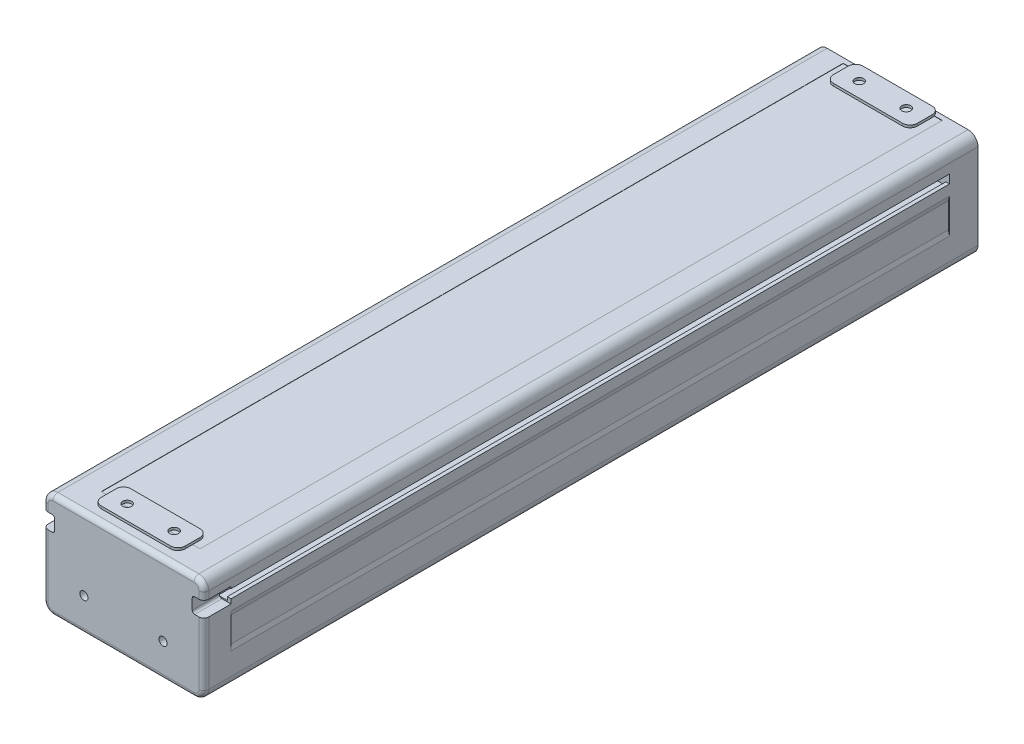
ISO-10303-21;
HEADER;
FILE_DESCRIPTION(('STEP AP214'),'2;1');
FILE_NAME('part.step','',(''),(''),'','','');
FILE_SCHEMA(('AUTOMOTIVE_DESIGN { 1 0 10303 214 1 1 1 1 }'));
ENDSEC;
DATA;
#1=APPLICATION_CONTEXT('core data for automotive mechanical design processes');
#2=APPLICATION_PROTOCOL_DEFINITION('international standard','automotive_design',2000,#1);
#3=PRODUCT_CONTEXT('',#1,'mechanical');
#4=PRODUCT('Part','Part','',(#3));
#5=PRODUCT_RELATED_PRODUCT_CATEGORY('part','',(#4));
#6=PRODUCT_DEFINITION_FORMATION('','',#4);
#7=PRODUCT_DEFINITION_CONTEXT('part definition',#1,'design');
#8=PRODUCT_DEFINITION('design','',#6,#7);
#9=PRODUCT_DEFINITION_SHAPE('','',#8);
#10=(LENGTH_UNIT() NAMED_UNIT(*) SI_UNIT(.MILLI.,.METRE.));
#11=(NAMED_UNIT(*) PLANE_ANGLE_UNIT() SI_UNIT($,.RADIAN.));
#12=(NAMED_UNIT(*) SI_UNIT($,.STERADIAN.) SOLID_ANGLE_UNIT());
#13=UNCERTAINTY_MEASURE_WITH_UNIT(LENGTH_MEASURE(1.E-05),#10,'distance_accuracy_value','');
#14=(GEOMETRIC_REPRESENTATION_CONTEXT(3) GLOBAL_UNCERTAINTY_ASSIGNED_CONTEXT((#13)) GLOBAL_UNIT_ASSIGNED_CONTEXT((#10,
#11,#12)) REPRESENTATION_CONTEXT('',''));
#15=CARTESIAN_POINT('',(0.,0.,0.));
#16=DIRECTION('',(0.,0.,1.));
#17=DIRECTION('',(1.,0.,0.));
#18=AXIS2_PLACEMENT_3D('',#15,#16,#17);
#19=CARTESIAN_POINT('',(-1.13858288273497E-13,43.9000000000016,-67.1611228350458));
#20=DIRECTION('',(0.,1.,0.));
#21=DIRECTION('',(0.,0.,1.));
#22=AXIS2_PLACEMENT_3D('',#19,#20,#21);
#23=PLANE('',#22);
#24=DIRECTION('',(0.,0.,1.));
#25=VECTOR('',#24,1.);
#26=CARTESIAN_POINT('',(-28.5,43.9000000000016,-67.1611228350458));
#27=LINE('',#26,#25);
#28=CARTESIAN_POINT('',(-28.5,43.9,-1.));
#29=VERTEX_POINT('',#28);
#30=CARTESIAN_POINT('',(-28.5,43.9000000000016,310.));
#31=VERTEX_POINT('',#30);
#32=EDGE_CURVE('E1760',#29,#31,#27,.T.);
#33=ORIENTED_EDGE('',*,*,#32,.T.);
#34=DIRECTION('',(-1.,0.,0.));
#35=VECTOR('',#34,1.);
#36=CARTESIAN_POINT('',(-1.13858288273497E-13,43.9000000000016,310.));
#37=LINE('',#36,#35);
#38=CARTESIAN_POINT('',(28.5,43.9000000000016,310.));
#39=VERTEX_POINT('',#38);
#40=EDGE_CURVE('E11',#31,#39,#37,.F.);
#41=ORIENTED_EDGE('',*,*,#40,.T.);
#42=DIRECTION('',(0.,0.,1.));
#43=VECTOR('',#42,1.);
#44=CARTESIAN_POINT('',(28.5,43.9000000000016,-67.1611228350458));
#45=LINE('',#44,#43);
#46=CARTESIAN_POINT('',(28.5,43.9,-1.));
#47=VERTEX_POINT('',#46);
#48=EDGE_CURVE('E1763',#47,#39,#45,.T.);
#49=ORIENTED_EDGE('',*,*,#48,.F.);
#50=DIRECTION('',(1.,0.,0.));
#51=VECTOR('',#50,1.);
#52=CARTESIAN_POINT('',(28.5,43.9,-1.));
#53=LINE('',#52,#51);
#54=CARTESIAN_POINT('',(14.,43.9,-1.));
#55=VERTEX_POINT('',#54);
#56=EDGE_CURVE('E945',#55,#47,#53,.T.);
#57=ORIENTED_EDGE('',*,*,#56,.F.);
#58=CARTESIAN_POINT('',(14.,43.9000000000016,2.));
#59=DIRECTION('',(0.,1.,0.));
#60=DIRECTION('',(0.,0.,1.));
#61=AXIS2_PLACEMENT_3D('',#58,#59,#60);
#62=CIRCLE('',#61,3.);
#63=CARTESIAN_POINT('',(16.8284271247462,43.9000000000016,1.));
#64=VERTEX_POINT('',#63);
#65=EDGE_CURVE('E1904',#55,#64,#62,.F.);
#66=ORIENTED_EDGE('',*,*,#65,.T.);
#67=DIRECTION('',(-1.,0.,0.));
#68=VECTOR('',#67,1.);
#69=CARTESIAN_POINT('',(-20.,43.9000000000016,1.));
#70=LINE('',#69,#68);
#71=CARTESIAN_POINT('',(20.,43.9000000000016,1.));
#72=VERTEX_POINT('',#71);
#73=EDGE_CURVE('E734',#72,#64,#70,.T.);
#74=ORIENTED_EDGE('',*,*,#73,.F.);
#75=DIRECTION('',(0.,0.,-1.));
#76=VECTOR('',#75,1.);
#77=CARTESIAN_POINT('',(20.,43.9000000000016,1.));
#78=LINE('',#77,#76);
#79=CARTESIAN_POINT('',(20.,43.9000000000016,301.));
#80=VERTEX_POINT('',#79);
#81=EDGE_CURVE('E757',#80,#72,#78,.T.);
#82=ORIENTED_EDGE('',*,*,#81,.F.);
#83=DIRECTION('',(1.,0.,0.));
#84=VECTOR('',#83,1.);
#85=CARTESIAN_POINT('',(-20.,43.9000000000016,301.));
#86=LINE('',#85,#84);
#87=CARTESIAN_POINT('',(17.,43.9000000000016,301.));
#88=VERTEX_POINT('',#87);
#89=EDGE_CURVE('E751',#88,#80,#86,.T.);
#90=ORIENTED_EDGE('',*,*,#89,.F.);
#91=DIRECTION('',(0.,0.,1.));
#92=VECTOR('',#91,1.);
#93=CARTESIAN_POINT('',(17.,43.9000000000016,-67.1611228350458));
#94=LINE('',#93,#92);
#95=CARTESIAN_POINT('',(17.,43.9000000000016,304.));
#96=VERTEX_POINT('',#95);
#97=EDGE_CURVE('E1814',#88,#96,#94,.T.);
#98=ORIENTED_EDGE('',*,*,#97,.T.);
#99=CARTESIAN_POINT('',(14.,43.9000000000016,304.));
#100=DIRECTION('',(0.,1.,0.));
#101=DIRECTION('',(0.,0.,1.));
#102=AXIS2_PLACEMENT_3D('',#99,#100,#101);
#103=CIRCLE('',#102,3.);
#104=CARTESIAN_POINT('',(14.,43.9000000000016,307.));
#105=VERTEX_POINT('',#104);
#106=EDGE_CURVE('E1921',#96,#105,#103,.F.);
#107=ORIENTED_EDGE('',*,*,#106,.T.);
#108=DIRECTION('',(1.,0.,0.));
#109=VECTOR('',#108,1.);
#110=CARTESIAN_POINT('',(-17.,43.9000000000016,307.));
#111=LINE('',#110,#109);
#112=CARTESIAN_POINT('',(-14.,43.9000000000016,307.));
#113=VERTEX_POINT('',#112);
#114=EDGE_CURVE('E1520',#113,#105,#111,.T.);
#115=ORIENTED_EDGE('',*,*,#114,.F.);
#116=CARTESIAN_POINT('',(-14.,43.9000000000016,304.));
#117=DIRECTION('',(0.,1.,0.));
#118=DIRECTION('',(0.,0.,1.));
#119=AXIS2_PLACEMENT_3D('',#116,#117,#118);
#120=CIRCLE('',#119,3.);
#121=CARTESIAN_POINT('',(-17.,43.9000000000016,304.));
#122=VERTEX_POINT('',#121);
#123=EDGE_CURVE('E1927',#113,#122,#120,.F.);
#124=ORIENTED_EDGE('',*,*,#123,.T.);
#125=DIRECTION('',(0.,0.,1.));
#126=VECTOR('',#125,1.);
#127=CARTESIAN_POINT('',(-17.,43.9000000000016,295.));
#128=LINE('',#127,#126);
#129=CARTESIAN_POINT('',(-17.,43.9000000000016,301.));
#130=VERTEX_POINT('',#129);
#131=EDGE_CURVE('E1493',#130,#122,#128,.T.);
#132=ORIENTED_EDGE('',*,*,#131,.F.);
#133=CARTESIAN_POINT('',(-20.,43.9000000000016,301.));
#134=VERTEX_POINT('',#133);
#135=EDGE_CURVE('E753',#134,#130,#86,.T.);
#136=ORIENTED_EDGE('',*,*,#135,.F.);
#137=DIRECTION('',(0.,0.,1.));
#138=VECTOR('',#137,1.);
#139=CARTESIAN_POINT('',(-20.,43.9000000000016,1.));
#140=LINE('',#139,#138);
#141=CARTESIAN_POINT('',(-20.,43.9000000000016,1.));
#142=VERTEX_POINT('',#141);
#143=EDGE_CURVE('E747',#142,#134,#140,.T.);
#144=ORIENTED_EDGE('',*,*,#143,.F.);
#145=CARTESIAN_POINT('',(-16.8284271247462,43.9000000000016,1.));
#146=VERTEX_POINT('',#145);
#147=EDGE_CURVE('E762',#146,#142,#70,.T.);
#148=ORIENTED_EDGE('',*,*,#147,.F.);
#149=CARTESIAN_POINT('',(-14.,43.9000000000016,2.));
#150=DIRECTION('',(0.,1.,0.));
#151=DIRECTION('',(0.,0.,1.));
#152=AXIS2_PLACEMENT_3D('',#149,#150,#151);
#153=CIRCLE('',#152,3.);
#154=CARTESIAN_POINT('',(-14.,43.9,-1.));
#155=VERTEX_POINT('',#154);
#156=EDGE_CURVE('E1911',#146,#155,#153,.F.);
#157=ORIENTED_EDGE('',*,*,#156,.T.);
#158=EDGE_CURVE('E941',#29,#155,#53,.T.);
#159=ORIENTED_EDGE('',*,*,#158,.F.);
#160=EDGE_LOOP('',(#33,#41,#49,#57,#66,#74,#82,#90,#98,#107,#115,#124,#132,#136,#144,#148,#157,#159));
#161=FACE_BOUND('',#160,.T.);
#162=ADVANCED_FACE('F43',(#161),#23,.T.);
#163=CARTESIAN_POINT('',(28.5,5.4,10.5));
#164=DIRECTION('',(0.,0.,-1.));
#165=DIRECTION('',(-1.,0.,0.));
#166=AXIS2_PLACEMENT_3D('',#163,#164,#165);
#167=PLANE('',#166);
#168=DIRECTION('',(-0.254493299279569,0.967074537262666,0.));
#169=VECTOR('',#168,1.);
#170=CARTESIAN_POINT('',(32.,16.3000000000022,10.5));
#171=LINE('',#170,#169);
#172=CARTESIAN_POINT('',(32.5,14.4000000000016,10.5));
#173=VERTEX_POINT('',#172);
#174=CARTESIAN_POINT('',(32.,16.3000000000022,10.5));
#175=VERTEX_POINT('',#174);
#176=EDGE_CURVE('E1710',#173,#175,#171,.T.);
#177=ORIENTED_EDGE('',*,*,#176,.F.);
#178=DIRECTION('',(0.,-1.,0.));
#179=VECTOR('',#178,1.);
#180=CARTESIAN_POINT('',(32.5,39.9,10.5));
#181=LINE('',#180,#179);
#182=CARTESIAN_POINT('',(32.5,28.4000000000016,10.5));
#183=VERTEX_POINT('',#182);
#184=EDGE_CURVE('E927',#183,#173,#181,.T.);
#185=ORIENTED_EDGE('',*,*,#184,.F.);
#186=DIRECTION('',(0.254493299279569,0.967074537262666,0.));
#187=VECTOR('',#186,1.);
#188=CARTESIAN_POINT('',(32.5,28.4000000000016,10.5));
#189=LINE('',#188,#187);
#190=CARTESIAN_POINT('',(32.,26.5000000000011,10.5));
#191=VERTEX_POINT('',#190);
#192=EDGE_CURVE('E1699',#191,#183,#189,.T.);
#193=ORIENTED_EDGE('',*,*,#192,.F.);
#194=DIRECTION('',(0.,1.,0.));
#195=VECTOR('',#194,1.);
#196=CARTESIAN_POINT('',(32.,26.5000000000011,10.5));
#197=LINE('',#196,#195);
#198=EDGE_CURVE('E1705',#175,#191,#197,.T.);
#199=ORIENTED_EDGE('',*,*,#198,.F.);
#200=EDGE_LOOP('',(#177,#185,#193,#199));
#201=FACE_BOUND('',#200,.T.);
#202=ADVANCED_FACE('F2169',(#201),#167,.F.);
#203=DIRECTION('',(-1.,0.,0.));
#204=VECTOR('',#203,1.);
#205=CARTESIAN_POINT('',(31.,32.6500000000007,10.5));
#206=LINE('',#205,#204);
#207=CARTESIAN_POINT('',(32.5,32.6500000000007,10.5));
#208=VERTEX_POINT('',#207);
#209=CARTESIAN_POINT('',(31.,32.6500000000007,10.5));
#210=VERTEX_POINT('',#209);
#211=EDGE_CURVE('E1694',#208,#210,#206,.T.);
#212=ORIENTED_EDGE('',*,*,#211,.F.);
#213=CARTESIAN_POINT('',(32.5,36.1500000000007,10.5));
#214=VERTEX_POINT('',#213);
#215=EDGE_CURVE('E931',#214,#208,#181,.T.);
#216=ORIENTED_EDGE('',*,*,#215,.F.);
#217=DIRECTION('',(1.,0.,0.));
#218=VECTOR('',#217,1.);
#219=CARTESIAN_POINT('',(32.5,36.1500000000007,10.5));
#220=LINE('',#219,#218);
#221=CARTESIAN_POINT('',(31.,36.1500000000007,10.5));
#222=VERTEX_POINT('',#221);
#223=EDGE_CURVE('E1663',#222,#214,#220,.T.);
#224=ORIENTED_EDGE('',*,*,#223,.F.);
#225=DIRECTION('',(0.,-1.,0.));
#226=VECTOR('',#225,1.);
#227=CARTESIAN_POINT('',(31.,36.1500000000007,10.5));
#228=LINE('',#227,#226);
#229=CARTESIAN_POINT('',(31.,37.5000000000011,10.5));
#230=VERTEX_POINT('',#229);
#231=EDGE_CURVE('E1669',#230,#222,#228,.T.);
#232=ORIENTED_EDGE('',*,*,#231,.F.);
#233=DIRECTION('',(1.,0.,0.));
#234=VECTOR('',#233,1.);
#235=CARTESIAN_POINT('',(31.,37.5000000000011,10.5));
#236=LINE('',#235,#234);
#237=CARTESIAN_POINT('',(27.3000000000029,37.5000000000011,10.5));
#238=VERTEX_POINT('',#237);
#239=EDGE_CURVE('E1674',#238,#230,#236,.T.);
#240=ORIENTED_EDGE('',*,*,#239,.F.);
#241=DIRECTION('',(0.,1.,0.));
#242=VECTOR('',#241,1.);
#243=CARTESIAN_POINT('',(27.3000000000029,37.5000000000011,10.5));
#244=LINE('',#243,#242);
#245=CARTESIAN_POINT('',(27.3000000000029,31.3000000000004,10.5));
#246=VERTEX_POINT('',#245);
#247=EDGE_CURVE('E1679',#246,#238,#244,.T.);
#248=ORIENTED_EDGE('',*,*,#247,.F.);
#249=DIRECTION('',(-1.,0.,0.));
#250=VECTOR('',#249,1.);
#251=CARTESIAN_POINT('',(27.3000000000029,31.3000000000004,10.5));
#252=LINE('',#251,#250);
#253=CARTESIAN_POINT('',(31.,31.3000000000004,10.5));
#254=VERTEX_POINT('',#253);
#255=EDGE_CURVE('E1684',#254,#246,#252,.T.);
#256=ORIENTED_EDGE('',*,*,#255,.F.);
#257=DIRECTION('',(0.,-1.,0.));
#258=VECTOR('',#257,1.);
#259=CARTESIAN_POINT('',(31.,31.3000000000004,10.5));
#260=LINE('',#259,#258);
#261=EDGE_CURVE('E1689',#210,#254,#260,.T.);
#262=ORIENTED_EDGE('',*,*,#261,.F.);
#263=EDGE_LOOP('',(#212,#216,#224,#232,#240,#248,#256,#262));
#264=FACE_BOUND('',#263,.T.);
#265=ADVANCED_FACE('F2173',(#264),#167,.F.);
#266=DIRECTION('',(1.,0.,0.));
#267=VECTOR('',#266,1.);
#268=CARTESIAN_POINT('',(-32.5,36.1500000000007,10.5));
#269=LINE('',#268,#267);
#270=CARTESIAN_POINT('',(-32.5,36.1500000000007,10.5));
#271=VERTEX_POINT('',#270);
#272=CARTESIAN_POINT('',(-31.,36.1500000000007,10.5));
#273=VERTEX_POINT('',#272);
#274=EDGE_CURVE('E1658',#271,#273,#269,.T.);
#275=ORIENTED_EDGE('',*,*,#274,.F.);
#276=DIRECTION('',(0.,1.,0.));
#277=VECTOR('',#276,1.);
#278=CARTESIAN_POINT('',(-32.5,39.9,10.5));
#279=LINE('',#278,#277);
#280=CARTESIAN_POINT('',(-32.5,32.6500000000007,10.5));
#281=VERTEX_POINT('',#280);
#282=EDGE_CURVE('E926',#281,#271,#279,.T.);
#283=ORIENTED_EDGE('',*,*,#282,.F.);
#284=DIRECTION('',(-1.,0.,0.));
#285=VECTOR('',#284,1.);
#286=CARTESIAN_POINT('',(-31.,32.6500000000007,10.5));
#287=LINE('',#286,#285);
#288=CARTESIAN_POINT('',(-31.,32.6500000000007,10.5));
#289=VERTEX_POINT('',#288);
#290=EDGE_CURVE('E1627',#289,#281,#287,.T.);
#291=ORIENTED_EDGE('',*,*,#290,.F.);
#292=DIRECTION('',(0.,1.,0.));
#293=VECTOR('',#292,1.);
#294=CARTESIAN_POINT('',(-31.,31.3000000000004,10.5));
#295=LINE('',#294,#293);
#296=CARTESIAN_POINT('',(-31.,31.3000000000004,10.5));
#297=VERTEX_POINT('',#296);
#298=EDGE_CURVE('E1633',#297,#289,#295,.T.);
#299=ORIENTED_EDGE('',*,*,#298,.F.);
#300=DIRECTION('',(-1.,0.,0.));
#301=VECTOR('',#300,1.);
#302=CARTESIAN_POINT('',(-27.3000000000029,31.3000000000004,10.5));
#303=LINE('',#302,#301);
#304=CARTESIAN_POINT('',(-27.3000000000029,31.3000000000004,10.5));
#305=VERTEX_POINT('',#304);
#306=EDGE_CURVE('E1638',#305,#297,#303,.T.);
#307=ORIENTED_EDGE('',*,*,#306,.F.);
#308=DIRECTION('',(0.,-1.,0.));
#309=VECTOR('',#308,1.);
#310=CARTESIAN_POINT('',(-27.3000000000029,37.5000000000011,10.5));
#311=LINE('',#310,#309);
#312=CARTESIAN_POINT('',(-27.3000000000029,37.5000000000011,10.5));
#313=VERTEX_POINT('',#312);
#314=EDGE_CURVE('E1643',#313,#305,#311,.T.);
#315=ORIENTED_EDGE('',*,*,#314,.F.);
#316=DIRECTION('',(1.,0.,0.));
#317=VECTOR('',#316,1.);
#318=CARTESIAN_POINT('',(-31.,37.5000000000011,10.5));
#319=LINE('',#318,#317);
#320=CARTESIAN_POINT('',(-31.,37.5000000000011,10.5));
#321=VERTEX_POINT('',#320);
#322=EDGE_CURVE('E1648',#321,#313,#319,.T.);
#323=ORIENTED_EDGE('',*,*,#322,.F.);
#324=DIRECTION('',(0.,1.,0.));
#325=VECTOR('',#324,1.);
#326=CARTESIAN_POINT('',(-31.,36.1500000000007,10.5));
#327=LINE('',#326,#325);
#328=EDGE_CURVE('E1653',#273,#321,#327,.T.);
#329=ORIENTED_EDGE('',*,*,#328,.F.);
#330=EDGE_LOOP('',(#275,#283,#291,#299,#307,#315,#323,#329));
#331=FACE_BOUND('',#330,.T.);
#332=ADVANCED_FACE('F2368',(#331),#167,.F.);
#333=CARTESIAN_POINT('',(0.,0.,301.));
#334=DIRECTION('',(0.,0.,1.));
#335=DIRECTION('',(1.,0.,0.));
#336=AXIS2_PLACEMENT_3D('',#333,#334,#335);
#337=PLANE('',#336);
#338=DIRECTION('',(-0.254493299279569,0.967074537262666,0.));
#339=VECTOR('',#338,1.);
#340=CARTESIAN_POINT('',(32.,16.3000000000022,301.));
#341=LINE('',#340,#339);
#342=CARTESIAN_POINT('',(32.5,14.4000000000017,301.));
#343=VERTEX_POINT('',#342);
#344=CARTESIAN_POINT('',(32.,16.3000000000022,301.));
#345=VERTEX_POINT('',#344);
#346=EDGE_CURVE('E1515',#343,#345,#341,.T.);
#347=ORIENTED_EDGE('',*,*,#346,.T.);
#348=DIRECTION('',(0.,1.,0.));
#349=VECTOR('',#348,1.);
#350=CARTESIAN_POINT('',(32.,26.5000000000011,301.));
#351=LINE('',#350,#349);
#352=CARTESIAN_POINT('',(32.,26.5000000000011,301.));
#353=VERTEX_POINT('',#352);
#354=EDGE_CURVE('E1606',#345,#353,#351,.T.);
#355=ORIENTED_EDGE('',*,*,#354,.T.);
#356=DIRECTION('',(0.254493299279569,0.967074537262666,0.));
#357=VECTOR('',#356,1.);
#358=CARTESIAN_POINT('',(32.5,28.4000000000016,301.));
#359=LINE('',#358,#357);
#360=CARTESIAN_POINT('',(32.5,28.4000000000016,301.));
#361=VERTEX_POINT('',#360);
#362=EDGE_CURVE('E1603',#353,#361,#359,.T.);
#363=ORIENTED_EDGE('',*,*,#362,.T.);
#364=DIRECTION('',(0.,1.,0.));
#365=VECTOR('',#364,1.);
#366=CARTESIAN_POINT('',(32.5,30.8,301.));
#367=LINE('',#366,#365);
#368=EDGE_CURVE('E991',#343,#361,#367,.T.);
#369=ORIENTED_EDGE('',*,*,#368,.F.);
#370=EDGE_LOOP('',(#347,#355,#363,#369));
#371=FACE_BOUND('',#370,.T.);
#372=ADVANCED_FACE('F3308',(#371),#337,.F.);
#373=DIRECTION('',(1.,0.,0.));
#374=VECTOR('',#373,1.);
#375=CARTESIAN_POINT('',(27.3000000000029,31.3000000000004,301.));
#376=LINE('',#375,#374);
#377=CARTESIAN_POINT('',(27.3000000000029,31.3000000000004,301.));
#378=VERTEX_POINT('',#377);
#379=CARTESIAN_POINT('',(27.9339745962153,31.3000000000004,301.));
#380=VERTEX_POINT('',#379);
#381=EDGE_CURVE('E1480',#378,#380,#376,.T.);
#382=ORIENTED_EDGE('',*,*,#381,.F.);
#383=DIRECTION('',(0.,1.,0.));
#384=VECTOR('',#383,1.);
#385=CARTESIAN_POINT('',(27.3000000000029,37.5000000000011,301.));
#386=LINE('',#385,#384);
#387=CARTESIAN_POINT('',(27.3000000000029,37.5000000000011,301.));
#388=VERTEX_POINT('',#387);
#389=EDGE_CURVE('E1585',#378,#388,#386,.T.);
#390=ORIENTED_EDGE('',*,*,#389,.T.);
#391=DIRECTION('',(1.,0.,0.));
#392=VECTOR('',#391,1.);
#393=CARTESIAN_POINT('',(31.,37.5000000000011,301.));
#394=LINE('',#393,#392);
#395=CARTESIAN_POINT('',(31.,37.5000000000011,301.));
#396=VERTEX_POINT('',#395);
#397=EDGE_CURVE('E1582',#388,#396,#394,.T.);
#398=ORIENTED_EDGE('',*,*,#397,.T.);
#399=DIRECTION('',(0.,-1.,0.));
#400=VECTOR('',#399,1.);
#401=CARTESIAN_POINT('',(31.,36.1500000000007,301.));
#402=LINE('',#401,#400);
#403=CARTESIAN_POINT('',(31.,37.,301.));
#404=VERTEX_POINT('',#403);
#405=EDGE_CURVE('E1578',#396,#404,#402,.T.);
#406=ORIENTED_EDGE('',*,*,#405,.T.);
#407=DIRECTION('',(1.,0.,0.));
#408=VECTOR('',#407,1.);
#409=CARTESIAN_POINT('',(32.5,37.,301.));
#410=LINE('',#409,#408);
#411=CARTESIAN_POINT('',(28.8,37.,301.));
#412=VERTEX_POINT('',#411);
#413=EDGE_CURVE('E977',#412,#404,#410,.T.);
#414=ORIENTED_EDGE('',*,*,#413,.F.);
#415=CARTESIAN_POINT('',(28.8,36.,301.));
#416=DIRECTION('',(0.,0.,1.));
#417=DIRECTION('',(1.,0.,0.));
#418=AXIS2_PLACEMENT_3D('',#415,#416,#417);
#419=CIRCLE('',#418,1.);
#420=CARTESIAN_POINT('',(27.8,36.,301.));
#421=VERTEX_POINT('',#420);
#422=EDGE_CURVE('E1416',#412,#421,#419,.T.);
#423=ORIENTED_EDGE('',*,*,#422,.T.);
#424=DIRECTION('',(0.,1.,0.));
#425=VECTOR('',#424,1.);
#426=CARTESIAN_POINT('',(27.8,37.,301.));
#427=LINE('',#426,#425);
#428=CARTESIAN_POINT('',(27.8,31.8,301.));
#429=VERTEX_POINT('',#428);
#430=EDGE_CURVE('E983',#429,#421,#427,.T.);
#431=ORIENTED_EDGE('',*,*,#430,.F.);
#432=CARTESIAN_POINT('',(28.8,31.8,301.));
#433=DIRECTION('',(0.,0.,1.));
#434=DIRECTION('',(1.,0.,0.));
#435=AXIS2_PLACEMENT_3D('',#432,#433,#434);
#436=CIRCLE('',#435,1.);
#437=EDGE_CURVE('E1409',#429,#380,#436,.T.);
#438=ORIENTED_EDGE('',*,*,#437,.T.);
#439=EDGE_LOOP('',(#382,#390,#398,#406,#414,#423,#431,#438));
#440=FACE_BOUND('',#439,.T.);
#441=ADVANCED_FACE('F2245',(#440),#337,.F.);
#442=DIRECTION('',(0.,-1.,0.));
#443=VECTOR('',#442,1.);
#444=CARTESIAN_POINT('',(-31.,36.1500000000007,301.));
#445=LINE('',#444,#443);
#446=CARTESIAN_POINT('',(-31.,37.5000000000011,301.));
#447=VERTEX_POINT('',#446);
#448=CARTESIAN_POINT('',(-31.,37.,301.));
#449=VERTEX_POINT('',#448);
#450=EDGE_CURVE('E1470',#447,#449,#445,.T.);
#451=ORIENTED_EDGE('',*,*,#450,.F.);
#452=DIRECTION('',(1.,0.,0.));
#453=VECTOR('',#452,1.);
#454=CARTESIAN_POINT('',(-31.,37.5000000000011,301.));
#455=LINE('',#454,#453);
#456=CARTESIAN_POINT('',(-27.3000000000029,37.5000000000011,301.));
#457=VERTEX_POINT('',#456);
#458=EDGE_CURVE('E1556',#447,#457,#455,.T.);
#459=ORIENTED_EDGE('',*,*,#458,.T.);
#460=DIRECTION('',(0.,-1.,0.));
#461=VECTOR('',#460,1.);
#462=CARTESIAN_POINT('',(-27.3000000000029,37.5000000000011,301.));
#463=LINE('',#462,#461);
#464=CARTESIAN_POINT('',(-27.3000000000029,31.3000000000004,301.));
#465=VERTEX_POINT('',#464);
#466=EDGE_CURVE('E1553',#457,#465,#463,.T.);
#467=ORIENTED_EDGE('',*,*,#466,.T.);
#468=DIRECTION('',(-1.,0.,0.));
#469=VECTOR('',#468,1.);
#470=CARTESIAN_POINT('',(-27.3000000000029,31.3000000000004,301.));
#471=LINE('',#470,#469);
#472=CARTESIAN_POINT('',(-27.9339745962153,31.3000000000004,301.));
#473=VERTEX_POINT('',#472);
#474=EDGE_CURVE('E1549',#465,#473,#471,.T.);
#475=ORIENTED_EDGE('',*,*,#474,.T.);
#476=CARTESIAN_POINT('',(-28.8,31.8,301.));
#477=DIRECTION('',(0.,0.,1.));
#478=DIRECTION('',(1.,0.,0.));
#479=AXIS2_PLACEMENT_3D('',#476,#477,#478);
#480=CIRCLE('',#479,1.);
#481=CARTESIAN_POINT('',(-27.8,31.8,301.));
#482=VERTEX_POINT('',#481);
#483=EDGE_CURVE('E1422',#473,#482,#480,.T.);
#484=ORIENTED_EDGE('',*,*,#483,.T.);
#485=DIRECTION('',(0.,-1.,0.));
#486=VECTOR('',#485,1.);
#487=CARTESIAN_POINT('',(-27.8,37.,301.));
#488=LINE('',#487,#486);
#489=CARTESIAN_POINT('',(-27.8,36.,301.));
#490=VERTEX_POINT('',#489);
#491=EDGE_CURVE('E1004',#490,#482,#488,.T.);
#492=ORIENTED_EDGE('',*,*,#491,.F.);
#493=CARTESIAN_POINT('',(-28.8,36.,301.));
#494=DIRECTION('',(0.,0.,1.));
#495=DIRECTION('',(1.,0.,0.));
#496=AXIS2_PLACEMENT_3D('',#493,#494,#495);
#497=CIRCLE('',#496,1.);
#498=CARTESIAN_POINT('',(-28.8,37.,301.));
#499=VERTEX_POINT('',#498);
#500=EDGE_CURVE('E1430',#490,#499,#497,.T.);
#501=ORIENTED_EDGE('',*,*,#500,.T.);
#502=DIRECTION('',(1.,0.,0.));
#503=VECTOR('',#502,1.);
#504=CARTESIAN_POINT('',(-32.5,37.,301.));
#505=LINE('',#504,#503);
#506=EDGE_CURVE('E1012',#449,#499,#505,.T.);
#507=ORIENTED_EDGE('',*,*,#506,.F.);
#508=EDGE_LOOP('',(#451,#459,#467,#475,#484,#492,#501,#507));
#509=FACE_BOUND('',#508,.T.);
#510=ADVANCED_FACE('F2349',(#509),#337,.F.);
#511=CARTESIAN_POINT('',(-21.0000000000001,1.57538738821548E-12,302.));
#512=DIRECTION('',(1.,0.,0.));
#513=DIRECTION('',(0.,1.,0.));
#514=AXIS2_PLACEMENT_3D('',#511,#512,#513);
#515=PLANE('',#514);
#516=DIRECTION('',(0.,0.,1.));
#517=VECTOR('',#516,1.);
#518=CARTESIAN_POINT('',(-21.,1.40000000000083,-67.1611228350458));
#519=LINE('',#518,#517);
#520=CARTESIAN_POINT('',(-21.,1.4,0.));
#521=VERTEX_POINT('',#520);
#522=CARTESIAN_POINT('',(-21.,1.4,302.));
#523=VERTEX_POINT('',#522);
#524=EDGE_CURVE('E1818',#521,#523,#519,.T.);
#525=ORIENTED_EDGE('',*,*,#524,.F.);
#526=DIRECTION('',(0.,-1.,0.));
#527=VECTOR('',#526,1.);
#528=CARTESIAN_POINT('',(-21.0000000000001,1.57538738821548E-12,0.));
#529=LINE('',#528,#527);
#530=CARTESIAN_POINT('',(-21.,0.81568542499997,0.));
#531=VERTEX_POINT('',#530);
#532=EDGE_CURVE('E1287',#521,#531,#529,.T.);
#533=ORIENTED_EDGE('',*,*,#532,.T.);
#534=DIRECTION('',(0.,0.,-1.));
#535=VECTOR('',#534,1.);
#536=CARTESIAN_POINT('',(-21.,0.81568542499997,302.));
#537=LINE('',#536,#535);
#538=CARTESIAN_POINT('',(-21.,0.81568542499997,302.));
#539=VERTEX_POINT('',#538);
#540=EDGE_CURVE('E1353',#539,#531,#537,.T.);
#541=ORIENTED_EDGE('',*,*,#540,.F.);
#542=DIRECTION('',(0.,-1.,0.));
#543=VECTOR('',#542,1.);
#544=CARTESIAN_POINT('',(-21.0000000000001,1.57538738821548E-12,302.));
#545=LINE('',#544,#543);
#546=EDGE_CURVE('E1257',#523,#539,#545,.T.);
#547=ORIENTED_EDGE('',*,*,#546,.F.);
#548=EDGE_LOOP('',(#525,#533,#541,#547));
#549=FACE_BOUND('',#548,.T.);
#550=ADVANCED_FACE('F3689',(#549),#515,.F.);
#551=CARTESIAN_POINT('',(20.9999999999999,-2.39337699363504E-12,302.));
#552=DIRECTION('',(-1.,1.13970333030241E-13,0.));
#553=DIRECTION('',(-1.13970333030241E-13,-1.,0.));
#554=AXIS2_PLACEMENT_3D('',#551,#552,#553);
#555=PLANE('',#554);
#556=DIRECTION('',(0.,0.,-1.));
#557=VECTOR('',#556,1.);
#558=CARTESIAN_POINT('',(21.0000000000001,1.40000000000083,-67.1611228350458));
#559=LINE('',#558,#557);
#560=CARTESIAN_POINT('',(21.,1.4,302.));
#561=VERTEX_POINT('',#560);
#562=CARTESIAN_POINT('',(21.0000000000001,1.4,0.));
#563=VERTEX_POINT('',#562);
#564=EDGE_CURVE('E1821',#561,#563,#559,.T.);
#565=ORIENTED_EDGE('',*,*,#564,.F.);
#566=DIRECTION('',(1.13970333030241E-13,1.,0.));
#567=VECTOR('',#566,1.);
#568=CARTESIAN_POINT('',(20.9999999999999,-2.39337699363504E-12,302.));
#569=LINE('',#568,#567);
#570=CARTESIAN_POINT('',(21.,0.815685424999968,302.));
#571=VERTEX_POINT('',#570);
#572=EDGE_CURVE('E1282',#571,#561,#569,.T.);
#573=ORIENTED_EDGE('',*,*,#572,.F.);
#574=DIRECTION('',(0.,0.,-1.));
#575=VECTOR('',#574,1.);
#576=CARTESIAN_POINT('',(21.,0.815685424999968,302.));
#577=LINE('',#576,#575);
#578=CARTESIAN_POINT('',(21.,0.815685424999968,0.));
#579=VERTEX_POINT('',#578);
#580=EDGE_CURVE('E1286',#571,#579,#577,.T.);
#581=ORIENTED_EDGE('',*,*,#580,.T.);
#582=DIRECTION('',(1.13970333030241E-13,1.,0.));
#583=VECTOR('',#582,1.);
#584=CARTESIAN_POINT('',(20.9999999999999,-2.39337699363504E-12,0.));
#585=LINE('',#584,#583);
#586=EDGE_CURVE('E1261',#579,#563,#585,.T.);
#587=ORIENTED_EDGE('',*,*,#586,.T.);
#588=EDGE_LOOP('',(#565,#573,#581,#587));
#589=FACE_BOUND('',#588,.T.);
#590=ADVANCED_FACE('F3681',(#589),#555,.F.);
#591=CARTESIAN_POINT('',(0.,0.,0.));
#592=DIRECTION('',(0.,0.,1.));
#593=DIRECTION('',(1.,0.,0.));
#594=AXIS2_PLACEMENT_3D('',#591,#592,#593);
#595=PLANE('',#594);
#596=DIRECTION('',(0.707106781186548,-0.707106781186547,0.));
#597=VECTOR('',#596,1.);
#598=CARTESIAN_POINT('',(4.5,4.5,0.));
#599=LINE('',#598,#597);
#600=CARTESIAN_POINT('',(8.5,0.5,0.));
#601=VERTEX_POINT('',#600);
#602=CARTESIAN_POINT('',(9.,0.,0.));
#603=VERTEX_POINT('',#602);
#604=EDGE_CURVE('E1305',#601,#603,#599,.T.);
#605=ORIENTED_EDGE('',*,*,#604,.F.);
#606=DIRECTION('',(1.,0.,0.));
#607=VECTOR('',#606,1.);
#608=CARTESIAN_POINT('',(0.,0.5,0.));
#609=LINE('',#608,#607);
#610=CARTESIAN_POINT('',(-8.5,0.5,0.));
#611=VERTEX_POINT('',#610);
#612=EDGE_CURVE('E1301',#611,#601,#609,.T.);
#613=ORIENTED_EDGE('',*,*,#612,.F.);
#614=DIRECTION('',(0.707106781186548,0.707106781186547,0.));
#615=VECTOR('',#614,1.);
#616=CARTESIAN_POINT('',(-4.5,4.5,0.));
#617=LINE('',#616,#615);
#618=CARTESIAN_POINT('',(-9.,0.,0.));
#619=VERTEX_POINT('',#618);
#620=EDGE_CURVE('E1297',#619,#611,#617,.T.);
#621=ORIENTED_EDGE('',*,*,#620,.F.);
#622=DIRECTION('',(1.,0.,0.));
#623=VECTOR('',#622,1.);
#624=CARTESIAN_POINT('',(0.,0.,0.));
#625=LINE('',#624,#623);
#626=CARTESIAN_POINT('',(-20.1843145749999,0.,0.));
#627=VERTEX_POINT('',#626);
#628=EDGE_CURVE('E1293',#627,#619,#625,.T.);
#629=ORIENTED_EDGE('',*,*,#628,.F.);
#630=DIRECTION('',(0.707106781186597,-0.707106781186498,0.));
#631=VECTOR('',#630,1.);
#632=CARTESIAN_POINT('',(-10.0921572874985,-10.0921572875,0.));
#633=LINE('',#632,#631);
#634=EDGE_CURVE('E1290',#531,#627,#633,.T.);
#635=ORIENTED_EDGE('',*,*,#634,.F.);
#636=ORIENTED_EDGE('',*,*,#532,.F.);
#637=DIRECTION('',(0.,-1.,0.));
#638=VECTOR('',#637,1.);
#639=CARTESIAN_POINT('',(-21.,9.5,0.));
#640=LINE('',#639,#638);
#641=CARTESIAN_POINT('',(-21.,9.5,0.));
#642=VERTEX_POINT('',#641);
#643=EDGE_CURVE('E911',#642,#521,#640,.T.);
#644=ORIENTED_EDGE('',*,*,#643,.F.);
#645=DIRECTION('',(-1.,0.,0.));
#646=VECTOR('',#645,1.);
#647=CARTESIAN_POINT('',(-21.,9.5,0.));
#648=LINE('',#647,#646);
#649=CARTESIAN_POINT('',(21.0000000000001,9.5,0.));
#650=VERTEX_POINT('',#649);
#651=EDGE_CURVE('E906',#650,#642,#648,.T.);
#652=ORIENTED_EDGE('',*,*,#651,.F.);
#653=DIRECTION('',(0.,-1.,0.));
#654=VECTOR('',#653,1.);
#655=CARTESIAN_POINT('',(21.0000000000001,9.5,0.));
#656=LINE('',#655,#654);
#657=EDGE_CURVE('E910',#650,#563,#656,.T.);
#658=ORIENTED_EDGE('',*,*,#657,.T.);
#659=ORIENTED_EDGE('',*,*,#586,.F.);
#660=DIRECTION('',(0.7071067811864,0.707106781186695,0.));
#661=VECTOR('',#660,1.);
#662=CARTESIAN_POINT('',(10.0921572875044,-10.0921572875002,0.));
#663=LINE('',#662,#661);
#664=CARTESIAN_POINT('',(20.1843145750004,0.,0.));
#665=VERTEX_POINT('',#664);
#666=EDGE_CURVE('E1312',#665,#579,#663,.T.);
#667=ORIENTED_EDGE('',*,*,#666,.F.);
#668=DIRECTION('',(1.,0.,0.));
#669=VECTOR('',#668,1.);
#670=CARTESIAN_POINT('',(0.,0.,0.));
#671=LINE('',#670,#669);
#672=EDGE_CURVE('E1309',#603,#665,#671,.T.);
#673=ORIENTED_EDGE('',*,*,#672,.F.);
#674=EDGE_LOOP('',(#605,#613,#621,#629,#635,#636,#644,#652,#658,#659,#667,#673));
#675=FACE_BOUND('',#674,.T.);
#676=ADVANCED_FACE('F2117',(#675),#595,.F.);
#677=CARTESIAN_POINT('',(-11.5,0.,5.));
#678=DIRECTION('',(0.,-1.,0.));
#679=DIRECTION('',(0.,0.,-1.));
#680=AXIS2_PLACEMENT_3D('',#677,#678,#679);
#681=CYLINDRICAL_SURFACE('',#680,4.);
#682=CARTESIAN_POINT('',(-11.5,0.,5.));
#683=DIRECTION('',(0.,-1.,0.));
#684=DIRECTION('',(0.,0.,-1.));
#685=AXIS2_PLACEMENT_3D('',#682,#683,#684);
#686=CIRCLE('',#685,4.);
#687=CARTESIAN_POINT('',(-9.,0.,8.1224989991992));
#688=VERTEX_POINT('',#687);
#689=CARTESIAN_POINT('',(-9.,0.,1.8775010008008));
#690=VERTEX_POINT('',#689);
#691=EDGE_CURVE('E1249',#688,#690,#686,.T.);
#692=ORIENTED_EDGE('',*,*,#691,.T.);
#693=CARTESIAN_POINT('',(-11.5,-2.5,5.));
#694=DIRECTION('',(-0.707106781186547,0.707106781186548,0.));
#695=DIRECTION('',(-0.707106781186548,-0.707106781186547,0.));
#696=AXIS2_PLACEMENT_3D('',#693,#694,#695);
#697=ELLIPSE('',#696,5.65685424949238,4.);
#698=CARTESIAN_POINT('',(-8.5,0.5,2.35424868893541));
#699=VERTEX_POINT('',#698);
#700=EDGE_CURVE('E1252',#699,#690,#697,.T.);
#701=ORIENTED_EDGE('',*,*,#700,.F.);
#702=CARTESIAN_POINT('',(-11.5,0.5,5.));
#703=DIRECTION('',(0.,1.,0.));
#704=DIRECTION('',(0.,0.,1.));
#705=AXIS2_PLACEMENT_3D('',#702,#703,#704);
#706=CIRCLE('',#705,4.);
#707=CARTESIAN_POINT('',(-8.5,0.5,7.64575131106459));
#708=VERTEX_POINT('',#707);
#709=EDGE_CURVE('E1357',#708,#699,#706,.T.);
#710=ORIENTED_EDGE('',*,*,#709,.F.);
#711=EDGE_CURVE('E1256',#688,#708,#697,.T.);
#712=ORIENTED_EDGE('',*,*,#711,.F.);
#713=EDGE_LOOP('',(#692,#701,#710,#712));
#714=FACE_BOUND('',#713,.T.);
#715=CARTESIAN_POINT('',(-11.5,1.4,5.));
#716=DIRECTION('',(0.,1.,0.));
#717=DIRECTION('',(0.,0.,1.));
#718=AXIS2_PLACEMENT_3D('',#715,#716,#717);
#719=CIRCLE('',#718,4.);
#720=CARTESIAN_POINT('',(-11.5,1.4,9.));
#721=VERTEX_POINT('',#720);
#722=EDGE_CURVE('E971',#721,#721,#719,.F.);
#723=ORIENTED_EDGE('',*,*,#722,.F.);
#724=EDGE_LOOP('',(#723));
#725=FACE_BOUND('',#724,.T.);
#726=ADVANCED_FACE('F3664',(#714,#725),#681,.F.);
#727=CARTESIAN_POINT('',(11.5,0.,5.));
#728=DIRECTION('',(0.,-1.,0.));
#729=DIRECTION('',(0.,0.,-1.));
#730=AXIS2_PLACEMENT_3D('',#727,#728,#729);
#731=CYLINDRICAL_SURFACE('',#730,4.);
#732=CARTESIAN_POINT('',(11.5,0.,5.));
#733=DIRECTION('',(0.,-1.,0.));
#734=DIRECTION('',(0.,0.,-1.));
#735=AXIS2_PLACEMENT_3D('',#732,#733,#734);
#736=CIRCLE('',#735,4.);
#737=CARTESIAN_POINT('',(9.,0.,1.8775010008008));
#738=VERTEX_POINT('',#737);
#739=CARTESIAN_POINT('',(9.,0.,8.1224989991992));
#740=VERTEX_POINT('',#739);
#741=EDGE_CURVE('E1241',#738,#740,#736,.T.);
#742=ORIENTED_EDGE('',*,*,#741,.T.);
#743=CARTESIAN_POINT('',(11.5,-2.5,5.));
#744=DIRECTION('',(0.707106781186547,0.707106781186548,0.));
#745=DIRECTION('',(0.707106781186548,-0.707106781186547,0.));
#746=AXIS2_PLACEMENT_3D('',#743,#744,#745);
#747=ELLIPSE('',#746,5.65685424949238,4.);
#748=CARTESIAN_POINT('',(8.5,0.5,7.6457513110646));
#749=VERTEX_POINT('',#748);
#750=EDGE_CURVE('E1361',#749,#740,#747,.T.);
#751=ORIENTED_EDGE('',*,*,#750,.F.);
#752=CARTESIAN_POINT('',(11.5,0.5,5.));
#753=DIRECTION('',(0.,1.,0.));
#754=DIRECTION('',(0.,0.,1.));
#755=AXIS2_PLACEMENT_3D('',#752,#753,#754);
#756=CIRCLE('',#755,4.);
#757=CARTESIAN_POINT('',(8.5,0.5,2.35424868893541));
#758=VERTEX_POINT('',#757);
#759=EDGE_CURVE('E1245',#758,#749,#756,.T.);
#760=ORIENTED_EDGE('',*,*,#759,.F.);
#761=EDGE_CURVE('E1220',#738,#758,#747,.T.);
#762=ORIENTED_EDGE('',*,*,#761,.F.);
#763=EDGE_LOOP('',(#742,#751,#760,#762));
#764=FACE_BOUND('',#763,.T.);
#765=CARTESIAN_POINT('',(11.5,1.4,5.));
#766=DIRECTION('',(0.,1.,0.));
#767=DIRECTION('',(0.,0.,1.));
#768=AXIS2_PLACEMENT_3D('',#765,#766,#767);
#769=CIRCLE('',#768,4.);
#770=CARTESIAN_POINT('',(11.5,1.4,9.));
#771=VERTEX_POINT('',#770);
#772=EDGE_CURVE('E976',#771,#771,#769,.F.);
#773=ORIENTED_EDGE('',*,*,#772,.F.);
#774=EDGE_LOOP('',(#773));
#775=FACE_BOUND('',#774,.T.);
#776=ADVANCED_FACE('F3655',(#764,#775),#731,.F.);
#777=CARTESIAN_POINT('',(0.,0.,302.));
#778=DIRECTION('',(0.,0.,1.));
#779=DIRECTION('',(1.,0.,0.));
#780=AXIS2_PLACEMENT_3D('',#777,#778,#779);
#781=PLANE('',#780);
#782=DIRECTION('',(1.,0.,0.));
#783=VECTOR('',#782,1.);
#784=CARTESIAN_POINT('',(0.,0.5,302.));
#785=LINE('',#784,#783);
#786=CARTESIAN_POINT('',(-8.5,0.5,302.));
#787=VERTEX_POINT('',#786);
#788=CARTESIAN_POINT('',(8.5,0.5,302.));
#789=VERTEX_POINT('',#788);
#790=EDGE_CURVE('E1270',#787,#789,#785,.T.);
#791=ORIENTED_EDGE('',*,*,#790,.T.);
#792=DIRECTION('',(0.707106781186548,-0.707106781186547,0.));
#793=VECTOR('',#792,1.);
#794=CARTESIAN_POINT('',(4.5,4.5,302.));
#795=LINE('',#794,#793);
#796=CARTESIAN_POINT('',(9.,0.,302.));
#797=VERTEX_POINT('',#796);
#798=EDGE_CURVE('E1273',#789,#797,#795,.T.);
#799=ORIENTED_EDGE('',*,*,#798,.T.);
#800=DIRECTION('',(1.,0.,0.));
#801=VECTOR('',#800,1.);
#802=CARTESIAN_POINT('',(0.,0.,302.));
#803=LINE('',#802,#801);
#804=CARTESIAN_POINT('',(20.1843145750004,0.,302.));
#805=VERTEX_POINT('',#804);
#806=EDGE_CURVE('E1276',#797,#805,#803,.T.);
#807=ORIENTED_EDGE('',*,*,#806,.T.);
#808=DIRECTION('',(0.7071067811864,0.707106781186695,0.));
#809=VECTOR('',#808,1.);
#810=CARTESIAN_POINT('',(10.0921572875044,-10.0921572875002,302.));
#811=LINE('',#810,#809);
#812=EDGE_CURVE('E1279',#805,#571,#811,.T.);
#813=ORIENTED_EDGE('',*,*,#812,.T.);
#814=ORIENTED_EDGE('',*,*,#572,.T.);
#815=DIRECTION('',(0.,-1.,0.));
#816=VECTOR('',#815,1.);
#817=CARTESIAN_POINT('',(21.,9.5,302.));
#818=LINE('',#817,#816);
#819=CARTESIAN_POINT('',(21.,9.5,302.));
#820=VERTEX_POINT('',#819);
#821=EDGE_CURVE('E878',#820,#561,#818,.T.);
#822=ORIENTED_EDGE('',*,*,#821,.F.);
#823=DIRECTION('',(1.,0.,0.));
#824=VECTOR('',#823,1.);
#825=CARTESIAN_POINT('',(21.,9.5,302.));
#826=LINE('',#825,#824);
#827=CARTESIAN_POINT('',(-21.,9.5,302.));
#828=VERTEX_POINT('',#827);
#829=EDGE_CURVE('E873',#828,#820,#826,.T.);
#830=ORIENTED_EDGE('',*,*,#829,.F.);
#831=DIRECTION('',(0.,-1.,0.));
#832=VECTOR('',#831,1.);
#833=CARTESIAN_POINT('',(-21.,9.5,302.));
#834=LINE('',#833,#832);
#835=EDGE_CURVE('E883',#828,#523,#834,.T.);
#836=ORIENTED_EDGE('',*,*,#835,.T.);
#837=ORIENTED_EDGE('',*,*,#546,.T.);
#838=DIRECTION('',(0.707106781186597,-0.707106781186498,0.));
#839=VECTOR('',#838,1.);
#840=CARTESIAN_POINT('',(-10.0921572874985,-10.0921572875,302.));
#841=LINE('',#840,#839);
#842=CARTESIAN_POINT('',(-20.1843145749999,0.,302.));
#843=VERTEX_POINT('',#842);
#844=EDGE_CURVE('E1260',#539,#843,#841,.T.);
#845=ORIENTED_EDGE('',*,*,#844,.T.);
#846=DIRECTION('',(1.,0.,0.));
#847=VECTOR('',#846,1.);
#848=CARTESIAN_POINT('',(0.,0.,302.));
#849=LINE('',#848,#847);
#850=CARTESIAN_POINT('',(-9.,0.,302.));
#851=VERTEX_POINT('',#850);
#852=EDGE_CURVE('E1264',#843,#851,#849,.T.);
#853=ORIENTED_EDGE('',*,*,#852,.T.);
#854=DIRECTION('',(0.707106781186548,0.707106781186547,0.));
#855=VECTOR('',#854,1.);
#856=CARTESIAN_POINT('',(-4.5,4.5,302.));
#857=LINE('',#856,#855);
#858=EDGE_CURVE('E1267',#851,#787,#857,.T.);
#859=ORIENTED_EDGE('',*,*,#858,.T.);
#860=EDGE_LOOP('',(#791,#799,#807,#813,#814,#822,#830,#836,#837,#845,#853,#859));
#861=FACE_BOUND('',#860,.T.);
#862=ADVANCED_FACE('F3647',(#861),#781,.T.);
#863=CARTESIAN_POINT('',(-4.5,4.5,302.));
#864=DIRECTION('',(-0.707106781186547,0.707106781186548,0.));
#865=DIRECTION('',(-0.707106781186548,-0.707106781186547,0.));
#866=AXIS2_PLACEMENT_3D('',#863,#864,#865);
#867=PLANE('',#866);
#868=DIRECTION('',(0.,0.,-1.));
#869=VECTOR('',#868,1.);
#870=CARTESIAN_POINT('',(-9.,0.,302.));
#871=LINE('',#870,#869);
#872=CARTESIAN_POINT('',(-9.,0.,300.122498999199));
#873=VERTEX_POINT('',#872);
#874=EDGE_CURVE('E1344',#851,#873,#871,.T.);
#875=ORIENTED_EDGE('',*,*,#874,.T.);
#876=CARTESIAN_POINT('',(-11.5,-2.50000000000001,297.));
#877=DIRECTION('',(-0.707106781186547,0.707106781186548,0.));
#878=DIRECTION('',(-0.707106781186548,-0.707106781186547,0.));
#879=AXIS2_PLACEMENT_3D('',#876,#877,#878);
#880=ELLIPSE('',#879,5.65685424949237,3.99999999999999);
#881=CARTESIAN_POINT('',(-8.5,0.5,299.645751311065));
#882=VERTEX_POINT('',#881);
#883=EDGE_CURVE('E1063',#873,#882,#880,.T.);
#884=ORIENTED_EDGE('',*,*,#883,.T.);
#885=DIRECTION('',(0.,0.,-1.));
#886=VECTOR('',#885,1.);
#887=CARTESIAN_POINT('',(-8.5,0.5,302.));
#888=LINE('',#887,#886);
#889=EDGE_CURVE('E1338',#787,#882,#888,.T.);
#890=ORIENTED_EDGE('',*,*,#889,.F.);
#891=ORIENTED_EDGE('',*,*,#858,.F.);
#892=EDGE_LOOP('',(#875,#884,#890,#891));
#893=FACE_BOUND('',#892,.T.);
#894=ADVANCED_FACE('F3578',(#893),#867,.F.);
#895=CARTESIAN_POINT('',(0.,0.,302.));
#896=DIRECTION('',(0.,1.,0.));
#897=DIRECTION('',(0.,0.,1.));
#898=AXIS2_PLACEMENT_3D('',#895,#896,#897);
#899=PLANE('',#898);
#900=CARTESIAN_POINT('',(11.5,0.,27.));
#901=DIRECTION('',(0.,1.,0.));
#902=DIRECTION('',(0.,0.,1.));
#903=AXIS2_PLACEMENT_3D('',#900,#901,#902);
#904=CIRCLE('',#903,2.1);
#905=CARTESIAN_POINT('',(11.5,0.,29.1));
#906=VERTEX_POINT('',#905);
#907=EDGE_CURVE('E1183',#906,#906,#904,.T.);
#908=ORIENTED_EDGE('',*,*,#907,.T.);
#909=EDGE_LOOP('',(#908));
#910=FACE_BOUND('',#909,.T.);
#911=CARTESIAN_POINT('',(11.5,0.,67.));
#912=DIRECTION('',(0.,1.,0.));
#913=DIRECTION('',(0.,0.,1.));
#914=AXIS2_PLACEMENT_3D('',#911,#912,#913);
#915=CIRCLE('',#914,2.1);
#916=CARTESIAN_POINT('',(11.5,0.,69.1));
#917=VERTEX_POINT('',#916);
#918=EDGE_CURVE('E1167',#917,#917,#915,.T.);
#919=ORIENTED_EDGE('',*,*,#918,.T.);
#920=EDGE_LOOP('',(#919));
#921=FACE_BOUND('',#920,.T.);
#922=CARTESIAN_POINT('',(11.5,0.,107.));
#923=DIRECTION('',(0.,1.,0.));
#924=DIRECTION('',(0.,0.,1.));
#925=AXIS2_PLACEMENT_3D('',#922,#923,#924);
#926=CIRCLE('',#925,2.1);
#927=CARTESIAN_POINT('',(11.5,0.,109.1));
#928=VERTEX_POINT('',#927);
#929=EDGE_CURVE('E1151',#928,#928,#926,.T.);
#930=ORIENTED_EDGE('',*,*,#929,.T.);
#931=EDGE_LOOP('',(#930));
#932=FACE_BOUND('',#931,.T.);
#933=CARTESIAN_POINT('',(11.5,0.,147.));
#934=DIRECTION('',(0.,1.,0.));
#935=DIRECTION('',(0.,0.,1.));
#936=AXIS2_PLACEMENT_3D('',#933,#934,#935);
#937=CIRCLE('',#936,2.1);
#938=CARTESIAN_POINT('',(11.5,0.,149.1));
#939=VERTEX_POINT('',#938);
#940=EDGE_CURVE('E1135',#939,#939,#937,.T.);
#941=ORIENTED_EDGE('',*,*,#940,.T.);
#942=EDGE_LOOP('',(#941));
#943=FACE_BOUND('',#942,.T.);
#944=CARTESIAN_POINT('',(11.5,0.,187.));
#945=DIRECTION('',(0.,1.,0.));
#946=DIRECTION('',(0.,0.,1.));
#947=AXIS2_PLACEMENT_3D('',#944,#945,#946);
#948=CIRCLE('',#947,2.1);
#949=CARTESIAN_POINT('',(11.5,0.,189.1));
#950=VERTEX_POINT('',#949);
#951=EDGE_CURVE('E1119',#950,#950,#948,.T.);
#952=ORIENTED_EDGE('',*,*,#951,.T.);
#953=EDGE_LOOP('',(#952));
#954=FACE_BOUND('',#953,.T.);
#955=CARTESIAN_POINT('',(11.5,0.,227.));
#956=DIRECTION('',(0.,1.,0.));
#957=DIRECTION('',(0.,0.,1.));
#958=AXIS2_PLACEMENT_3D('',#955,#956,#957);
#959=CIRCLE('',#958,2.1);
#960=CARTESIAN_POINT('',(11.5,0.,229.1));
#961=VERTEX_POINT('',#960);
#962=EDGE_CURVE('E1103',#961,#961,#959,.T.);
#963=ORIENTED_EDGE('',*,*,#962,.T.);
#964=EDGE_LOOP('',(#963));
#965=FACE_BOUND('',#964,.T.);
#966=CARTESIAN_POINT('',(11.5,0.,267.));
#967=DIRECTION('',(0.,1.,0.));
#968=DIRECTION('',(0.,0.,1.));
#969=AXIS2_PLACEMENT_3D('',#966,#967,#968);
#970=CIRCLE('',#969,2.1);
#971=CARTESIAN_POINT('',(11.5,0.,269.1));
#972=VERTEX_POINT('',#971);
#973=EDGE_CURVE('E1087',#972,#972,#970,.T.);
#974=ORIENTED_EDGE('',*,*,#973,.T.);
#975=EDGE_LOOP('',(#974));
#976=FACE_BOUND('',#975,.T.);
#977=CARTESIAN_POINT('',(11.5,0.,297.));
#978=DIRECTION('',(0.,-1.,0.));
#979=DIRECTION('',(0.,0.,-1.));
#980=AXIS2_PLACEMENT_3D('',#977,#978,#979);
#981=CIRCLE('',#980,3.99999999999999);
#982=CARTESIAN_POINT('',(9.,0.,293.877501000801));
#983=VERTEX_POINT('',#982);
#984=CARTESIAN_POINT('',(9.,0.,300.122498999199));
#985=VERTEX_POINT('',#984);
#986=EDGE_CURVE('E1064',#983,#985,#981,.T.);
#987=ORIENTED_EDGE('',*,*,#986,.F.);
#988=DIRECTION('',(0.,0.,-1.));
#989=VECTOR('',#988,1.);
#990=CARTESIAN_POINT('',(9.,0.,302.));
#991=LINE('',#990,#989);
#992=CARTESIAN_POINT('',(9.,0.,19.1224989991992));
#993=VERTEX_POINT('',#992);
#994=EDGE_CURVE('E1331',#983,#993,#991,.T.);
#995=ORIENTED_EDGE('',*,*,#994,.T.);
#996=CARTESIAN_POINT('',(11.5,0.,16.));
#997=DIRECTION('',(0.,-1.,0.));
#998=DIRECTION('',(0.,0.,-1.));
#999=AXIS2_PLACEMENT_3D('',#996,#997,#998);
#1000=CIRCLE('',#999,4.);
#1001=CARTESIAN_POINT('',(9.,0.,12.8775010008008));
#1002=VERTEX_POINT('',#1001);
#1003=EDGE_CURVE('E1195',#1002,#993,#1000,.T.);
#1004=ORIENTED_EDGE('',*,*,#1003,.F.);
#1005=EDGE_CURVE('E4304',#1002,#740,#991,.T.);
#1006=ORIENTED_EDGE('',*,*,#1005,.T.);
#1007=ORIENTED_EDGE('',*,*,#741,.F.);
#1008=EDGE_CURVE('E1325',#738,#603,#991,.T.);
#1009=ORIENTED_EDGE('',*,*,#1008,.T.);
#1010=ORIENTED_EDGE('',*,*,#672,.T.);
#1011=DIRECTION('',(0.,0.,-1.));
#1012=VECTOR('',#1011,1.);
#1013=CARTESIAN_POINT('',(20.1843145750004,0.,302.));
#1014=LINE('',#1013,#1012);
#1015=EDGE_CURVE('E1321',#805,#665,#1014,.T.);
#1016=ORIENTED_EDGE('',*,*,#1015,.F.);
#1017=ORIENTED_EDGE('',*,*,#806,.F.);
#1018=EDGE_CURVE('E1326',#797,#985,#991,.T.);
#1019=ORIENTED_EDGE('',*,*,#1018,.T.);
#1020=EDGE_LOOP('',(#987,#995,#1004,#1006,#1007,#1009,#1010,#1016,#1017,#1019));
#1021=FACE_BOUND('',#1020,.T.);
#1022=ADVANCED_FACE('F3631',(#910,#921,#932,#943,#954,#965,#976,#1021),#899,.F.);
#1023=CARTESIAN_POINT('',(4.5,4.5,302.));
#1024=DIRECTION('',(0.707106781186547,0.707106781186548,0.));
#1025=DIRECTION('',(-0.707106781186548,0.707106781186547,0.));
#1026=AXIS2_PLACEMENT_3D('',#1023,#1024,#1025);
#1027=PLANE('',#1026);
#1028=ORIENTED_EDGE('',*,*,#994,.F.);
#1029=CARTESIAN_POINT('',(11.5,-2.5,297.));
#1030=DIRECTION('',(0.707106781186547,0.707106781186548,0.));
#1031=DIRECTION('',(0.707106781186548,-0.707106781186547,0.));
#1032=AXIS2_PLACEMENT_3D('',#1029,#1030,#1031);
#1033=ELLIPSE('',#1032,5.65685424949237,3.99999999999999);
#1034=CARTESIAN_POINT('',(8.5,0.5,294.354248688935));
#1035=VERTEX_POINT('',#1034);
#1036=EDGE_CURVE('E1373',#983,#1035,#1033,.T.);
#1037=ORIENTED_EDGE('',*,*,#1036,.T.);
#1038=DIRECTION('',(0.,0.,-1.));
#1039=VECTOR('',#1038,1.);
#1040=CARTESIAN_POINT('',(8.5,0.5,302.));
#1041=LINE('',#1040,#1039);
#1042=CARTESIAN_POINT('',(8.5,0.5,18.6457513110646));
#1043=VERTEX_POINT('',#1042);
#1044=EDGE_CURVE('E1337',#1035,#1043,#1041,.T.);
#1045=ORIENTED_EDGE('',*,*,#1044,.T.);
#1046=CARTESIAN_POINT('',(11.5,-2.5,16.));
#1047=DIRECTION('',(0.707106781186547,0.707106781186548,0.));
#1048=DIRECTION('',(0.707106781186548,-0.707106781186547,0.));
#1049=AXIS2_PLACEMENT_3D('',#1046,#1047,#1048);
#1050=ELLIPSE('',#1049,5.65685424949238,4.);
#1051=EDGE_CURVE('E1219',#1043,#993,#1050,.T.);
#1052=ORIENTED_EDGE('',*,*,#1051,.T.);
#1053=EDGE_LOOP('',(#1028,#1037,#1045,#1052));
#1054=FACE_BOUND('',#1053,.T.);
#1055=ADVANCED_FACE('F3560',(#1054),#1027,.F.);
#1056=ORIENTED_EDGE('',*,*,#1005,.F.);
#1057=CARTESIAN_POINT('',(8.5,0.5,13.3542486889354));
#1058=VERTEX_POINT('',#1057);
#1059=EDGE_CURVE('E1368',#1002,#1058,#1050,.T.);
#1060=ORIENTED_EDGE('',*,*,#1059,.T.);
#1061=EDGE_CURVE('E2225',#1058,#749,#1041,.T.);
#1062=ORIENTED_EDGE('',*,*,#1061,.T.);
#1063=ORIENTED_EDGE('',*,*,#750,.T.);
#1064=EDGE_LOOP('',(#1056,#1060,#1062,#1063));
#1065=FACE_BOUND('',#1064,.T.);
#1066=ADVANCED_FACE('F3603',(#1065),#1027,.F.);
#1067=CARTESIAN_POINT('',(-8.5,0.5,294.354248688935));
#1068=VERTEX_POINT('',#1067);
#1069=CARTESIAN_POINT('',(-8.5,0.5,18.6457513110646));
#1070=VERTEX_POINT('',#1069);
#1071=EDGE_CURVE('E1343',#1068,#1070,#888,.T.);
#1072=ORIENTED_EDGE('',*,*,#1071,.F.);
#1073=CARTESIAN_POINT('',(-9.00000000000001,0.,293.877501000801));
#1074=VERTEX_POINT('',#1073);
#1075=EDGE_CURVE('E1059',#1068,#1074,#880,.T.);
#1076=ORIENTED_EDGE('',*,*,#1075,.T.);
#1077=CARTESIAN_POINT('',(-9.,0.,19.1224989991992));
#1078=VERTEX_POINT('',#1077);
#1079=EDGE_CURVE('E1349',#1074,#1078,#871,.T.);
#1080=ORIENTED_EDGE('',*,*,#1079,.T.);
#1081=CARTESIAN_POINT('',(-11.5,-2.5,16.));
#1082=DIRECTION('',(-0.707106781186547,0.707106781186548,0.));
#1083=DIRECTION('',(-0.707106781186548,-0.707106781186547,0.));
#1084=AXIS2_PLACEMENT_3D('',#1081,#1082,#1083);
#1085=ELLIPSE('',#1084,5.65685424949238,4.);
#1086=EDGE_CURVE('E1240',#1078,#1070,#1085,.T.);
#1087=ORIENTED_EDGE('',*,*,#1086,.T.);
#1088=EDGE_LOOP('',(#1072,#1076,#1080,#1087));
#1089=FACE_BOUND('',#1088,.T.);
#1090=ADVANCED_FACE('F3595',(#1089),#867,.F.);
#1091=CARTESIAN_POINT('',(0.,0.,302.));
#1092=DIRECTION('',(0.,1.,0.));
#1093=DIRECTION('',(0.,0.,1.));
#1094=AXIS2_PLACEMENT_3D('',#1091,#1092,#1093);
#1095=PLANE('',#1094);
#1096=CARTESIAN_POINT('',(-11.5,0.,267.));
#1097=DIRECTION('',(0.,1.,0.));
#1098=DIRECTION('',(0.,0.,1.));
#1099=AXIS2_PLACEMENT_3D('',#1096,#1097,#1098);
#1100=CIRCLE('',#1099,2.1);
#1101=CARTESIAN_POINT('',(-11.5,0.,269.1));
#1102=VERTEX_POINT('',#1101);
#1103=EDGE_CURVE('E1095',#1102,#1102,#1100,.T.);
#1104=ORIENTED_EDGE('',*,*,#1103,.T.);
#1105=EDGE_LOOP('',(#1104));
#1106=FACE_BOUND('',#1105,.T.);
#1107=CARTESIAN_POINT('',(-11.5,0.,227.));
#1108=DIRECTION('',(0.,1.,0.));
#1109=DIRECTION('',(0.,0.,1.));
#1110=AXIS2_PLACEMENT_3D('',#1107,#1108,#1109);
#1111=CIRCLE('',#1110,2.1);
#1112=CARTESIAN_POINT('',(-11.5,0.,229.1));
#1113=VERTEX_POINT('',#1112);
#1114=EDGE_CURVE('E1111',#1113,#1113,#1111,.T.);
#1115=ORIENTED_EDGE('',*,*,#1114,.T.);
#1116=EDGE_LOOP('',(#1115));
#1117=FACE_BOUND('',#1116,.T.);
#1118=CARTESIAN_POINT('',(-11.5,0.,187.));
#1119=DIRECTION('',(0.,1.,0.));
#1120=DIRECTION('',(0.,0.,1.));
#1121=AXIS2_PLACEMENT_3D('',#1118,#1119,#1120);
#1122=CIRCLE('',#1121,2.1);
#1123=CARTESIAN_POINT('',(-11.5,0.,189.1));
#1124=VERTEX_POINT('',#1123);
#1125=EDGE_CURVE('E1127',#1124,#1124,#1122,.T.);
#1126=ORIENTED_EDGE('',*,*,#1125,.T.);
#1127=EDGE_LOOP('',(#1126));
#1128=FACE_BOUND('',#1127,.T.);
#1129=CARTESIAN_POINT('',(-11.5,0.,147.));
#1130=DIRECTION('',(0.,1.,0.));
#1131=DIRECTION('',(0.,0.,1.));
#1132=AXIS2_PLACEMENT_3D('',#1129,#1130,#1131);
#1133=CIRCLE('',#1132,2.1);
#1134=CARTESIAN_POINT('',(-11.5,0.,149.1));
#1135=VERTEX_POINT('',#1134);
#1136=EDGE_CURVE('E1143',#1135,#1135,#1133,.T.);
#1137=ORIENTED_EDGE('',*,*,#1136,.T.);
#1138=EDGE_LOOP('',(#1137));
#1139=FACE_BOUND('',#1138,.T.);
#1140=CARTESIAN_POINT('',(-11.5,0.,107.));
#1141=DIRECTION('',(0.,1.,0.));
#1142=DIRECTION('',(0.,0.,1.));
#1143=AXIS2_PLACEMENT_3D('',#1140,#1141,#1142);
#1144=CIRCLE('',#1143,2.1);
#1145=CARTESIAN_POINT('',(-11.5,0.,109.1));
#1146=VERTEX_POINT('',#1145);
#1147=EDGE_CURVE('E1159',#1146,#1146,#1144,.T.);
#1148=ORIENTED_EDGE('',*,*,#1147,.T.);
#1149=EDGE_LOOP('',(#1148));
#1150=FACE_BOUND('',#1149,.T.);
#1151=CARTESIAN_POINT('',(-11.5,0.,67.));
#1152=DIRECTION('',(0.,1.,0.));
#1153=DIRECTION('',(0.,0.,1.));
#1154=AXIS2_PLACEMENT_3D('',#1151,#1152,#1153);
#1155=CIRCLE('',#1154,2.1);
#1156=CARTESIAN_POINT('',(-11.5,0.,69.1));
#1157=VERTEX_POINT('',#1156);
#1158=EDGE_CURVE('E1175',#1157,#1157,#1155,.T.);
#1159=ORIENTED_EDGE('',*,*,#1158,.T.);
#1160=EDGE_LOOP('',(#1159));
#1161=FACE_BOUND('',#1160,.T.);
#1162=CARTESIAN_POINT('',(-11.5,0.,27.));
#1163=DIRECTION('',(0.,1.,0.));
#1164=DIRECTION('',(0.,0.,1.));
#1165=AXIS2_PLACEMENT_3D('',#1162,#1163,#1164);
#1166=CIRCLE('',#1165,2.1);
#1167=CARTESIAN_POINT('',(-11.5,0.,29.1));
#1168=VERTEX_POINT('',#1167);
#1169=EDGE_CURVE('E1191',#1168,#1168,#1166,.T.);
#1170=ORIENTED_EDGE('',*,*,#1169,.T.);
#1171=EDGE_LOOP('',(#1170));
#1172=FACE_BOUND('',#1171,.T.);
#1173=ORIENTED_EDGE('',*,*,#1079,.F.);
#1174=CARTESIAN_POINT('',(-11.5,0.,297.));
#1175=DIRECTION('',(0.,1.,0.));
#1176=DIRECTION('',(0.,0.,1.));
#1177=AXIS2_PLACEMENT_3D('',#1174,#1175,#1176);
#1178=CIRCLE('',#1177,3.99999999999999);
#1179=EDGE_CURVE('E1374',#1074,#873,#1178,.T.);
#1180=ORIENTED_EDGE('',*,*,#1179,.T.);
#1181=ORIENTED_EDGE('',*,*,#874,.F.);
#1182=ORIENTED_EDGE('',*,*,#852,.F.);
#1183=DIRECTION('',(0.,0.,-1.));
#1184=VECTOR('',#1183,1.);
#1185=CARTESIAN_POINT('',(-20.1843145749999,0.,302.));
#1186=LINE('',#1185,#1184);
#1187=EDGE_CURVE('E1348',#843,#627,#1186,.T.);
#1188=ORIENTED_EDGE('',*,*,#1187,.T.);
#1189=ORIENTED_EDGE('',*,*,#628,.T.);
#1190=EDGE_CURVE('E1342',#690,#619,#871,.T.);
#1191=ORIENTED_EDGE('',*,*,#1190,.F.);
#1192=ORIENTED_EDGE('',*,*,#691,.F.);
#1193=CARTESIAN_POINT('',(-9.,0.,12.8775010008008));
#1194=VERTEX_POINT('',#1193);
#1195=EDGE_CURVE('E2097',#1194,#688,#871,.T.);
#1196=ORIENTED_EDGE('',*,*,#1195,.F.);
#1197=CARTESIAN_POINT('',(-11.5,0.,16.));
#1198=DIRECTION('',(0.,-1.,0.));
#1199=DIRECTION('',(0.,0.,-1.));
#1200=AXIS2_PLACEMENT_3D('',#1197,#1198,#1199);
#1201=CIRCLE('',#1200,4.);
#1202=EDGE_CURVE('E1216',#1078,#1194,#1201,.T.);
#1203=ORIENTED_EDGE('',*,*,#1202,.F.);
#1204=EDGE_LOOP('',(#1173,#1180,#1181,#1182,#1188,#1189,#1191,#1192,#1196,#1203));
#1205=FACE_BOUND('',#1204,.T.);
#1206=ADVANCED_FACE('F2111',(#1106,#1117,#1128,#1139,#1150,#1161,#1172,#1205),#1095,.F.);
#1207=ORIENTED_EDGE('',*,*,#1008,.F.);
#1208=ORIENTED_EDGE('',*,*,#761,.T.);
#1209=EDGE_CURVE('E1330',#758,#601,#1041,.T.);
#1210=ORIENTED_EDGE('',*,*,#1209,.T.);
#1211=ORIENTED_EDGE('',*,*,#604,.T.);
#1212=EDGE_LOOP('',(#1207,#1208,#1210,#1211));
#1213=FACE_BOUND('',#1212,.T.);
#1214=ADVANCED_FACE('F3561',(#1213),#1027,.F.);
#1215=CARTESIAN_POINT('',(-8.5,0.5,13.3542486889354));
#1216=VERTEX_POINT('',#1215);
#1217=EDGE_CURVE('E2095',#1216,#708,#888,.T.);
#1218=ORIENTED_EDGE('',*,*,#1217,.F.);
#1219=EDGE_CURVE('E1236',#1216,#1194,#1085,.T.);
#1220=ORIENTED_EDGE('',*,*,#1219,.T.);
#1221=ORIENTED_EDGE('',*,*,#1195,.T.);
#1222=ORIENTED_EDGE('',*,*,#711,.T.);
#1223=EDGE_LOOP('',(#1218,#1220,#1221,#1222));
#1224=FACE_BOUND('',#1223,.T.);
#1225=ADVANCED_FACE('F3579',(#1224),#867,.F.);
#1226=CARTESIAN_POINT('',(-10.0921572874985,-10.0921572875,302.));
#1227=DIRECTION('',(0.707106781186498,0.707106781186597,0.));
#1228=DIRECTION('',(-0.707106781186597,0.707106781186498,0.));
#1229=AXIS2_PLACEMENT_3D('',#1226,#1227,#1228);
#1230=PLANE('',#1229);
#1231=ORIENTED_EDGE('',*,*,#634,.T.);
#1232=ORIENTED_EDGE('',*,*,#1187,.F.);
#1233=ORIENTED_EDGE('',*,*,#844,.F.);
#1234=ORIENTED_EDGE('',*,*,#540,.T.);
#1235=EDGE_LOOP('',(#1231,#1232,#1233,#1234));
#1236=FACE_BOUND('',#1235,.T.);
#1237=ADVANCED_FACE('F3576',(#1236),#1230,.F.);
#1238=EDGE_CURVE('E1336',#699,#611,#888,.T.);
#1239=ORIENTED_EDGE('',*,*,#1238,.F.);
#1240=ORIENTED_EDGE('',*,*,#700,.T.);
#1241=ORIENTED_EDGE('',*,*,#1190,.T.);
#1242=ORIENTED_EDGE('',*,*,#620,.T.);
#1243=EDGE_LOOP('',(#1239,#1240,#1241,#1242));
#1244=FACE_BOUND('',#1243,.T.);
#1245=ADVANCED_FACE('F2104',(#1244),#867,.F.);
#1246=CARTESIAN_POINT('',(0.,0.5,302.));
#1247=DIRECTION('',(0.,1.,0.));
#1248=DIRECTION('',(0.,0.,1.));
#1249=AXIS2_PLACEMENT_3D('',#1246,#1247,#1248);
#1250=PLANE('',#1249);
#1251=ORIENTED_EDGE('',*,*,#889,.T.);
#1252=CARTESIAN_POINT('',(-11.5,0.5,297.));
#1253=DIRECTION('',(0.,1.,0.));
#1254=DIRECTION('',(0.,0.,1.));
#1255=AXIS2_PLACEMENT_3D('',#1252,#1253,#1254);
#1256=CIRCLE('',#1255,3.99999999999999);
#1257=EDGE_CURVE('E1055',#882,#1068,#1256,.T.);
#1258=ORIENTED_EDGE('',*,*,#1257,.T.);
#1259=ORIENTED_EDGE('',*,*,#1071,.T.);
#1260=CARTESIAN_POINT('',(-11.5,0.5,16.));
#1261=DIRECTION('',(0.,1.,0.));
#1262=DIRECTION('',(0.,0.,1.));
#1263=AXIS2_PLACEMENT_3D('',#1260,#1261,#1262);
#1264=CIRCLE('',#1263,4.);
#1265=EDGE_CURVE('E1232',#1070,#1216,#1264,.T.);
#1266=ORIENTED_EDGE('',*,*,#1265,.T.);
#1267=ORIENTED_EDGE('',*,*,#1217,.T.);
#1268=ORIENTED_EDGE('',*,*,#709,.T.);
#1269=ORIENTED_EDGE('',*,*,#1238,.T.);
#1270=ORIENTED_EDGE('',*,*,#612,.T.);
#1271=ORIENTED_EDGE('',*,*,#1209,.F.);
#1272=ORIENTED_EDGE('',*,*,#759,.T.);
#1273=ORIENTED_EDGE('',*,*,#1061,.F.);
#1274=CARTESIAN_POINT('',(11.5,0.5,16.));
#1275=DIRECTION('',(0.,1.,0.));
#1276=DIRECTION('',(0.,0.,1.));
#1277=AXIS2_PLACEMENT_3D('',#1274,#1275,#1276);
#1278=CIRCLE('',#1277,4.);
#1279=EDGE_CURVE('E1211',#1058,#1043,#1278,.T.);
#1280=ORIENTED_EDGE('',*,*,#1279,.T.);
#1281=ORIENTED_EDGE('',*,*,#1044,.F.);
#1282=CARTESIAN_POINT('',(11.5,0.5,297.));
#1283=DIRECTION('',(0.,1.,0.));
#1284=DIRECTION('',(0.,0.,1.));
#1285=AXIS2_PLACEMENT_3D('',#1282,#1283,#1284);
#1286=CIRCLE('',#1285,3.99999999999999);
#1287=CARTESIAN_POINT('',(8.5,0.5,299.645751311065));
#1288=VERTEX_POINT('',#1287);
#1289=EDGE_CURVE('E1079',#1035,#1288,#1286,.T.);
#1290=ORIENTED_EDGE('',*,*,#1289,.T.);
#1291=EDGE_CURVE('E1332',#789,#1288,#1041,.T.);
#1292=ORIENTED_EDGE('',*,*,#1291,.F.);
#1293=ORIENTED_EDGE('',*,*,#790,.F.);
#1294=EDGE_LOOP('',(#1251,#1258,#1259,#1266,#1267,#1268,#1269,#1270,#1271,#1272,#1273,#1280,
#1281,#1290,#1292,#1293));
#1295=FACE_BOUND('',#1294,.T.);
#1296=ADVANCED_FACE('F2121',(#1295),#1250,.F.);
#1297=ORIENTED_EDGE('',*,*,#1291,.T.);
#1298=EDGE_CURVE('E1369',#1288,#985,#1033,.T.);
#1299=ORIENTED_EDGE('',*,*,#1298,.T.);
#1300=ORIENTED_EDGE('',*,*,#1018,.F.);
#1301=ORIENTED_EDGE('',*,*,#798,.F.);
#1302=EDGE_LOOP('',(#1297,#1299,#1300,#1301));
#1303=FACE_BOUND('',#1302,.T.);
#1304=ADVANCED_FACE('F3549',(#1303),#1027,.F.);
#1305=CARTESIAN_POINT('',(10.0921572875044,-10.0921572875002,302.));
#1306=DIRECTION('',(-0.707106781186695,0.7071067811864,0.));
#1307=DIRECTION('',(-0.7071067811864,-0.707106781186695,0.));
#1308=AXIS2_PLACEMENT_3D('',#1305,#1306,#1307);
#1309=PLANE('',#1308);
#1310=ORIENTED_EDGE('',*,*,#666,.T.);
#1311=ORIENTED_EDGE('',*,*,#580,.F.);
#1312=ORIENTED_EDGE('',*,*,#812,.F.);
#1313=ORIENTED_EDGE('',*,*,#1015,.T.);
#1314=EDGE_LOOP('',(#1310,#1311,#1312,#1313));
#1315=FACE_BOUND('',#1314,.T.);
#1316=ADVANCED_FACE('F3540',(#1315),#1309,.F.);
#1317=CARTESIAN_POINT('',(-11.5,0.,16.));
#1318=DIRECTION('',(0.,-1.,0.));
#1319=DIRECTION('',(0.,0.,-1.));
#1320=AXIS2_PLACEMENT_3D('',#1317,#1318,#1319);
#1321=CYLINDRICAL_SURFACE('',#1320,4.);
#1322=CARTESIAN_POINT('',(-11.5,4.2,16.));
#1323=DIRECTION('',(0.,-1.,0.));
#1324=DIRECTION('',(0.,0.,-1.));
#1325=AXIS2_PLACEMENT_3D('',#1322,#1323,#1324);
#1326=CIRCLE('',#1325,4.);
#1327=CARTESIAN_POINT('',(-11.5,4.2,12.));
#1328=VERTEX_POINT('',#1327);
#1329=EDGE_CURVE('E1215',#1328,#1328,#1326,.T.);
#1330=ORIENTED_EDGE('',*,*,#1329,.F.);
#1331=EDGE_LOOP('',(#1330));
#1332=FACE_BOUND('',#1331,.T.);
#1333=ORIENTED_EDGE('',*,*,#1202,.T.);
#1334=ORIENTED_EDGE('',*,*,#1219,.F.);
#1335=ORIENTED_EDGE('',*,*,#1265,.F.);
#1336=ORIENTED_EDGE('',*,*,#1086,.F.);
#1337=EDGE_LOOP('',(#1333,#1334,#1335,#1336));
#1338=FACE_BOUND('',#1337,.T.);
#1339=ADVANCED_FACE('F3531',(#1332,#1338),#1321,.F.);
#1340=CARTESIAN_POINT('',(-11.5,0.,16.));
#1341=DIRECTION('',(0.,-1.,0.));
#1342=DIRECTION('',(0.,0.,-1.));
#1343=AXIS2_PLACEMENT_3D('',#1340,#1341,#1342);
#1344=CYLINDRICAL_SURFACE('',#1343,2.2);
#1345=CARTESIAN_POINT('',(-11.5,9.49999999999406,16.));
#1346=DIRECTION('',(0.,-1.,0.));
#1347=DIRECTION('',(0.,0.,-1.));
#1348=AXIS2_PLACEMENT_3D('',#1345,#1346,#1347);
#1349=CIRCLE('',#1348,2.2);
#1350=CARTESIAN_POINT('',(-11.5,9.49999999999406,13.8));
#1351=VERTEX_POINT('',#1350);
#1352=EDGE_CURVE('E1228',#1351,#1351,#1349,.T.);
#1353=ORIENTED_EDGE('',*,*,#1352,.F.);
#1354=EDGE_LOOP('',(#1353));
#1355=FACE_BOUND('',#1354,.T.);
#1356=CARTESIAN_POINT('',(-11.5,4.2,16.));
#1357=DIRECTION('',(0.,-1.,0.));
#1358=DIRECTION('',(0.,0.,-1.));
#1359=AXIS2_PLACEMENT_3D('',#1356,#1357,#1358);
#1360=CIRCLE('',#1359,2.2);
#1361=CARTESIAN_POINT('',(-11.5,4.2,13.8));
#1362=VERTEX_POINT('',#1361);
#1363=EDGE_CURVE('E1224',#1362,#1362,#1360,.T.);
#1364=ORIENTED_EDGE('',*,*,#1363,.T.);
#1365=EDGE_LOOP('',(#1364));
#1366=FACE_BOUND('',#1365,.T.);
#1367=ADVANCED_FACE('F3522',(#1355,#1366),#1344,.F.);
#1368=CARTESIAN_POINT('',(-9.3,4.2,16.));
#1369=DIRECTION('',(0.,1.,0.));
#1370=DIRECTION('',(0.,0.,1.));
#1371=AXIS2_PLACEMENT_3D('',#1368,#1369,#1370);
#1372=PLANE('',#1371);
#1373=ORIENTED_EDGE('',*,*,#1363,.F.);
#1374=EDGE_LOOP('',(#1373));
#1375=FACE_BOUND('',#1374,.T.);
#1376=ORIENTED_EDGE('',*,*,#1329,.T.);
#1377=EDGE_LOOP('',(#1376));
#1378=FACE_BOUND('',#1377,.T.);
#1379=ADVANCED_FACE('F3513',(#1375,#1378),#1372,.F.);
#1380=CARTESIAN_POINT('',(11.5,0.,16.));
#1381=DIRECTION('',(0.,-1.,0.));
#1382=DIRECTION('',(0.,0.,-1.));
#1383=AXIS2_PLACEMENT_3D('',#1380,#1381,#1382);
#1384=CYLINDRICAL_SURFACE('',#1383,4.);
#1385=CARTESIAN_POINT('',(11.5,4.2,16.));
#1386=DIRECTION('',(0.,-1.,0.));
#1387=DIRECTION('',(0.,0.,-1.));
#1388=AXIS2_PLACEMENT_3D('',#1385,#1386,#1387);
#1389=CIRCLE('',#1388,4.);
#1390=CARTESIAN_POINT('',(11.5,4.2,12.));
#1391=VERTEX_POINT('',#1390);
#1392=EDGE_CURVE('E1199',#1391,#1391,#1389,.T.);
#1393=ORIENTED_EDGE('',*,*,#1392,.F.);
#1394=EDGE_LOOP('',(#1393));
#1395=FACE_BOUND('',#1394,.T.);
#1396=ORIENTED_EDGE('',*,*,#1003,.T.);
#1397=ORIENTED_EDGE('',*,*,#1051,.F.);
#1398=ORIENTED_EDGE('',*,*,#1279,.F.);
#1399=ORIENTED_EDGE('',*,*,#1059,.F.);
#1400=EDGE_LOOP('',(#1396,#1397,#1398,#1399));
#1401=FACE_BOUND('',#1400,.T.);
#1402=ADVANCED_FACE('F3504',(#1395,#1401),#1384,.F.);
#1403=CARTESIAN_POINT('',(11.5,0.,16.));
#1404=DIRECTION('',(0.,-1.,0.));
#1405=DIRECTION('',(0.,0.,-1.));
#1406=AXIS2_PLACEMENT_3D('',#1403,#1404,#1405);
#1407=CYLINDRICAL_SURFACE('',#1406,2.2);
#1408=CARTESIAN_POINT('',(11.5,9.49999999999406,16.));
#1409=DIRECTION('',(0.,-1.,0.));
#1410=DIRECTION('',(0.,0.,-1.));
#1411=AXIS2_PLACEMENT_3D('',#1408,#1409,#1410);
#1412=CIRCLE('',#1411,2.2);
#1413=CARTESIAN_POINT('',(11.5,9.49999999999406,13.8));
#1414=VERTEX_POINT('',#1413);
#1415=EDGE_CURVE('E1207',#1414,#1414,#1412,.T.);
#1416=ORIENTED_EDGE('',*,*,#1415,.F.);
#1417=EDGE_LOOP('',(#1416));
#1418=FACE_BOUND('',#1417,.T.);
#1419=CARTESIAN_POINT('',(11.5,4.2,16.));
#1420=DIRECTION('',(0.,-1.,0.));
#1421=DIRECTION('',(0.,0.,-1.));
#1422=AXIS2_PLACEMENT_3D('',#1419,#1420,#1421);
#1423=CIRCLE('',#1422,2.2);
#1424=CARTESIAN_POINT('',(11.5,4.2,13.8));
#1425=VERTEX_POINT('',#1424);
#1426=EDGE_CURVE('E1203',#1425,#1425,#1423,.T.);
#1427=ORIENTED_EDGE('',*,*,#1426,.T.);
#1428=EDGE_LOOP('',(#1427));
#1429=FACE_BOUND('',#1428,.T.);
#1430=ADVANCED_FACE('F3495',(#1418,#1429),#1407,.F.);
#1431=CARTESIAN_POINT('',(13.7,4.2,16.));
#1432=DIRECTION('',(0.,1.,0.));
#1433=DIRECTION('',(0.,0.,1.));
#1434=AXIS2_PLACEMENT_3D('',#1431,#1432,#1433);
#1435=PLANE('',#1434);
#1436=ORIENTED_EDGE('',*,*,#1426,.F.);
#1437=EDGE_LOOP('',(#1436));
#1438=FACE_BOUND('',#1437,.T.);
#1439=ORIENTED_EDGE('',*,*,#1392,.T.);
#1440=EDGE_LOOP('',(#1439));
#1441=FACE_BOUND('',#1440,.T.);
#1442=ADVANCED_FACE('F3486',(#1438,#1441),#1435,.F.);
#1443=CARTESIAN_POINT('',(-11.5,9.49999999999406,27.));
#1444=DIRECTION('',(0.,1.,0.));
#1445=DIRECTION('',(0.,0.,1.));
#1446=AXIS2_PLACEMENT_3D('',#1443,#1444,#1445);
#1447=CYLINDRICAL_SURFACE('',#1446,2.09999999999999);
#1448=ORIENTED_EDGE('',*,*,#1169,.F.);
#1449=EDGE_LOOP('',(#1448));
#1450=FACE_BOUND('',#1449,.T.);
#1451=CARTESIAN_POINT('',(-11.5,9.49999999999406,27.));
#1452=DIRECTION('',(0.,1.,0.));
#1453=DIRECTION('',(0.,0.,1.));
#1454=AXIS2_PLACEMENT_3D('',#1451,#1452,#1453);
#1455=CIRCLE('',#1454,2.09999999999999);
#1456=CARTESIAN_POINT('',(-11.5,9.49999999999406,29.1));
#1457=VERTEX_POINT('',#1456);
#1458=EDGE_CURVE('E1187',#1457,#1457,#1455,.T.);
#1459=ORIENTED_EDGE('',*,*,#1458,.T.);
#1460=EDGE_LOOP('',(#1459));
#1461=FACE_BOUND('',#1460,.T.);
#1462=ADVANCED_FACE('F3477',(#1450,#1461),#1447,.F.);
#1463=CARTESIAN_POINT('',(11.5,9.49999999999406,27.));
#1464=DIRECTION('',(0.,1.,0.));
#1465=DIRECTION('',(0.,0.,1.));
#1466=AXIS2_PLACEMENT_3D('',#1463,#1464,#1465);
#1467=CYLINDRICAL_SURFACE('',#1466,2.09999999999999);
#1468=ORIENTED_EDGE('',*,*,#907,.F.);
#1469=EDGE_LOOP('',(#1468));
#1470=FACE_BOUND('',#1469,.T.);
#1471=CARTESIAN_POINT('',(11.5,9.49999999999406,27.));
#1472=DIRECTION('',(0.,1.,0.));
#1473=DIRECTION('',(0.,0.,1.));
#1474=AXIS2_PLACEMENT_3D('',#1471,#1472,#1473);
#1475=CIRCLE('',#1474,2.09999999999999);
#1476=CARTESIAN_POINT('',(11.5,9.49999999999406,29.1));
#1477=VERTEX_POINT('',#1476);
#1478=EDGE_CURVE('E1179',#1477,#1477,#1475,.T.);
#1479=ORIENTED_EDGE('',*,*,#1478,.T.);
#1480=EDGE_LOOP('',(#1479));
#1481=FACE_BOUND('',#1480,.T.);
#1482=ADVANCED_FACE('F3468',(#1470,#1481),#1467,.F.);
#1483=CARTESIAN_POINT('',(-11.5,9.49999999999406,67.));
#1484=DIRECTION('',(0.,1.,0.));
#1485=DIRECTION('',(0.,0.,1.));
#1486=AXIS2_PLACEMENT_3D('',#1483,#1484,#1485);
#1487=CYLINDRICAL_SURFACE('',#1486,2.09999999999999);
#1488=ORIENTED_EDGE('',*,*,#1158,.F.);
#1489=EDGE_LOOP('',(#1488));
#1490=FACE_BOUND('',#1489,.T.);
#1491=CARTESIAN_POINT('',(-11.5,9.49999999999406,67.));
#1492=DIRECTION('',(0.,1.,0.));
#1493=DIRECTION('',(0.,0.,1.));
#1494=AXIS2_PLACEMENT_3D('',#1491,#1492,#1493);
#1495=CIRCLE('',#1494,2.09999999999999);
#1496=CARTESIAN_POINT('',(-11.5,9.49999999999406,69.1));
#1497=VERTEX_POINT('',#1496);
#1498=EDGE_CURVE('E1171',#1497,#1497,#1495,.T.);
#1499=ORIENTED_EDGE('',*,*,#1498,.T.);
#1500=EDGE_LOOP('',(#1499));
#1501=FACE_BOUND('',#1500,.T.);
#1502=ADVANCED_FACE('F3459',(#1490,#1501),#1487,.F.);
#1503=CARTESIAN_POINT('',(11.5,9.49999999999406,67.));
#1504=DIRECTION('',(0.,1.,0.));
#1505=DIRECTION('',(0.,0.,1.));
#1506=AXIS2_PLACEMENT_3D('',#1503,#1504,#1505);
#1507=CYLINDRICAL_SURFACE('',#1506,2.09999999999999);
#1508=ORIENTED_EDGE('',*,*,#918,.F.);
#1509=EDGE_LOOP('',(#1508));
#1510=FACE_BOUND('',#1509,.T.);
#1511=CARTESIAN_POINT('',(11.5,9.49999999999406,67.));
#1512=DIRECTION('',(0.,1.,0.));
#1513=DIRECTION('',(0.,0.,1.));
#1514=AXIS2_PLACEMENT_3D('',#1511,#1512,#1513);
#1515=CIRCLE('',#1514,2.09999999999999);
#1516=CARTESIAN_POINT('',(11.5,9.49999999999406,69.1));
#1517=VERTEX_POINT('',#1516);
#1518=EDGE_CURVE('E1163',#1517,#1517,#1515,.T.);
#1519=ORIENTED_EDGE('',*,*,#1518,.T.);
#1520=EDGE_LOOP('',(#1519));
#1521=FACE_BOUND('',#1520,.T.);
#1522=ADVANCED_FACE('F3450',(#1510,#1521),#1507,.F.);
#1523=CARTESIAN_POINT('',(-11.5,9.49999999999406,107.));
#1524=DIRECTION('',(0.,1.,0.));
#1525=DIRECTION('',(0.,0.,1.));
#1526=AXIS2_PLACEMENT_3D('',#1523,#1524,#1525);
#1527=CYLINDRICAL_SURFACE('',#1526,2.09999999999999);
#1528=ORIENTED_EDGE('',*,*,#1147,.F.);
#1529=EDGE_LOOP('',(#1528));
#1530=FACE_BOUND('',#1529,.T.);
#1531=CARTESIAN_POINT('',(-11.5,9.49999999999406,107.));
#1532=DIRECTION('',(0.,1.,0.));
#1533=DIRECTION('',(0.,0.,1.));
#1534=AXIS2_PLACEMENT_3D('',#1531,#1532,#1533);
#1535=CIRCLE('',#1534,2.09999999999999);
#1536=CARTESIAN_POINT('',(-11.5,9.49999999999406,109.1));
#1537=VERTEX_POINT('',#1536);
#1538=EDGE_CURVE('E1155',#1537,#1537,#1535,.T.);
#1539=ORIENTED_EDGE('',*,*,#1538,.T.);
#1540=EDGE_LOOP('',(#1539));
#1541=FACE_BOUND('',#1540,.T.);
#1542=ADVANCED_FACE('F3441',(#1530,#1541),#1527,.F.);
#1543=CARTESIAN_POINT('',(11.5,9.49999999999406,107.));
#1544=DIRECTION('',(0.,1.,0.));
#1545=DIRECTION('',(0.,0.,1.));
#1546=AXIS2_PLACEMENT_3D('',#1543,#1544,#1545);
#1547=CYLINDRICAL_SURFACE('',#1546,2.09999999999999);
#1548=ORIENTED_EDGE('',*,*,#929,.F.);
#1549=EDGE_LOOP('',(#1548));
#1550=FACE_BOUND('',#1549,.T.);
#1551=CARTESIAN_POINT('',(11.5,9.49999999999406,107.));
#1552=DIRECTION('',(0.,1.,0.));
#1553=DIRECTION('',(0.,0.,1.));
#1554=AXIS2_PLACEMENT_3D('',#1551,#1552,#1553);
#1555=CIRCLE('',#1554,2.09999999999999);
#1556=CARTESIAN_POINT('',(11.5,9.49999999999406,109.1));
#1557=VERTEX_POINT('',#1556);
#1558=EDGE_CURVE('E1147',#1557,#1557,#1555,.T.);
#1559=ORIENTED_EDGE('',*,*,#1558,.T.);
#1560=EDGE_LOOP('',(#1559));
#1561=FACE_BOUND('',#1560,.T.);
#1562=ADVANCED_FACE('F3432',(#1550,#1561),#1547,.F.);
#1563=CARTESIAN_POINT('',(-11.5,9.49999999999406,147.));
#1564=DIRECTION('',(0.,1.,0.));
#1565=DIRECTION('',(0.,0.,1.));
#1566=AXIS2_PLACEMENT_3D('',#1563,#1564,#1565);
#1567=CYLINDRICAL_SURFACE('',#1566,2.09999999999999);
#1568=ORIENTED_EDGE('',*,*,#1136,.F.);
#1569=EDGE_LOOP('',(#1568));
#1570=FACE_BOUND('',#1569,.T.);
#1571=CARTESIAN_POINT('',(-11.5,9.49999999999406,147.));
#1572=DIRECTION('',(0.,1.,0.));
#1573=DIRECTION('',(0.,0.,1.));
#1574=AXIS2_PLACEMENT_3D('',#1571,#1572,#1573);
#1575=CIRCLE('',#1574,2.09999999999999);
#1576=CARTESIAN_POINT('',(-11.5,9.49999999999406,149.1));
#1577=VERTEX_POINT('',#1576);
#1578=EDGE_CURVE('E1139',#1577,#1577,#1575,.T.);
#1579=ORIENTED_EDGE('',*,*,#1578,.T.);
#1580=EDGE_LOOP('',(#1579));
#1581=FACE_BOUND('',#1580,.T.);
#1582=ADVANCED_FACE('F3423',(#1570,#1581),#1567,.F.);
#1583=CARTESIAN_POINT('',(11.5,9.49999999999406,147.));
#1584=DIRECTION('',(0.,1.,0.));
#1585=DIRECTION('',(0.,0.,1.));
#1586=AXIS2_PLACEMENT_3D('',#1583,#1584,#1585);
#1587=CYLINDRICAL_SURFACE('',#1586,2.09999999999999);
#1588=ORIENTED_EDGE('',*,*,#940,.F.);
#1589=EDGE_LOOP('',(#1588));
#1590=FACE_BOUND('',#1589,.T.);
#1591=CARTESIAN_POINT('',(11.5,9.49999999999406,147.));
#1592=DIRECTION('',(0.,1.,0.));
#1593=DIRECTION('',(0.,0.,1.));
#1594=AXIS2_PLACEMENT_3D('',#1591,#1592,#1593);
#1595=CIRCLE('',#1594,2.09999999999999);
#1596=CARTESIAN_POINT('',(11.5,9.49999999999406,149.1));
#1597=VERTEX_POINT('',#1596);
#1598=EDGE_CURVE('E1131',#1597,#1597,#1595,.T.);
#1599=ORIENTED_EDGE('',*,*,#1598,.T.);
#1600=EDGE_LOOP('',(#1599));
#1601=FACE_BOUND('',#1600,.T.);
#1602=ADVANCED_FACE('F3414',(#1590,#1601),#1587,.F.);
#1603=CARTESIAN_POINT('',(-11.5,9.49999999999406,187.));
#1604=DIRECTION('',(0.,1.,0.));
#1605=DIRECTION('',(0.,0.,1.));
#1606=AXIS2_PLACEMENT_3D('',#1603,#1604,#1605);
#1607=CYLINDRICAL_SURFACE('',#1606,2.09999999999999);
#1608=ORIENTED_EDGE('',*,*,#1125,.F.);
#1609=EDGE_LOOP('',(#1608));
#1610=FACE_BOUND('',#1609,.T.);
#1611=CARTESIAN_POINT('',(-11.5,9.49999999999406,187.));
#1612=DIRECTION('',(0.,1.,0.));
#1613=DIRECTION('',(0.,0.,1.));
#1614=AXIS2_PLACEMENT_3D('',#1611,#1612,#1613);
#1615=CIRCLE('',#1614,2.09999999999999);
#1616=CARTESIAN_POINT('',(-11.5,9.49999999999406,189.1));
#1617=VERTEX_POINT('',#1616);
#1618=EDGE_CURVE('E1123',#1617,#1617,#1615,.T.);
#1619=ORIENTED_EDGE('',*,*,#1618,.T.);
#1620=EDGE_LOOP('',(#1619));
#1621=FACE_BOUND('',#1620,.T.);
#1622=ADVANCED_FACE('F3405',(#1610,#1621),#1607,.F.);
#1623=CARTESIAN_POINT('',(11.5,9.49999999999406,187.));
#1624=DIRECTION('',(0.,1.,0.));
#1625=DIRECTION('',(0.,0.,1.));
#1626=AXIS2_PLACEMENT_3D('',#1623,#1624,#1625);
#1627=CYLINDRICAL_SURFACE('',#1626,2.09999999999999);
#1628=ORIENTED_EDGE('',*,*,#951,.F.);
#1629=EDGE_LOOP('',(#1628));
#1630=FACE_BOUND('',#1629,.T.);
#1631=CARTESIAN_POINT('',(11.5,9.49999999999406,187.));
#1632=DIRECTION('',(0.,1.,0.));
#1633=DIRECTION('',(0.,0.,1.));
#1634=AXIS2_PLACEMENT_3D('',#1631,#1632,#1633);
#1635=CIRCLE('',#1634,2.09999999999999);
#1636=CARTESIAN_POINT('',(11.5,9.49999999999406,189.1));
#1637=VERTEX_POINT('',#1636);
#1638=EDGE_CURVE('E1115',#1637,#1637,#1635,.T.);
#1639=ORIENTED_EDGE('',*,*,#1638,.T.);
#1640=EDGE_LOOP('',(#1639));
#1641=FACE_BOUND('',#1640,.T.);
#1642=ADVANCED_FACE('F3396',(#1630,#1641),#1627,.F.);
#1643=CARTESIAN_POINT('',(-11.5,9.49999999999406,227.));
#1644=DIRECTION('',(0.,1.,0.));
#1645=DIRECTION('',(0.,0.,1.));
#1646=AXIS2_PLACEMENT_3D('',#1643,#1644,#1645);
#1647=CYLINDRICAL_SURFACE('',#1646,2.09999999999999);
#1648=ORIENTED_EDGE('',*,*,#1114,.F.);
#1649=EDGE_LOOP('',(#1648));
#1650=FACE_BOUND('',#1649,.T.);
#1651=CARTESIAN_POINT('',(-11.5,9.49999999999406,227.));
#1652=DIRECTION('',(0.,1.,0.));
#1653=DIRECTION('',(0.,0.,1.));
#1654=AXIS2_PLACEMENT_3D('',#1651,#1652,#1653);
#1655=CIRCLE('',#1654,2.09999999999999);
#1656=CARTESIAN_POINT('',(-11.5,9.49999999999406,229.1));
#1657=VERTEX_POINT('',#1656);
#1658=EDGE_CURVE('E1107',#1657,#1657,#1655,.T.);
#1659=ORIENTED_EDGE('',*,*,#1658,.T.);
#1660=EDGE_LOOP('',(#1659));
#1661=FACE_BOUND('',#1660,.T.);
#1662=ADVANCED_FACE('F3387',(#1650,#1661),#1647,.F.);
#1663=CARTESIAN_POINT('',(11.5,9.49999999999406,227.));
#1664=DIRECTION('',(0.,1.,0.));
#1665=DIRECTION('',(0.,0.,1.));
#1666=AXIS2_PLACEMENT_3D('',#1663,#1664,#1665);
#1667=CYLINDRICAL_SURFACE('',#1666,2.09999999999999);
#1668=ORIENTED_EDGE('',*,*,#962,.F.);
#1669=EDGE_LOOP('',(#1668));
#1670=FACE_BOUND('',#1669,.T.);
#1671=CARTESIAN_POINT('',(11.5,9.49999999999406,227.));
#1672=DIRECTION('',(0.,1.,0.));
#1673=DIRECTION('',(0.,0.,1.));
#1674=AXIS2_PLACEMENT_3D('',#1671,#1672,#1673);
#1675=CIRCLE('',#1674,2.09999999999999);
#1676=CARTESIAN_POINT('',(11.5,9.49999999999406,229.1));
#1677=VERTEX_POINT('',#1676);
#1678=EDGE_CURVE('E1099',#1677,#1677,#1675,.T.);
#1679=ORIENTED_EDGE('',*,*,#1678,.T.);
#1680=EDGE_LOOP('',(#1679));
#1681=FACE_BOUND('',#1680,.T.);
#1682=ADVANCED_FACE('F3378',(#1670,#1681),#1667,.F.);
#1683=CARTESIAN_POINT('',(-11.5,9.49999999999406,267.));
#1684=DIRECTION('',(0.,1.,0.));
#1685=DIRECTION('',(0.,0.,1.));
#1686=AXIS2_PLACEMENT_3D('',#1683,#1684,#1685);
#1687=CYLINDRICAL_SURFACE('',#1686,2.09999999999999);
#1688=ORIENTED_EDGE('',*,*,#1103,.F.);
#1689=EDGE_LOOP('',(#1688));
#1690=FACE_BOUND('',#1689,.T.);
#1691=CARTESIAN_POINT('',(-11.5,9.49999999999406,267.));
#1692=DIRECTION('',(0.,1.,0.));
#1693=DIRECTION('',(0.,0.,1.));
#1694=AXIS2_PLACEMENT_3D('',#1691,#1692,#1693);
#1695=CIRCLE('',#1694,2.09999999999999);
#1696=CARTESIAN_POINT('',(-11.5,9.49999999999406,269.1));
#1697=VERTEX_POINT('',#1696);
#1698=EDGE_CURVE('E1091',#1697,#1697,#1695,.T.);
#1699=ORIENTED_EDGE('',*,*,#1698,.T.);
#1700=EDGE_LOOP('',(#1699));
#1701=FACE_BOUND('',#1700,.T.);
#1702=ADVANCED_FACE('F3369',(#1690,#1701),#1687,.F.);
#1703=CARTESIAN_POINT('',(11.5,9.49999999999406,267.));
#1704=DIRECTION('',(0.,1.,0.));
#1705=DIRECTION('',(0.,0.,1.));
#1706=AXIS2_PLACEMENT_3D('',#1703,#1704,#1705);
#1707=CYLINDRICAL_SURFACE('',#1706,2.09999999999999);
#1708=ORIENTED_EDGE('',*,*,#973,.F.);
#1709=EDGE_LOOP('',(#1708));
#1710=FACE_BOUND('',#1709,.T.);
#1711=CARTESIAN_POINT('',(11.5,9.49999999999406,267.));
#1712=DIRECTION('',(0.,1.,0.));
#1713=DIRECTION('',(0.,0.,1.));
#1714=AXIS2_PLACEMENT_3D('',#1711,#1712,#1713);
#1715=CIRCLE('',#1714,2.09999999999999);
#1716=CARTESIAN_POINT('',(11.5,9.49999999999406,269.1));
#1717=VERTEX_POINT('',#1716);
#1718=EDGE_CURVE('E1083',#1717,#1717,#1715,.T.);
#1719=ORIENTED_EDGE('',*,*,#1718,.T.);
#1720=EDGE_LOOP('',(#1719));
#1721=FACE_BOUND('',#1720,.T.);
#1722=ADVANCED_FACE('F3360',(#1710,#1721),#1707,.F.);
#1723=CARTESIAN_POINT('',(11.5,0.,297.));
#1724=DIRECTION('',(0.,-1.,0.));
#1725=DIRECTION('',(0.,0.,-1.));
#1726=AXIS2_PLACEMENT_3D('',#1723,#1724,#1725);
#1727=CYLINDRICAL_SURFACE('',#1726,3.99999999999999);
#1728=CARTESIAN_POINT('',(11.5,4.2,297.));
#1729=DIRECTION('',(0.,-1.,0.));
#1730=DIRECTION('',(0.,0.,-1.));
#1731=AXIS2_PLACEMENT_3D('',#1728,#1729,#1730);
#1732=CIRCLE('',#1731,3.99999999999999);
#1733=CARTESIAN_POINT('',(11.5,4.2,293.));
#1734=VERTEX_POINT('',#1733);
#1735=EDGE_CURVE('E1067',#1734,#1734,#1732,.T.);
#1736=ORIENTED_EDGE('',*,*,#1735,.F.);
#1737=EDGE_LOOP('',(#1736));
#1738=FACE_BOUND('',#1737,.T.);
#1739=ORIENTED_EDGE('',*,*,#986,.T.);
#1740=ORIENTED_EDGE('',*,*,#1298,.F.);
#1741=ORIENTED_EDGE('',*,*,#1289,.F.);
#1742=ORIENTED_EDGE('',*,*,#1036,.F.);
#1743=EDGE_LOOP('',(#1739,#1740,#1741,#1742));
#1744=FACE_BOUND('',#1743,.T.);
#1745=ADVANCED_FACE('F3351',(#1738,#1744),#1727,.F.);
#1746=CARTESIAN_POINT('',(11.5,0.,297.));
#1747=DIRECTION('',(0.,-1.,0.));
#1748=DIRECTION('',(0.,0.,-1.));
#1749=AXIS2_PLACEMENT_3D('',#1746,#1747,#1748);
#1750=CYLINDRICAL_SURFACE('',#1749,2.20000000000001);
#1751=CARTESIAN_POINT('',(11.5,9.49999999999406,297.));
#1752=DIRECTION('',(0.,-1.,0.));
#1753=DIRECTION('',(0.,0.,-1.));
#1754=AXIS2_PLACEMENT_3D('',#1751,#1752,#1753);
#1755=CIRCLE('',#1754,2.2);
#1756=CARTESIAN_POINT('',(11.5,9.49999999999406,294.8));
#1757=VERTEX_POINT('',#1756);
#1758=EDGE_CURVE('E1075',#1757,#1757,#1755,.T.);
#1759=ORIENTED_EDGE('',*,*,#1758,.F.);
#1760=EDGE_LOOP('',(#1759));
#1761=FACE_BOUND('',#1760,.T.);
#1762=CARTESIAN_POINT('',(11.5,4.2,297.));
#1763=DIRECTION('',(0.,-1.,0.));
#1764=DIRECTION('',(0.,0.,-1.));
#1765=AXIS2_PLACEMENT_3D('',#1762,#1763,#1764);
#1766=CIRCLE('',#1765,2.20000000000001);
#1767=CARTESIAN_POINT('',(11.5,4.2,294.8));
#1768=VERTEX_POINT('',#1767);
#1769=EDGE_CURVE('E1071',#1768,#1768,#1766,.T.);
#1770=ORIENTED_EDGE('',*,*,#1769,.T.);
#1771=EDGE_LOOP('',(#1770));
#1772=FACE_BOUND('',#1771,.T.);
#1773=ADVANCED_FACE('F3342',(#1761,#1772),#1750,.F.);
#1774=CARTESIAN_POINT('',(13.7,4.2,297.));
#1775=DIRECTION('',(0.,1.,0.));
#1776=DIRECTION('',(0.,0.,1.));
#1777=AXIS2_PLACEMENT_3D('',#1774,#1775,#1776);
#1778=PLANE('',#1777);
#1779=ORIENTED_EDGE('',*,*,#1769,.F.);
#1780=EDGE_LOOP('',(#1779));
#1781=FACE_BOUND('',#1780,.T.);
#1782=ORIENTED_EDGE('',*,*,#1735,.T.);
#1783=EDGE_LOOP('',(#1782));
#1784=FACE_BOUND('',#1783,.T.);
#1785=ADVANCED_FACE('F3333',(#1781,#1784),#1778,.F.);
#1786=CARTESIAN_POINT('',(-11.5,0.,297.));
#1787=DIRECTION('',(0.,-1.,0.));
#1788=DIRECTION('',(0.,0.,-1.));
#1789=AXIS2_PLACEMENT_3D('',#1786,#1787,#1788);
#1790=CYLINDRICAL_SURFACE('',#1789,3.99999999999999);
#1791=CARTESIAN_POINT('',(-11.5,4.2,297.));
#1792=DIRECTION('',(0.,-1.,0.));
#1793=DIRECTION('',(0.,0.,-1.));
#1794=AXIS2_PLACEMENT_3D('',#1791,#1792,#1793);
#1795=CIRCLE('',#1794,3.99999999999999);
#1796=CARTESIAN_POINT('',(-11.5,4.2,293.));
#1797=VERTEX_POINT('',#1796);
#1798=EDGE_CURVE('E1017',#1797,#1797,#1795,.T.);
#1799=ORIENTED_EDGE('',*,*,#1798,.F.);
#1800=EDGE_LOOP('',(#1799));
#1801=FACE_BOUND('',#1800,.T.);
#1802=ORIENTED_EDGE('',*,*,#1179,.F.);
#1803=ORIENTED_EDGE('',*,*,#1075,.F.);
#1804=ORIENTED_EDGE('',*,*,#1257,.F.);
#1805=ORIENTED_EDGE('',*,*,#883,.F.);
#1806=EDGE_LOOP('',(#1802,#1803,#1804,#1805));
#1807=FACE_BOUND('',#1806,.T.);
#1808=ADVANCED_FACE('F3324',(#1801,#1807),#1790,.F.);
#1809=CARTESIAN_POINT('',(-11.5,0.,297.));
#1810=DIRECTION('',(0.,-1.,0.));
#1811=DIRECTION('',(0.,0.,-1.));
#1812=AXIS2_PLACEMENT_3D('',#1809,#1810,#1811);
#1813=CYLINDRICAL_SURFACE('',#1812,2.20000000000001);
#1814=CARTESIAN_POINT('',(-11.5,9.49999999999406,297.));
#1815=DIRECTION('',(0.,-1.,0.));
#1816=DIRECTION('',(0.,0.,-1.));
#1817=AXIS2_PLACEMENT_3D('',#1814,#1815,#1816);
#1818=CIRCLE('',#1817,2.2);
#1819=CARTESIAN_POINT('',(-11.5,9.49999999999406,294.8));
#1820=VERTEX_POINT('',#1819);
#1821=EDGE_CURVE('E1051',#1820,#1820,#1818,.T.);
#1822=ORIENTED_EDGE('',*,*,#1821,.F.);
#1823=EDGE_LOOP('',(#1822));
#1824=FACE_BOUND('',#1823,.T.);
#1825=CARTESIAN_POINT('',(-11.5,4.2,297.));
#1826=DIRECTION('',(0.,-1.,0.));
#1827=DIRECTION('',(0.,0.,-1.));
#1828=AXIS2_PLACEMENT_3D('',#1825,#1826,#1827);
#1829=CIRCLE('',#1828,2.20000000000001);
#1830=CARTESIAN_POINT('',(-11.5,4.2,294.8));
#1831=VERTEX_POINT('',#1830);
#1832=EDGE_CURVE('E1047',#1831,#1831,#1829,.T.);
#1833=ORIENTED_EDGE('',*,*,#1832,.T.);
#1834=EDGE_LOOP('',(#1833));
#1835=FACE_BOUND('',#1834,.T.);
#1836=ADVANCED_FACE('F3315',(#1824,#1835),#1813,.F.);
#1837=CARTESIAN_POINT('',(-9.3,4.2,297.));
#1838=DIRECTION('',(0.,1.,0.));
#1839=DIRECTION('',(0.,0.,1.));
#1840=AXIS2_PLACEMENT_3D('',#1837,#1838,#1839);
#1841=PLANE('',#1840);
#1842=ORIENTED_EDGE('',*,*,#1832,.F.);
#1843=EDGE_LOOP('',(#1842));
#1844=FACE_BOUND('',#1843,.T.);
#1845=ORIENTED_EDGE('',*,*,#1798,.T.);
#1846=EDGE_LOOP('',(#1845));
#1847=FACE_BOUND('',#1846,.T.);
#1848=ADVANCED_FACE('F3305',(#1844,#1847),#1841,.F.);
#1849=DIRECTION('',(0.254493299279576,-0.967074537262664,0.));
#1850=VECTOR('',#1849,1.);
#1851=CARTESIAN_POINT('',(-32.5,28.4000000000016,301.));
#1852=LINE('',#1851,#1850);
#1853=CARTESIAN_POINT('',(-32.5,28.4000000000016,301.));
#1854=VERTEX_POINT('',#1853);
#1855=CARTESIAN_POINT('',(-32.,26.5000000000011,301.));
#1856=VERTEX_POINT('',#1855);
#1857=EDGE_CURVE('E1534',#1854,#1856,#1852,.T.);
#1858=ORIENTED_EDGE('',*,*,#1857,.T.);
#1859=DIRECTION('',(0.,-1.,0.));
#1860=VECTOR('',#1859,1.);
#1861=CARTESIAN_POINT('',(-32.,26.5000000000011,301.));
#1862=LINE('',#1861,#1860);
#1863=CARTESIAN_POINT('',(-32.,16.3000000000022,301.));
#1864=VERTEX_POINT('',#1863);
#1865=EDGE_CURVE('E1531',#1856,#1864,#1862,.T.);
#1866=ORIENTED_EDGE('',*,*,#1865,.T.);
#1867=DIRECTION('',(-0.254493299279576,-0.967074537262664,0.));
#1868=VECTOR('',#1867,1.);
#1869=CARTESIAN_POINT('',(-32.,16.3000000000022,301.));
#1870=LINE('',#1869,#1868);
#1871=CARTESIAN_POINT('',(-32.5,14.4000000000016,301.));
#1872=VERTEX_POINT('',#1871);
#1873=EDGE_CURVE('E1527',#1864,#1872,#1870,.T.);
#1874=ORIENTED_EDGE('',*,*,#1873,.T.);
#1875=DIRECTION('',(0.,-1.,0.));
#1876=VECTOR('',#1875,1.);
#1877=CARTESIAN_POINT('',(-32.5,30.8,301.));
#1878=LINE('',#1877,#1876);
#1879=EDGE_CURVE('E995',#1854,#1872,#1878,.T.);
#1880=ORIENTED_EDGE('',*,*,#1879,.F.);
#1881=EDGE_LOOP('',(#1858,#1866,#1874,#1880));
#1882=FACE_BOUND('',#1881,.T.);
#1883=ADVANCED_FACE('F3298',(#1882),#337,.F.);
#1884=CARTESIAN_POINT('',(-32.5,37.,389.661122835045));
#1885=DIRECTION('',(0.,1.,0.));
#1886=DIRECTION('',(0.,0.,1.));
#1887=AXIS2_PLACEMENT_3D('',#1884,#1885,#1886);
#1888=PLANE('',#1887);
#1889=DIRECTION('',(1.,0.,0.));
#1890=VECTOR('',#1889,1.);
#1891=CARTESIAN_POINT('',(-32.5,37.,312.));
#1892=LINE('',#1891,#1890);
#1893=CARTESIAN_POINT('',(-30.5,37.,312.));
#1894=VERTEX_POINT('',#1893);
#1895=CARTESIAN_POINT('',(-28.8,37.,312.));
#1896=VERTEX_POINT('',#1895);
#1897=EDGE_CURVE('E1033',#1894,#1896,#1892,.T.);
#1898=ORIENTED_EDGE('',*,*,#1897,.F.);
#1899=CARTESIAN_POINT('',(-30.5,37.,310.));
#1900=DIRECTION('',(0.,1.,0.));
#1901=DIRECTION('',(0.,0.,1.));
#1902=AXIS2_PLACEMENT_3D('',#1899,#1900,#1901);
#1903=CIRCLE('',#1902,2.);
#1904=CARTESIAN_POINT('',(-32.5,37.,310.));
#1905=VERTEX_POINT('',#1904);
#1906=EDGE_CURVE('E1993',#1894,#1905,#1903,.F.);
#1907=ORIENTED_EDGE('',*,*,#1906,.T.);
#1908=DIRECTION('',(0.,0.,-1.));
#1909=VECTOR('',#1908,1.);
#1910=CARTESIAN_POINT('',(-32.5,37.,389.661122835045));
#1911=LINE('',#1910,#1909);
#1912=CARTESIAN_POINT('',(-32.5,37.,301.));
#1913=VERTEX_POINT('',#1912);
#1914=EDGE_CURVE('E940',#1905,#1913,#1911,.T.);
#1915=ORIENTED_EDGE('',*,*,#1914,.T.);
#1916=EDGE_CURVE('E1008',#1913,#449,#505,.T.);
#1917=ORIENTED_EDGE('',*,*,#1916,.T.);
#1918=ORIENTED_EDGE('',*,*,#506,.T.);
#1919=DIRECTION('',(0.,0.,-1.));
#1920=VECTOR('',#1919,1.);
#1921=CARTESIAN_POINT('',(-28.8,37.,312.));
#1922=LINE('',#1921,#1920);
#1923=EDGE_CURVE('E1404',#499,#1896,#1922,.F.);
#1924=ORIENTED_EDGE('',*,*,#1923,.T.);
#1925=EDGE_LOOP('',(#1898,#1907,#1915,#1917,#1918,#1924));
#1926=FACE_BOUND('',#1925,.T.);
#1927=ADVANCED_FACE('F2039',(#1926),#1888,.F.);
#1928=CARTESIAN_POINT('',(-27.8,37.,389.661122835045));
#1929=DIRECTION('',(1.,0.,0.));
#1930=DIRECTION('',(0.,1.,0.));
#1931=AXIS2_PLACEMENT_3D('',#1928,#1929,#1930);
#1932=PLANE('',#1931);
#1933=ORIENTED_EDGE('',*,*,#491,.T.);
#1934=DIRECTION('',(0.,0.,-1.));
#1935=VECTOR('',#1934,1.);
#1936=CARTESIAN_POINT('',(-27.8,31.8,312.));
#1937=LINE('',#1936,#1935);
#1938=CARTESIAN_POINT('',(-27.8,31.8,312.));
#1939=VERTEX_POINT('',#1938);
#1940=EDGE_CURVE('E1401',#482,#1939,#1937,.F.);
#1941=ORIENTED_EDGE('',*,*,#1940,.T.);
#1942=DIRECTION('',(0.,-1.,0.));
#1943=VECTOR('',#1942,1.);
#1944=CARTESIAN_POINT('',(-27.8,37.,312.));
#1945=LINE('',#1944,#1943);
#1946=CARTESIAN_POINT('',(-27.8,36.,312.));
#1947=VERTEX_POINT('',#1946);
#1948=EDGE_CURVE('E1029',#1947,#1939,#1945,.T.);
#1949=ORIENTED_EDGE('',*,*,#1948,.F.);
#1950=DIRECTION('',(0.,0.,-1.));
#1951=VECTOR('',#1950,1.);
#1952=CARTESIAN_POINT('',(-27.8,36.,301.));
#1953=LINE('',#1952,#1951);
#1954=EDGE_CURVE('E1397',#1947,#490,#1953,.T.);
#1955=ORIENTED_EDGE('',*,*,#1954,.T.);
#1956=EDGE_LOOP('',(#1933,#1941,#1949,#1955));
#1957=FACE_BOUND('',#1956,.T.);
#1958=ADVANCED_FACE('F2049',(#1957),#1932,.F.);
#1959=CARTESIAN_POINT('',(-27.8,30.8,389.661122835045));
#1960=DIRECTION('',(0.,-1.,0.));
#1961=DIRECTION('',(1.,0.,0.));
#1962=AXIS2_PLACEMENT_3D('',#1959,#1960,#1961);
#1963=PLANE('',#1962);
#1964=DIRECTION('',(0.,0.,-1.));
#1965=VECTOR('',#1964,1.);
#1966=CARTESIAN_POINT('',(-32.5,30.8,389.661122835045));
#1967=LINE('',#1966,#1965);
#1968=CARTESIAN_POINT('',(-32.5,30.8,310.));
#1969=VERTEX_POINT('',#1968);
#1970=CARTESIAN_POINT('',(-32.5,30.8,301.));
#1971=VERTEX_POINT('',#1970);
#1972=EDGE_CURVE('E999',#1969,#1971,#1967,.T.);
#1973=ORIENTED_EDGE('',*,*,#1972,.F.);
#1974=CARTESIAN_POINT('',(-30.5,30.8,310.));
#1975=DIRECTION('',(0.,-1.,0.));
#1976=DIRECTION('',(1.,0.,0.));
#1977=AXIS2_PLACEMENT_3D('',#1974,#1975,#1976);
#1978=CIRCLE('',#1977,2.);
#1979=CARTESIAN_POINT('',(-30.5,30.8,312.));
#1980=VERTEX_POINT('',#1979);
#1981=EDGE_CURVE('E1969',#1969,#1980,#1978,.F.);
#1982=ORIENTED_EDGE('',*,*,#1981,.T.);
#1983=DIRECTION('',(-1.,0.,0.));
#1984=VECTOR('',#1983,1.);
#1985=CARTESIAN_POINT('',(-27.8,30.8,312.));
#1986=LINE('',#1985,#1984);
#1987=CARTESIAN_POINT('',(-28.8,30.8,312.));
#1988=VERTEX_POINT('',#1987);
#1989=EDGE_CURVE('E1025',#1988,#1980,#1986,.T.);
#1990=ORIENTED_EDGE('',*,*,#1989,.F.);
#1991=DIRECTION('',(0.,0.,-1.));
#1992=VECTOR('',#1991,1.);
#1993=CARTESIAN_POINT('',(-28.8,30.8,301.));
#1994=LINE('',#1993,#1992);
#1995=CARTESIAN_POINT('',(-28.8,30.8,301.));
#1996=VERTEX_POINT('',#1995);
#1997=EDGE_CURVE('E1393',#1988,#1996,#1994,.T.);
#1998=ORIENTED_EDGE('',*,*,#1997,.T.);
#1999=DIRECTION('',(-1.,0.,0.));
#2000=VECTOR('',#1999,1.);
#2001=CARTESIAN_POINT('',(-27.8,30.8,301.));
#2002=LINE('',#2001,#2000);
#2003=EDGE_CURVE('E1000',#1996,#1971,#2002,.T.);
#2004=ORIENTED_EDGE('',*,*,#2003,.T.);
#2005=EDGE_LOOP('',(#1973,#1982,#1990,#1998,#2004));
#2006=FACE_BOUND('',#2005,.T.);
#2007=ADVANCED_FACE('F2060',(#2006),#1963,.F.);
#2008=CARTESIAN_POINT('',(27.8,30.8,389.661122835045));
#2009=DIRECTION('',(0.,-1.,0.));
#2010=DIRECTION('',(1.,0.,0.));
#2011=AXIS2_PLACEMENT_3D('',#2008,#2009,#2010);
#2012=PLANE('',#2011);
#2013=DIRECTION('',(-1.,0.,0.));
#2014=VECTOR('',#2013,1.);
#2015=CARTESIAN_POINT('',(27.8,30.8,312.));
#2016=LINE('',#2015,#2014);
#2017=CARTESIAN_POINT('',(30.5,30.8,312.));
#2018=VERTEX_POINT('',#2017);
#2019=CARTESIAN_POINT('',(28.8,30.8,312.));
#2020=VERTEX_POINT('',#2019);
#2021=EDGE_CURVE('E1022',#2018,#2020,#2016,.T.);
#2022=ORIENTED_EDGE('',*,*,#2021,.F.);
#2023=CARTESIAN_POINT('',(30.5,30.8,310.));
#2024=DIRECTION('',(0.,-1.,0.));
#2025=DIRECTION('',(1.,0.,0.));
#2026=AXIS2_PLACEMENT_3D('',#2023,#2024,#2025);
#2027=CIRCLE('',#2026,2.);
#2028=CARTESIAN_POINT('',(32.5,30.8,310.));
#2029=VERTEX_POINT('',#2028);
#2030=EDGE_CURVE('E1975',#2018,#2029,#2027,.F.);
#2031=ORIENTED_EDGE('',*,*,#2030,.T.);
#2032=DIRECTION('',(0.,0.,-1.));
#2033=VECTOR('',#2032,1.);
#2034=CARTESIAN_POINT('',(32.5,30.8,389.661122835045));
#2035=LINE('',#2034,#2033);
#2036=CARTESIAN_POINT('',(32.5,30.8,301.));
#2037=VERTEX_POINT('',#2036);
#2038=EDGE_CURVE('E990',#2029,#2037,#2035,.T.);
#2039=ORIENTED_EDGE('',*,*,#2038,.T.);
#2040=DIRECTION('',(-1.,0.,0.));
#2041=VECTOR('',#2040,1.);
#2042=CARTESIAN_POINT('',(27.8,30.8,301.));
#2043=LINE('',#2042,#2041);
#2044=CARTESIAN_POINT('',(28.8,30.8,301.));
#2045=VERTEX_POINT('',#2044);
#2046=EDGE_CURVE('E987',#2037,#2045,#2043,.T.);
#2047=ORIENTED_EDGE('',*,*,#2046,.T.);
#2048=DIRECTION('',(0.,0.,-1.));
#2049=VECTOR('',#2048,1.);
#2050=CARTESIAN_POINT('',(28.8,30.8,312.));
#2051=LINE('',#2050,#2049);
#2052=EDGE_CURVE('E1385',#2045,#2020,#2051,.F.);
#2053=ORIENTED_EDGE('',*,*,#2052,.T.);
#2054=EDGE_LOOP('',(#2022,#2031,#2039,#2047,#2053));
#2055=FACE_BOUND('',#2054,.T.);
#2056=ADVANCED_FACE('F3268',(#2055),#2012,.F.);
#2057=CARTESIAN_POINT('',(27.8,37.,389.661122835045));
#2058=DIRECTION('',(-1.,0.,0.));
#2059=DIRECTION('',(0.,-1.,0.));
#2060=AXIS2_PLACEMENT_3D('',#2057,#2058,#2059);
#2061=PLANE('',#2060);
#2062=DIRECTION('',(0.,1.,0.));
#2063=VECTOR('',#2062,1.);
#2064=CARTESIAN_POINT('',(27.8,37.,312.));
#2065=LINE('',#2064,#2063);
#2066=CARTESIAN_POINT('',(27.8,31.8,312.));
#2067=VERTEX_POINT('',#2066);
#2068=CARTESIAN_POINT('',(27.8,36.,312.));
#2069=VERTEX_POINT('',#2068);
#2070=EDGE_CURVE('E1018',#2067,#2069,#2065,.T.);
#2071=ORIENTED_EDGE('',*,*,#2070,.F.);
#2072=DIRECTION('',(0.,0.,-1.));
#2073=VECTOR('',#2072,1.);
#2074=CARTESIAN_POINT('',(27.8,31.8,301.));
#2075=LINE('',#2074,#2073);
#2076=EDGE_CURVE('E1381',#2067,#429,#2075,.T.);
#2077=ORIENTED_EDGE('',*,*,#2076,.T.);
#2078=ORIENTED_EDGE('',*,*,#430,.T.);
#2079=DIRECTION('',(0.,0.,-1.));
#2080=VECTOR('',#2079,1.);
#2081=CARTESIAN_POINT('',(27.8,36.,312.));
#2082=LINE('',#2081,#2080);
#2083=EDGE_CURVE('E1378',#421,#2069,#2082,.F.);
#2084=ORIENTED_EDGE('',*,*,#2083,.T.);
#2085=EDGE_LOOP('',(#2071,#2077,#2078,#2084));
#2086=FACE_BOUND('',#2085,.T.);
#2087=ADVANCED_FACE('F2279',(#2086),#2061,.F.);
#2088=CARTESIAN_POINT('',(32.5,37.,389.661122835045));
#2089=DIRECTION('',(0.,1.,0.));
#2090=DIRECTION('',(0.,0.,1.));
#2091=AXIS2_PLACEMENT_3D('',#2088,#2089,#2090);
#2092=PLANE('',#2091);
#2093=DIRECTION('',(0.,0.,-1.));
#2094=VECTOR('',#2093,1.);
#2095=CARTESIAN_POINT('',(32.5,37.,389.661122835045));
#2096=LINE('',#2095,#2094);
#2097=CARTESIAN_POINT('',(32.5,37.,310.));
#2098=VERTEX_POINT('',#2097);
#2099=CARTESIAN_POINT('',(32.5,37.,301.));
#2100=VERTEX_POINT('',#2099);
#2101=EDGE_CURVE('E981',#2098,#2100,#2096,.T.);
#2102=ORIENTED_EDGE('',*,*,#2101,.F.);
#2103=CARTESIAN_POINT('',(30.5,37.,310.));
#2104=DIRECTION('',(0.,1.,0.));
#2105=DIRECTION('',(0.,0.,1.));
#2106=AXIS2_PLACEMENT_3D('',#2103,#2104,#2105);
#2107=CIRCLE('',#2106,2.);
#2108=CARTESIAN_POINT('',(30.5,37.,312.));
#2109=VERTEX_POINT('',#2108);
#2110=EDGE_CURVE('E1987',#2098,#2109,#2107,.F.);
#2111=ORIENTED_EDGE('',*,*,#2110,.T.);
#2112=DIRECTION('',(1.,0.,0.));
#2113=VECTOR('',#2112,1.);
#2114=CARTESIAN_POINT('',(32.5,37.,312.));
#2115=LINE('',#2114,#2113);
#2116=CARTESIAN_POINT('',(28.8,37.,312.));
#2117=VERTEX_POINT('',#2116);
#2118=EDGE_CURVE('E1013',#2117,#2109,#2115,.T.);
#2119=ORIENTED_EDGE('',*,*,#2118,.F.);
#2120=DIRECTION('',(0.,0.,-1.));
#2121=VECTOR('',#2120,1.);
#2122=CARTESIAN_POINT('',(28.8,37.,301.));
#2123=LINE('',#2122,#2121);
#2124=EDGE_CURVE('E1389',#2117,#412,#2123,.T.);
#2125=ORIENTED_EDGE('',*,*,#2124,.T.);
#2126=ORIENTED_EDGE('',*,*,#413,.T.);
#2127=EDGE_CURVE('E982',#404,#2100,#410,.T.);
#2128=ORIENTED_EDGE('',*,*,#2127,.T.);
#2129=EDGE_LOOP('',(#2102,#2111,#2119,#2125,#2126,#2128));
#2130=FACE_BOUND('',#2129,.T.);
#2131=ADVANCED_FACE('F2271',(#2130),#2092,.F.);
#2132=CARTESIAN_POINT('',(0.,0.,312.));
#2133=DIRECTION('',(0.,0.,1.));
#2134=DIRECTION('',(1.,0.,0.));
#2135=AXIS2_PLACEMENT_3D('',#2132,#2133,#2134);
#2136=PLANE('',#2135);
#2137=CARTESIAN_POINT('',(16.,15.,312.));
#2138=DIRECTION('',(0.,0.,1.));
#2139=DIRECTION('',(1.,0.,0.));
#2140=AXIS2_PLACEMENT_3D('',#2137,#2138,#2139);
#2141=CIRCLE('',#2140,1.64999999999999);
#2142=CARTESIAN_POINT('',(17.65,15.,312.));
#2143=VERTEX_POINT('',#2142);
#2144=EDGE_CURVE('E715',#2143,#2143,#2141,.T.);
#2145=ORIENTED_EDGE('',*,*,#2144,.F.);
#2146=EDGE_LOOP('',(#2145));
#2147=FACE_BOUND('',#2146,.T.);
#2148=CARTESIAN_POINT('',(-16.,15.,312.));
#2149=DIRECTION('',(0.,0.,1.));
#2150=DIRECTION('',(1.,0.,0.));
#2151=AXIS2_PLACEMENT_3D('',#2148,#2149,#2150);
#2152=CIRCLE('',#2151,1.64999999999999);
#2153=CARTESIAN_POINT('',(-14.35,15.,312.));
#2154=VERTEX_POINT('',#2153);
#2155=EDGE_CURVE('E714',#2154,#2154,#2152,.T.);
#2156=ORIENTED_EDGE('',*,*,#2155,.F.);
#2157=EDGE_LOOP('',(#2156));
#2158=FACE_BOUND('',#2157,.T.);
#2159=ORIENTED_EDGE('',*,*,#1989,.T.);
#2160=DIRECTION('',(0.,-1.,0.));
#2161=VECTOR('',#2160,1.);
#2162=CARTESIAN_POINT('',(-30.5,0.,312.));
#2163=LINE('',#2162,#2161);
#2164=CARTESIAN_POINT('',(-30.5,5.40000000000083,312.));
#2165=VERTEX_POINT('',#2164);
#2166=EDGE_CURVE('E1959',#1980,#2165,#2163,.T.);
#2167=ORIENTED_EDGE('',*,*,#2166,.T.);
#2168=CARTESIAN_POINT('',(-28.5,5.40000000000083,312.));
#2169=DIRECTION('',(0.,0.,1.));
#2170=DIRECTION('',(1.,0.,0.));
#2171=AXIS2_PLACEMENT_3D('',#2168,#2169,#2170);
#2172=CIRCLE('',#2171,1.99999999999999);
#2173=CARTESIAN_POINT('',(-28.5,3.40000000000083,312.));
#2174=VERTEX_POINT('',#2173);
#2175=EDGE_CURVE('E1956',#2165,#2174,#2172,.T.);
#2176=ORIENTED_EDGE('',*,*,#2175,.T.);
#2177=DIRECTION('',(1.,0.,0.));
#2178=VECTOR('',#2177,1.);
#2179=CARTESIAN_POINT('',(0.,3.40000000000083,312.));
#2180=LINE('',#2179,#2178);
#2181=CARTESIAN_POINT('',(28.5,3.40000000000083,312.));
#2182=VERTEX_POINT('',#2181);
#2183=EDGE_CURVE('E1947',#2174,#2182,#2180,.T.);
#2184=ORIENTED_EDGE('',*,*,#2183,.T.);
#2185=CARTESIAN_POINT('',(28.5,5.40000000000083,312.));
#2186=DIRECTION('',(0.,0.,1.));
#2187=DIRECTION('',(1.,0.,0.));
#2188=AXIS2_PLACEMENT_3D('',#2185,#2186,#2187);
#2189=CIRCLE('',#2188,2.);
#2190=CARTESIAN_POINT('',(30.5,5.40000000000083,312.));
#2191=VERTEX_POINT('',#2190);
#2192=EDGE_CURVE('E1950',#2182,#2191,#2189,.T.);
#2193=ORIENTED_EDGE('',*,*,#2192,.T.);
#2194=DIRECTION('',(0.,1.,0.));
#2195=VECTOR('',#2194,1.);
#2196=CARTESIAN_POINT('',(30.5,0.,312.));
#2197=LINE('',#2196,#2195);
#2198=EDGE_CURVE('E1953',#2191,#2018,#2197,.T.);
#2199=ORIENTED_EDGE('',*,*,#2198,.T.);
#2200=ORIENTED_EDGE('',*,*,#2021,.T.);
#2201=CARTESIAN_POINT('',(28.8,31.8,312.));
#2202=DIRECTION('',(0.,0.,1.));
#2203=DIRECTION('',(1.,0.,0.));
#2204=AXIS2_PLACEMENT_3D('',#2201,#2202,#2203);
#2205=CIRCLE('',#2204,1.);
#2206=EDGE_CURVE('E1413',#2020,#2067,#2205,.F.);
#2207=ORIENTED_EDGE('',*,*,#2206,.T.);
#2208=ORIENTED_EDGE('',*,*,#2070,.T.);
#2209=CARTESIAN_POINT('',(28.8,36.,312.));
#2210=DIRECTION('',(0.,0.,1.));
#2211=DIRECTION('',(1.,0.,0.));
#2212=AXIS2_PLACEMENT_3D('',#2209,#2210,#2211);
#2213=CIRCLE('',#2212,1.);
#2214=EDGE_CURVE('E1419',#2069,#2117,#2213,.F.);
#2215=ORIENTED_EDGE('',*,*,#2214,.T.);
#2216=ORIENTED_EDGE('',*,*,#2118,.T.);
#2217=DIRECTION('',(0.,1.,0.));
#2218=VECTOR('',#2217,1.);
#2219=CARTESIAN_POINT('',(30.5,0.,312.));
#2220=LINE('',#2219,#2218);
#2221=CARTESIAN_POINT('',(30.5,39.9000000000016,312.));
#2222=VERTEX_POINT('',#2221);
#2223=EDGE_CURVE('E1943',#2109,#2222,#2220,.T.);
#2224=ORIENTED_EDGE('',*,*,#2223,.T.);
#2225=CARTESIAN_POINT('',(28.5,39.9000000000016,312.));
#2226=DIRECTION('',(0.,0.,1.));
#2227=DIRECTION('',(1.,0.,0.));
#2228=AXIS2_PLACEMENT_3D('',#2225,#2226,#2227);
#2229=CIRCLE('',#2228,2.);
#2230=CARTESIAN_POINT('',(28.5,41.9000000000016,312.));
#2231=VERTEX_POINT('',#2230);
#2232=EDGE_CURVE('E1940',#2222,#2231,#2229,.T.);
#2233=ORIENTED_EDGE('',*,*,#2232,.T.);
#2234=DIRECTION('',(-1.,0.,0.));
#2235=VECTOR('',#2234,1.);
#2236=CARTESIAN_POINT('',(0.,41.9000000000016,312.));
#2237=LINE('',#2236,#2235);
#2238=CARTESIAN_POINT('',(-28.5,41.9000000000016,312.));
#2239=VERTEX_POINT('',#2238);
#2240=EDGE_CURVE('E1931',#2231,#2239,#2237,.T.);
#2241=ORIENTED_EDGE('',*,*,#2240,.T.);
#2242=CARTESIAN_POINT('',(-28.5,39.9000000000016,312.));
#2243=DIRECTION('',(0.,0.,1.));
#2244=DIRECTION('',(1.,0.,0.));
#2245=AXIS2_PLACEMENT_3D('',#2242,#2243,#2244);
#2246=CIRCLE('',#2245,2.);
#2247=CARTESIAN_POINT('',(-30.5,39.9000000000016,312.));
#2248=VERTEX_POINT('',#2247);
#2249=EDGE_CURVE('E1934',#2239,#2248,#2246,.T.);
#2250=ORIENTED_EDGE('',*,*,#2249,.T.);
#2251=DIRECTION('',(0.,-1.,0.));
#2252=VECTOR('',#2251,1.);
#2253=CARTESIAN_POINT('',(-30.5,0.,312.));
#2254=LINE('',#2253,#2252);
#2255=EDGE_CURVE('E1937',#2248,#1894,#2254,.T.);
#2256=ORIENTED_EDGE('',*,*,#2255,.T.);
#2257=ORIENTED_EDGE('',*,*,#1897,.T.);
#2258=CARTESIAN_POINT('',(-28.8,36.,312.));
#2259=DIRECTION('',(0.,0.,1.));
#2260=DIRECTION('',(1.,0.,0.));
#2261=AXIS2_PLACEMENT_3D('',#2258,#2259,#2260);
#2262=CIRCLE('',#2261,1.);
#2263=EDGE_CURVE('E1434',#1896,#1947,#2262,.F.);
#2264=ORIENTED_EDGE('',*,*,#2263,.T.);
#2265=ORIENTED_EDGE('',*,*,#1948,.T.);
#2266=CARTESIAN_POINT('',(-28.8,31.8,312.));
#2267=DIRECTION('',(0.,0.,1.));
#2268=DIRECTION('',(1.,0.,0.));
#2269=AXIS2_PLACEMENT_3D('',#2266,#2267,#2268);
#2270=CIRCLE('',#2269,1.);
#2271=EDGE_CURVE('E1427',#1939,#1988,#2270,.F.);
#2272=ORIENTED_EDGE('',*,*,#2271,.T.);
#2273=EDGE_LOOP('',(#2159,#2167,#2176,#2184,#2193,#2199,#2200,#2207,#2208,#2215,#2216,#2224,
#2233,#2241,#2250,#2256,#2257,#2264,#2265,#2272));
#2274=FACE_BOUND('',#2273,.T.);
#2275=ADVANCED_FACE('F2037',(#2147,#2158,#2274),#2136,.T.);
#2276=CARTESIAN_POINT('',(28.8,31.8,389.661122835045));
#2277=DIRECTION('',(0.,0.,1.));
#2278=DIRECTION('',(1.,0.,0.));
#2279=AXIS2_PLACEMENT_3D('',#2276,#2277,#2278);
#2280=CYLINDRICAL_SURFACE('',#2279,1.);
#2281=ORIENTED_EDGE('',*,*,#2206,.F.);
#2282=ORIENTED_EDGE('',*,*,#2052,.F.);
#2283=EDGE_CURVE('E1408',#380,#2045,#436,.T.);
#2284=ORIENTED_EDGE('',*,*,#2283,.F.);
#2285=ORIENTED_EDGE('',*,*,#437,.F.);
#2286=ORIENTED_EDGE('',*,*,#2076,.F.);
#2287=EDGE_LOOP('',(#2281,#2282,#2284,#2285,#2286));
#2288=FACE_BOUND('',#2287,.T.);
#2289=ADVANCED_FACE('F2241',(#2288),#2280,.F.);
#2290=CARTESIAN_POINT('',(28.8,36.,389.661122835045));
#2291=DIRECTION('',(0.,0.,1.));
#2292=DIRECTION('',(1.,0.,0.));
#2293=AXIS2_PLACEMENT_3D('',#2290,#2291,#2292);
#2294=CYLINDRICAL_SURFACE('',#2293,1.);
#2295=ORIENTED_EDGE('',*,*,#2214,.F.);
#2296=ORIENTED_EDGE('',*,*,#2083,.F.);
#2297=ORIENTED_EDGE('',*,*,#422,.F.);
#2298=ORIENTED_EDGE('',*,*,#2124,.F.);
#2299=EDGE_LOOP('',(#2295,#2296,#2297,#2298));
#2300=FACE_BOUND('',#2299,.T.);
#2301=ADVANCED_FACE('F2281',(#2300),#2294,.F.);
#2302=CARTESIAN_POINT('',(-28.8,31.8,389.661122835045));
#2303=DIRECTION('',(0.,0.,1.));
#2304=DIRECTION('',(1.,0.,0.));
#2305=AXIS2_PLACEMENT_3D('',#2302,#2303,#2304);
#2306=CYLINDRICAL_SURFACE('',#2305,1.);
#2307=ORIENTED_EDGE('',*,*,#2271,.F.);
#2308=ORIENTED_EDGE('',*,*,#1940,.F.);
#2309=ORIENTED_EDGE('',*,*,#483,.F.);
#2310=EDGE_CURVE('E1423',#1996,#473,#480,.T.);
#2311=ORIENTED_EDGE('',*,*,#2310,.F.);
#2312=ORIENTED_EDGE('',*,*,#1997,.F.);
#2313=EDGE_LOOP('',(#2307,#2308,#2309,#2311,#2312));
#2314=FACE_BOUND('',#2313,.T.);
#2315=ADVANCED_FACE('F2054',(#2314),#2306,.F.);
#2316=CARTESIAN_POINT('',(-28.8,36.,389.661122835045));
#2317=DIRECTION('',(0.,0.,1.));
#2318=DIRECTION('',(1.,0.,0.));
#2319=AXIS2_PLACEMENT_3D('',#2316,#2317,#2318);
#2320=CYLINDRICAL_SURFACE('',#2319,1.);
#2321=ORIENTED_EDGE('',*,*,#2263,.F.);
#2322=ORIENTED_EDGE('',*,*,#1923,.F.);
#2323=ORIENTED_EDGE('',*,*,#500,.F.);
#2324=ORIENTED_EDGE('',*,*,#1954,.F.);
#2325=EDGE_LOOP('',(#2321,#2322,#2323,#2324));
#2326=FACE_BOUND('',#2325,.T.);
#2327=ADVANCED_FACE('F2045',(#2326),#2320,.F.);
#2328=CARTESIAN_POINT('',(28.5,1.4,-78.6611228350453));
#2329=DIRECTION('',(0.,1.,0.));
#2330=DIRECTION('',(0.,0.,1.));
#2331=AXIS2_PLACEMENT_3D('',#2328,#2329,#2330);
#2332=PLANE('',#2331);
#2333=CARTESIAN_POINT('',(11.5,1.4,5.));
#2334=DIRECTION('',(0.,1.,0.));
#2335=DIRECTION('',(0.,0.,1.));
#2336=AXIS2_PLACEMENT_3D('',#2333,#2334,#2335);
#2337=CIRCLE('',#2336,2.1);
#2338=CARTESIAN_POINT('',(11.5,1.4,7.09999999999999));
#2339=VERTEX_POINT('',#2338);
#2340=EDGE_CURVE('E852',#2339,#2339,#2337,.T.);
#2341=ORIENTED_EDGE('',*,*,#2340,.T.);
#2342=EDGE_LOOP('',(#2341));
#2343=FACE_BOUND('',#2342,.T.);
#2344=ORIENTED_EDGE('',*,*,#772,.T.);
#2345=EDGE_LOOP('',(#2344));
#2346=FACE_BOUND('',#2345,.T.);
#2347=ADVANCED_FACE('F3208',(#2343,#2346),#2332,.F.);
#2348=CARTESIAN_POINT('',(-11.5,1.4,5.));
#2349=DIRECTION('',(0.,1.,0.));
#2350=DIRECTION('',(0.,0.,1.));
#2351=AXIS2_PLACEMENT_3D('',#2348,#2349,#2350);
#2352=CIRCLE('',#2351,2.1);
#2353=CARTESIAN_POINT('',(-11.5,1.4,7.09999999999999));
#2354=VERTEX_POINT('',#2353);
#2355=EDGE_CURVE('E839',#2354,#2354,#2352,.T.);
#2356=ORIENTED_EDGE('',*,*,#2355,.T.);
#2357=EDGE_LOOP('',(#2356));
#2358=FACE_BOUND('',#2357,.T.);
#2359=ORIENTED_EDGE('',*,*,#722,.T.);
#2360=EDGE_LOOP('',(#2359));
#2361=FACE_BOUND('',#2360,.T.);
#2362=ADVANCED_FACE('F3200',(#2358,#2361),#2332,.F.);
#2363=DIRECTION('',(0.254493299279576,-0.967074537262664,0.));
#2364=VECTOR('',#2363,1.);
#2365=CARTESIAN_POINT('',(-32.5,28.4000000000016,10.5));
#2366=LINE('',#2365,#2364);
#2367=CARTESIAN_POINT('',(-32.5,28.4000000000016,10.5));
#2368=VERTEX_POINT('',#2367);
#2369=CARTESIAN_POINT('',(-32.,26.5000000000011,10.5));
#2370=VERTEX_POINT('',#2369);
#2371=EDGE_CURVE('E1622',#2368,#2370,#2366,.T.);
#2372=ORIENTED_EDGE('',*,*,#2371,.F.);
#2373=CARTESIAN_POINT('',(-32.5,14.4000000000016,10.5));
#2374=VERTEX_POINT('',#2373);
#2375=EDGE_CURVE('E932',#2374,#2368,#279,.T.);
#2376=ORIENTED_EDGE('',*,*,#2375,.F.);
#2377=DIRECTION('',(-0.254493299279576,-0.967074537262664,0.));
#2378=VECTOR('',#2377,1.);
#2379=CARTESIAN_POINT('',(-32.,16.3000000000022,10.5));
#2380=LINE('',#2379,#2378);
#2381=CARTESIAN_POINT('',(-32.,16.3000000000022,10.5));
#2382=VERTEX_POINT('',#2381);
#2383=EDGE_CURVE('E1611',#2382,#2374,#2380,.T.);
#2384=ORIENTED_EDGE('',*,*,#2383,.F.);
#2385=DIRECTION('',(0.,-1.,0.));
#2386=VECTOR('',#2385,1.);
#2387=CARTESIAN_POINT('',(-32.,26.5000000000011,10.5));
#2388=LINE('',#2387,#2386);
#2389=EDGE_CURVE('E1617',#2370,#2382,#2388,.T.);
#2390=ORIENTED_EDGE('',*,*,#2389,.F.);
#2391=EDGE_LOOP('',(#2372,#2376,#2384,#2390));
#2392=FACE_BOUND('',#2391,.T.);
#2393=ADVANCED_FACE('F2176',(#2392),#167,.F.);
#2394=CARTESIAN_POINT('',(0.,0.,-1.));
#2395=DIRECTION('',(0.,0.,-1.));
#2396=DIRECTION('',(-1.,0.,0.));
#2397=AXIS2_PLACEMENT_3D('',#2394,#2395,#2396);
#2398=PLANE('',#2397);
#2399=DIRECTION('',(-1.,0.,0.));
#2400=VECTOR('',#2399,1.);
#2401=CARTESIAN_POINT('',(-17.,44.9000000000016,-1.));
#2402=LINE('',#2401,#2400);
#2403=CARTESIAN_POINT('',(14.,44.9000000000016,-1.));
#2404=VERTEX_POINT('',#2403);
#2405=CARTESIAN_POINT('',(-14.,44.9000000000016,-1.));
#2406=VERTEX_POINT('',#2405);
#2407=EDGE_CURVE('E813',#2404,#2406,#2402,.T.);
#2408=ORIENTED_EDGE('',*,*,#2407,.F.);
#2409=DIRECTION('',(0.,-1.,0.));
#2410=VECTOR('',#2409,1.);
#2411=CARTESIAN_POINT('',(14.,43.9,-1.));
#2412=LINE('',#2411,#2410);
#2413=EDGE_CURVE('E1827',#2404,#55,#2412,.T.);
#2414=ORIENTED_EDGE('',*,*,#2413,.T.);
#2415=ORIENTED_EDGE('',*,*,#56,.T.);
#2416=CARTESIAN_POINT('',(28.5,39.9,-1.));
#2417=DIRECTION('',(0.,0.,-1.));
#2418=DIRECTION('',(-1.,0.,0.));
#2419=AXIS2_PLACEMENT_3D('',#2416,#2417,#2418);
#2420=CIRCLE('',#2419,3.99999999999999);
#2421=CARTESIAN_POINT('',(32.5,39.9,-1.));
#2422=VERTEX_POINT('',#2421);
#2423=EDGE_CURVE('E936',#47,#2422,#2420,.T.);
#2424=ORIENTED_EDGE('',*,*,#2423,.T.);
#2425=DIRECTION('',(0.,-1.,0.));
#2426=VECTOR('',#2425,1.);
#2427=CARTESIAN_POINT('',(32.5,39.9,-1.));
#2428=LINE('',#2427,#2426);
#2429=CARTESIAN_POINT('',(32.5,5.4,-1.));
#2430=VERTEX_POINT('',#2429);
#2431=EDGE_CURVE('E967',#2422,#2430,#2428,.T.);
#2432=ORIENTED_EDGE('',*,*,#2431,.T.);
#2433=CARTESIAN_POINT('',(28.5,5.4,-1.));
#2434=DIRECTION('',(0.,0.,-1.));
#2435=DIRECTION('',(-1.,0.,0.));
#2436=AXIS2_PLACEMENT_3D('',#2433,#2434,#2435);
#2437=CIRCLE('',#2436,4.);
#2438=CARTESIAN_POINT('',(28.5,1.4,-1.));
#2439=VERTEX_POINT('',#2438);
#2440=EDGE_CURVE('E963',#2430,#2439,#2437,.T.);
#2441=ORIENTED_EDGE('',*,*,#2440,.T.);
#2442=DIRECTION('',(-1.,0.,0.));
#2443=VECTOR('',#2442,1.);
#2444=CARTESIAN_POINT('',(28.5,1.4,-1.));
#2445=LINE('',#2444,#2443);
#2446=CARTESIAN_POINT('',(21.0000000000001,1.4,-1.));
#2447=VERTEX_POINT('',#2446);
#2448=EDGE_CURVE('E958',#2439,#2447,#2445,.T.);
#2449=ORIENTED_EDGE('',*,*,#2448,.T.);
#2450=DIRECTION('',(0.,-1.,0.));
#2451=VECTOR('',#2450,1.);
#2452=CARTESIAN_POINT('',(21.0000000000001,0.,-1.));
#2453=LINE('',#2452,#2451);
#2454=CARTESIAN_POINT('',(21.0000000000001,9.5,-1.));
#2455=VERTEX_POINT('',#2454);
#2456=EDGE_CURVE('E1443',#2455,#2447,#2453,.T.);
#2457=ORIENTED_EDGE('',*,*,#2456,.F.);
#2458=DIRECTION('',(-1.,0.,0.));
#2459=VECTOR('',#2458,1.);
#2460=CARTESIAN_POINT('',(0.,9.5,-1.));
#2461=LINE('',#2460,#2459);
#2462=CARTESIAN_POINT('',(-21.,9.5,-1.));
#2463=VERTEX_POINT('',#2462);
#2464=EDGE_CURVE('E975',#2455,#2463,#2461,.T.);
#2465=ORIENTED_EDGE('',*,*,#2464,.T.);
#2466=DIRECTION('',(0.,1.,0.));
#2467=VECTOR('',#2466,1.);
#2468=CARTESIAN_POINT('',(-21.,0.,-1.));
#2469=LINE('',#2468,#2467);
#2470=CARTESIAN_POINT('',(-21.,1.4,-1.));
#2471=VERTEX_POINT('',#2470);
#2472=EDGE_CURVE('E1446',#2471,#2463,#2469,.T.);
#2473=ORIENTED_EDGE('',*,*,#2472,.F.);
#2474=CARTESIAN_POINT('',(-28.5,1.4,-1.));
#2475=VERTEX_POINT('',#2474);
#2476=EDGE_CURVE('E962',#2471,#2475,#2445,.T.);
#2477=ORIENTED_EDGE('',*,*,#2476,.T.);
#2478=CARTESIAN_POINT('',(-28.5,5.4,-1.));
#2479=DIRECTION('',(0.,0.,-1.));
#2480=DIRECTION('',(-1.,0.,0.));
#2481=AXIS2_PLACEMENT_3D('',#2478,#2479,#2480);
#2482=CIRCLE('',#2481,4.);
#2483=CARTESIAN_POINT('',(-32.5,5.4,-1.));
#2484=VERTEX_POINT('',#2483);
#2485=EDGE_CURVE('E954',#2475,#2484,#2482,.T.);
#2486=ORIENTED_EDGE('',*,*,#2485,.T.);
#2487=DIRECTION('',(0.,1.,0.));
#2488=VECTOR('',#2487,1.);
#2489=CARTESIAN_POINT('',(-32.5,39.9,-1.));
#2490=LINE('',#2489,#2488);
#2491=CARTESIAN_POINT('',(-32.5,39.9,-1.));
#2492=VERTEX_POINT('',#2491);
#2493=EDGE_CURVE('E950',#2484,#2492,#2490,.T.);
#2494=ORIENTED_EDGE('',*,*,#2493,.T.);
#2495=CARTESIAN_POINT('',(-28.5,39.9,-1.));
#2496=DIRECTION('',(0.,0.,-1.));
#2497=DIRECTION('',(-1.,0.,0.));
#2498=AXIS2_PLACEMENT_3D('',#2495,#2496,#2497);
#2499=CIRCLE('',#2498,3.99999999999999);
#2500=EDGE_CURVE('E946',#2492,#29,#2499,.T.);
#2501=ORIENTED_EDGE('',*,*,#2500,.T.);
#2502=ORIENTED_EDGE('',*,*,#158,.T.);
#2503=DIRECTION('',(0.,-1.,0.));
#2504=VECTOR('',#2503,1.);
#2505=CARTESIAN_POINT('',(-14.,44.9000000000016,-1.));
#2506=LINE('',#2505,#2504);
#2507=EDGE_CURVE('E1824',#155,#2406,#2506,.F.);
#2508=ORIENTED_EDGE('',*,*,#2507,.T.);
#2509=EDGE_LOOP('',(#2408,#2414,#2415,#2424,#2432,#2441,#2449,#2457,#2465,#2473,#2477,#2486,
#2494,#2501,#2502,#2508));
#2510=FACE_BOUND('',#2509,.T.);
#2511=ADVANCED_FACE('F2089',(#2510),#2398,.T.);
#2512=CARTESIAN_POINT('',(-21.,9.5,0.));
#2513=DIRECTION('',(-1.,0.,0.));
#2514=DIRECTION('',(0.,0.,1.));
#2515=AXIS2_PLACEMENT_3D('',#2512,#2513,#2514);
#2516=PLANE('',#2515);
#2517=ORIENTED_EDGE('',*,*,#2472,.T.);
#2518=DIRECTION('',(0.,0.,-1.));
#2519=VECTOR('',#2518,1.);
#2520=CARTESIAN_POINT('',(-21.,9.5,0.));
#2521=LINE('',#2520,#2519);
#2522=EDGE_CURVE('E882',#642,#2463,#2521,.T.);
#2523=ORIENTED_EDGE('',*,*,#2522,.F.);
#2524=ORIENTED_EDGE('',*,*,#643,.T.);
#2525=DIRECTION('',(0.,0.,1.));
#2526=VECTOR('',#2525,1.);
#2527=CARTESIAN_POINT('',(-21.,1.4,-78.6611228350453));
#2528=LINE('',#2527,#2526);
#2529=EDGE_CURVE('E922',#2471,#521,#2528,.T.);
#2530=ORIENTED_EDGE('',*,*,#2529,.F.);
#2531=EDGE_LOOP('',(#2517,#2523,#2524,#2530));
#2532=FACE_BOUND('',#2531,.T.);
#2533=ADVANCED_FACE('F3177',(#2532),#2516,.F.);
#2534=CARTESIAN_POINT('',(21.0000000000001,9.5,0.));
#2535=DIRECTION('',(1.,0.,0.));
#2536=DIRECTION('',(0.,0.,-1.));
#2537=AXIS2_PLACEMENT_3D('',#2534,#2535,#2536);
#2538=PLANE('',#2537);
#2539=ORIENTED_EDGE('',*,*,#657,.F.);
#2540=DIRECTION('',(0.,0.,1.));
#2541=VECTOR('',#2540,1.);
#2542=CARTESIAN_POINT('',(21.0000000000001,9.5,0.));
#2543=LINE('',#2542,#2541);
#2544=EDGE_CURVE('E903',#2455,#650,#2543,.T.);
#2545=ORIENTED_EDGE('',*,*,#2544,.F.);
#2546=ORIENTED_EDGE('',*,*,#2456,.T.);
#2547=DIRECTION('',(0.,0.,-1.));
#2548=VECTOR('',#2547,1.);
#2549=CARTESIAN_POINT('',(21.0000000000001,1.4,-78.6611228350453));
#2550=LINE('',#2549,#2548);
#2551=EDGE_CURVE('E915',#563,#2447,#2550,.T.);
#2552=ORIENTED_EDGE('',*,*,#2551,.F.);
#2553=EDGE_LOOP('',(#2539,#2545,#2546,#2552));
#2554=FACE_BOUND('',#2553,.T.);
#2555=ADVANCED_FACE('F3168',(#2554),#2538,.F.);
#2556=CARTESIAN_POINT('',(-17.,9.5,-3.));
#2557=DIRECTION('',(0.,-1.,0.));
#2558=DIRECTION('',(0.,0.,-1.));
#2559=AXIS2_PLACEMENT_3D('',#2556,#2557,#2558);
#2560=PLANE('',#2559);
#2561=ORIENTED_EDGE('',*,*,#2544,.T.);
#2562=ORIENTED_EDGE('',*,*,#651,.T.);
#2563=ORIENTED_EDGE('',*,*,#2522,.T.);
#2564=ORIENTED_EDGE('',*,*,#2464,.F.);
#2565=EDGE_LOOP('',(#2561,#2562,#2563,#2564));
#2566=FACE_BOUND('',#2565,.T.);
#2567=ADVANCED_FACE('F3159',(#2566),#2560,.T.);
#2568=CARTESIAN_POINT('',(21.,9.5,302.));
#2569=DIRECTION('',(1.,0.,0.));
#2570=DIRECTION('',(0.,0.,-1.));
#2571=AXIS2_PLACEMENT_3D('',#2568,#2569,#2570);
#2572=PLANE('',#2571);
#2573=DIRECTION('',(0.,-1.,0.));
#2574=VECTOR('',#2573,1.);
#2575=CARTESIAN_POINT('',(21.,9.5,303.));
#2576=LINE('',#2575,#2574);
#2577=CARTESIAN_POINT('',(21.,9.5,303.));
#2578=VERTEX_POINT('',#2577);
#2579=CARTESIAN_POINT('',(21.,1.4,303.));
#2580=VERTEX_POINT('',#2579);
#2581=EDGE_CURVE('E877',#2578,#2580,#2576,.T.);
#2582=ORIENTED_EDGE('',*,*,#2581,.F.);
#2583=DIRECTION('',(0.,0.,1.));
#2584=VECTOR('',#2583,1.);
#2585=CARTESIAN_POINT('',(21.,9.5,302.));
#2586=LINE('',#2585,#2584);
#2587=EDGE_CURVE('E853',#820,#2578,#2586,.T.);
#2588=ORIENTED_EDGE('',*,*,#2587,.F.);
#2589=ORIENTED_EDGE('',*,*,#821,.T.);
#2590=DIRECTION('',(0.,0.,-1.));
#2591=VECTOR('',#2590,1.);
#2592=CARTESIAN_POINT('',(21.,1.4,389.661122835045));
#2593=LINE('',#2592,#2591);
#2594=EDGE_CURVE('E1466',#2580,#561,#2593,.T.);
#2595=ORIENTED_EDGE('',*,*,#2594,.F.);
#2596=EDGE_LOOP('',(#2582,#2588,#2589,#2595));
#2597=FACE_BOUND('',#2596,.T.);
#2598=ADVANCED_FACE('F3150',(#2597),#2572,.F.);
#2599=CARTESIAN_POINT('',(-21.,9.5,302.));
#2600=DIRECTION('',(-1.,0.,0.));
#2601=DIRECTION('',(0.,0.,1.));
#2602=AXIS2_PLACEMENT_3D('',#2599,#2600,#2601);
#2603=PLANE('',#2602);
#2604=ORIENTED_EDGE('',*,*,#835,.F.);
#2605=DIRECTION('',(0.,0.,-1.));
#2606=VECTOR('',#2605,1.);
#2607=CARTESIAN_POINT('',(-21.,9.5,302.));
#2608=LINE('',#2607,#2606);
#2609=CARTESIAN_POINT('',(-21.,9.5,303.));
#2610=VERTEX_POINT('',#2609);
#2611=EDGE_CURVE('E869',#2610,#828,#2608,.T.);
#2612=ORIENTED_EDGE('',*,*,#2611,.F.);
#2613=DIRECTION('',(0.,-1.,0.));
#2614=VECTOR('',#2613,1.);
#2615=CARTESIAN_POINT('',(-21.,9.5,303.));
#2616=LINE('',#2615,#2614);
#2617=CARTESIAN_POINT('',(-21.,1.4,303.));
#2618=VERTEX_POINT('',#2617);
#2619=EDGE_CURVE('E887',#2610,#2618,#2616,.T.);
#2620=ORIENTED_EDGE('',*,*,#2619,.T.);
#2621=DIRECTION('',(0.,0.,1.));
#2622=VECTOR('',#2621,1.);
#2623=CARTESIAN_POINT('',(-21.0000000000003,1.4,389.661122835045));
#2624=LINE('',#2623,#2622);
#2625=EDGE_CURVE('E1462',#523,#2618,#2624,.T.);
#2626=ORIENTED_EDGE('',*,*,#2625,.F.);
#2627=EDGE_LOOP('',(#2604,#2612,#2620,#2626));
#2628=FACE_BOUND('',#2627,.T.);
#2629=ADVANCED_FACE('F3141',(#2628),#2603,.F.);
#2630=CARTESIAN_POINT('',(-17.,9.5,303.));
#2631=DIRECTION('',(0.,-1.,0.));
#2632=DIRECTION('',(0.,0.,-1.));
#2633=AXIS2_PLACEMENT_3D('',#2630,#2631,#2632);
#2634=CYLINDRICAL_SURFACE('',#2633,4.00000000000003);
#2635=ORIENTED_EDGE('',*,*,#2619,.F.);
#2636=CARTESIAN_POINT('',(-17.,9.5,303.));
#2637=DIRECTION('',(0.,-1.,0.));
#2638=DIRECTION('',(0.,0.,-1.));
#2639=AXIS2_PLACEMENT_3D('',#2636,#2637,#2638);
#2640=CIRCLE('',#2639,4.00000000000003);
#2641=CARTESIAN_POINT('',(-17.,9.5,307.));
#2642=VERTEX_POINT('',#2641);
#2643=EDGE_CURVE('E865',#2642,#2610,#2640,.T.);
#2644=ORIENTED_EDGE('',*,*,#2643,.F.);
#2645=DIRECTION('',(0.,-1.,0.));
#2646=VECTOR('',#2645,1.);
#2647=CARTESIAN_POINT('',(-17.,9.5,307.));
#2648=LINE('',#2647,#2646);
#2649=CARTESIAN_POINT('',(-17.,1.4,307.));
#2650=VERTEX_POINT('',#2649);
#2651=EDGE_CURVE('E891',#2642,#2650,#2648,.T.);
#2652=ORIENTED_EDGE('',*,*,#2651,.T.);
#2653=CARTESIAN_POINT('',(-17.,1.4,303.));
#2654=DIRECTION('',(0.,1.,0.));
#2655=DIRECTION('',(0.,0.,1.));
#2656=AXIS2_PLACEMENT_3D('',#2653,#2654,#2655);
#2657=CIRCLE('',#2656,4.00000000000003);
#2658=EDGE_CURVE('E1458',#2618,#2650,#2657,.T.);
#2659=ORIENTED_EDGE('',*,*,#2658,.F.);
#2660=EDGE_LOOP('',(#2635,#2644,#2652,#2659));
#2661=FACE_BOUND('',#2660,.T.);
#2662=ADVANCED_FACE('F3132',(#2661),#2634,.F.);
#2663=CARTESIAN_POINT('',(17.,9.5,307.));
#2664=DIRECTION('',(0.,0.,1.));
#2665=DIRECTION('',(1.,0.,0.));
#2666=AXIS2_PLACEMENT_3D('',#2663,#2664,#2665);
#2667=PLANE('',#2666);
#2668=ORIENTED_EDGE('',*,*,#2651,.F.);
#2669=DIRECTION('',(-1.,0.,0.));
#2670=VECTOR('',#2669,1.);
#2671=CARTESIAN_POINT('',(17.,9.5,307.));
#2672=LINE('',#2671,#2670);
#2673=CARTESIAN_POINT('',(17.,9.5,307.));
#2674=VERTEX_POINT('',#2673);
#2675=EDGE_CURVE('E861',#2674,#2642,#2672,.T.);
#2676=ORIENTED_EDGE('',*,*,#2675,.F.);
#2677=DIRECTION('',(0.,-1.,0.));
#2678=VECTOR('',#2677,1.);
#2679=CARTESIAN_POINT('',(17.,9.5,307.));
#2680=LINE('',#2679,#2678);
#2681=CARTESIAN_POINT('',(17.,1.4,307.));
#2682=VERTEX_POINT('',#2681);
#2683=EDGE_CURVE('E895',#2674,#2682,#2680,.T.);
#2684=ORIENTED_EDGE('',*,*,#2683,.T.);
#2685=DIRECTION('',(1.,0.,0.));
#2686=VECTOR('',#2685,1.);
#2687=CARTESIAN_POINT('',(-32.5000000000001,1.4,307.));
#2688=LINE('',#2687,#2686);
#2689=EDGE_CURVE('E1454',#2650,#2682,#2688,.T.);
#2690=ORIENTED_EDGE('',*,*,#2689,.F.);
#2691=EDGE_LOOP('',(#2668,#2676,#2684,#2690));
#2692=FACE_BOUND('',#2691,.T.);
#2693=ADVANCED_FACE('F3123',(#2692),#2667,.F.);
#2694=CARTESIAN_POINT('',(17.,9.5,303.));
#2695=DIRECTION('',(0.,-1.,0.));
#2696=DIRECTION('',(0.,0.,-1.));
#2697=AXIS2_PLACEMENT_3D('',#2694,#2695,#2696);
#2698=CYLINDRICAL_SURFACE('',#2697,4.);
#2699=ORIENTED_EDGE('',*,*,#2683,.F.);
#2700=CARTESIAN_POINT('',(17.,9.5,303.));
#2701=DIRECTION('',(0.,-1.,0.));
#2702=DIRECTION('',(0.,0.,1.));
#2703=AXIS2_PLACEMENT_3D('',#2700,#2701,#2702);
#2704=CIRCLE('',#2703,4.);
#2705=EDGE_CURVE('E857',#2578,#2674,#2704,.T.);
#2706=ORIENTED_EDGE('',*,*,#2705,.F.);
#2707=ORIENTED_EDGE('',*,*,#2581,.T.);
#2708=CARTESIAN_POINT('',(17.,1.4,303.));
#2709=DIRECTION('',(0.,1.,0.));
#2710=DIRECTION('',(0.,0.,1.));
#2711=AXIS2_PLACEMENT_3D('',#2708,#2709,#2710);
#2712=CIRCLE('',#2711,4.);
#2713=EDGE_CURVE('E1450',#2682,#2580,#2712,.T.);
#2714=ORIENTED_EDGE('',*,*,#2713,.F.);
#2715=EDGE_LOOP('',(#2699,#2706,#2707,#2714));
#2716=FACE_BOUND('',#2715,.T.);
#2717=ADVANCED_FACE('F3114',(#2716),#2698,.F.);
#2718=CARTESIAN_POINT('',(17.,9.5,303.));
#2719=DIRECTION('',(0.,1.,0.));
#2720=DIRECTION('',(0.,0.,1.));
#2721=AXIS2_PLACEMENT_3D('',#2718,#2719,#2720);
#2722=PLANE('',#2721);
#2723=ORIENTED_EDGE('',*,*,#2587,.T.);
#2724=ORIENTED_EDGE('',*,*,#2705,.T.);
#2725=ORIENTED_EDGE('',*,*,#2675,.T.);
#2726=ORIENTED_EDGE('',*,*,#2643,.T.);
#2727=ORIENTED_EDGE('',*,*,#2611,.T.);
#2728=ORIENTED_EDGE('',*,*,#829,.T.);
#2729=EDGE_LOOP('',(#2723,#2724,#2725,#2726,#2727,#2728));
#2730=FACE_BOUND('',#2729,.T.);
#2731=ADVANCED_FACE('F3105',(#2730),#2722,.F.);
#2732=CARTESIAN_POINT('',(11.5,0.,5.));
#2733=DIRECTION('',(0.,-1.,0.));
#2734=DIRECTION('',(0.,0.,-1.));
#2735=AXIS2_PLACEMENT_3D('',#2732,#2733,#2734);
#2736=CYLINDRICAL_SURFACE('',#2735,2.1);
#2737=CARTESIAN_POINT('',(11.5,5.,5.));
#2738=DIRECTION('',(0.,-1.,0.));
#2739=DIRECTION('',(0.,0.,-1.));
#2740=AXIS2_PLACEMENT_3D('',#2737,#2738,#2739);
#2741=CIRCLE('',#2740,2.1);
#2742=CARTESIAN_POINT('',(11.5,5.,2.9));
#2743=VERTEX_POINT('',#2742);
#2744=EDGE_CURVE('E840',#2743,#2743,#2741,.T.);
#2745=ORIENTED_EDGE('',*,*,#2744,.F.);
#2746=EDGE_LOOP('',(#2745));
#2747=FACE_BOUND('',#2746,.T.);
#2748=ORIENTED_EDGE('',*,*,#2340,.F.);
#2749=EDGE_LOOP('',(#2748));
#2750=FACE_BOUND('',#2749,.T.);
#2751=ADVANCED_FACE('F3096',(#2747,#2750),#2736,.F.);
#2752=CARTESIAN_POINT('',(11.5,8.,5.));
#2753=DIRECTION('',(0.,1.,0.));
#2754=DIRECTION('',(0.,0.,1.));
#2755=AXIS2_PLACEMENT_3D('',#2752,#2753,#2754);
#2756=PLANE('',#2755);
#2757=CARTESIAN_POINT('',(11.5,7.99999999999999,5.));
#2758=DIRECTION('',(0.,-1.,0.));
#2759=DIRECTION('',(0.,0.,-1.));
#2760=AXIS2_PLACEMENT_3D('',#2757,#2758,#2759);
#2761=CIRCLE('',#2760,2.2);
#2762=CARTESIAN_POINT('',(11.5,7.99999999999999,2.8));
#2763=VERTEX_POINT('',#2762);
#2764=EDGE_CURVE('E848',#2763,#2763,#2761,.T.);
#2765=ORIENTED_EDGE('',*,*,#2764,.T.);
#2766=EDGE_LOOP('',(#2765));
#2767=FACE_BOUND('',#2766,.T.);
#2768=ADVANCED_FACE('F3087',(#2767),#2756,.F.);
#2769=CARTESIAN_POINT('',(11.5,0.,5.));
#2770=DIRECTION('',(0.,-1.,0.));
#2771=DIRECTION('',(0.,0.,-1.));
#2772=AXIS2_PLACEMENT_3D('',#2769,#2770,#2771);
#2773=CYLINDRICAL_SURFACE('',#2772,2.2);
#2774=ORIENTED_EDGE('',*,*,#2764,.F.);
#2775=EDGE_LOOP('',(#2774));
#2776=FACE_BOUND('',#2775,.T.);
#2777=CARTESIAN_POINT('',(11.5,5.,5.));
#2778=DIRECTION('',(0.,-1.,0.));
#2779=DIRECTION('',(0.,0.,-1.));
#2780=AXIS2_PLACEMENT_3D('',#2777,#2778,#2779);
#2781=CIRCLE('',#2780,2.2);
#2782=CARTESIAN_POINT('',(11.5,5.,2.8));
#2783=VERTEX_POINT('',#2782);
#2784=EDGE_CURVE('E844',#2783,#2783,#2781,.T.);
#2785=ORIENTED_EDGE('',*,*,#2784,.T.);
#2786=EDGE_LOOP('',(#2785));
#2787=FACE_BOUND('',#2786,.T.);
#2788=ADVANCED_FACE('F3078',(#2776,#2787),#2773,.F.);
#2789=CARTESIAN_POINT('',(13.7,5.,5.));
#2790=DIRECTION('',(0.,-1.,0.));
#2791=DIRECTION('',(0.,0.,-1.));
#2792=AXIS2_PLACEMENT_3D('',#2789,#2790,#2791);
#2793=PLANE('',#2792);
#2794=ORIENTED_EDGE('',*,*,#2784,.F.);
#2795=EDGE_LOOP('',(#2794));
#2796=FACE_BOUND('',#2795,.T.);
#2797=ORIENTED_EDGE('',*,*,#2744,.T.);
#2798=EDGE_LOOP('',(#2797));
#2799=FACE_BOUND('',#2798,.T.);
#2800=ADVANCED_FACE('F3069',(#2796,#2799),#2793,.F.);
#2801=CARTESIAN_POINT('',(-11.5,0.,5.));
#2802=DIRECTION('',(0.,-1.,0.));
#2803=DIRECTION('',(0.,0.,-1.));
#2804=AXIS2_PLACEMENT_3D('',#2801,#2802,#2803);
#2805=CYLINDRICAL_SURFACE('',#2804,2.1);
#2806=CARTESIAN_POINT('',(-11.5,5.,5.));
#2807=DIRECTION('',(0.,-1.,0.));
#2808=DIRECTION('',(0.,0.,-1.));
#2809=AXIS2_PLACEMENT_3D('',#2806,#2807,#2808);
#2810=CIRCLE('',#2809,2.1);
#2811=CARTESIAN_POINT('',(-11.5,5.,2.9));
#2812=VERTEX_POINT('',#2811);
#2813=EDGE_CURVE('E817',#2812,#2812,#2810,.T.);
#2814=ORIENTED_EDGE('',*,*,#2813,.F.);
#2815=EDGE_LOOP('',(#2814));
#2816=FACE_BOUND('',#2815,.T.);
#2817=ORIENTED_EDGE('',*,*,#2355,.F.);
#2818=EDGE_LOOP('',(#2817));
#2819=FACE_BOUND('',#2818,.T.);
#2820=ADVANCED_FACE('F3060',(#2816,#2819),#2805,.F.);
#2821=CARTESIAN_POINT('',(-11.5,8.,5.));
#2822=DIRECTION('',(0.,1.,0.));
#2823=DIRECTION('',(0.,0.,1.));
#2824=AXIS2_PLACEMENT_3D('',#2821,#2822,#2823);
#2825=PLANE('',#2824);
#2826=CARTESIAN_POINT('',(-11.5,7.99999999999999,5.));
#2827=DIRECTION('',(0.,-1.,0.));
#2828=DIRECTION('',(0.,0.,-1.));
#2829=AXIS2_PLACEMENT_3D('',#2826,#2827,#2828);
#2830=CIRCLE('',#2829,2.2);
#2831=CARTESIAN_POINT('',(-11.5,7.99999999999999,2.8));
#2832=VERTEX_POINT('',#2831);
#2833=EDGE_CURVE('E835',#2832,#2832,#2830,.T.);
#2834=ORIENTED_EDGE('',*,*,#2833,.T.);
#2835=EDGE_LOOP('',(#2834));
#2836=FACE_BOUND('',#2835,.T.);
#2837=ADVANCED_FACE('F3051',(#2836),#2825,.F.);
#2838=CARTESIAN_POINT('',(-11.5,0.,5.));
#2839=DIRECTION('',(0.,-1.,0.));
#2840=DIRECTION('',(0.,0.,-1.));
#2841=AXIS2_PLACEMENT_3D('',#2838,#2839,#2840);
#2842=CYLINDRICAL_SURFACE('',#2841,2.2);
#2843=ORIENTED_EDGE('',*,*,#2833,.F.);
#2844=EDGE_LOOP('',(#2843));
#2845=FACE_BOUND('',#2844,.T.);
#2846=CARTESIAN_POINT('',(-11.5,5.,5.));
#2847=DIRECTION('',(0.,-1.,0.));
#2848=DIRECTION('',(0.,0.,-1.));
#2849=AXIS2_PLACEMENT_3D('',#2846,#2847,#2848);
#2850=CIRCLE('',#2849,2.2);
#2851=CARTESIAN_POINT('',(-11.5,5.,2.8));
#2852=VERTEX_POINT('',#2851);
#2853=EDGE_CURVE('E831',#2852,#2852,#2850,.T.);
#2854=ORIENTED_EDGE('',*,*,#2853,.T.);
#2855=EDGE_LOOP('',(#2854));
#2856=FACE_BOUND('',#2855,.T.);
#2857=ADVANCED_FACE('F3042',(#2845,#2856),#2842,.F.);
#2858=CARTESIAN_POINT('',(-9.3,5.,5.));
#2859=DIRECTION('',(0.,-1.,0.));
#2860=DIRECTION('',(0.,0.,-1.));
#2861=AXIS2_PLACEMENT_3D('',#2858,#2859,#2860);
#2862=PLANE('',#2861);
#2863=ORIENTED_EDGE('',*,*,#2853,.F.);
#2864=EDGE_LOOP('',(#2863));
#2865=FACE_BOUND('',#2864,.T.);
#2866=ORIENTED_EDGE('',*,*,#2813,.T.);
#2867=EDGE_LOOP('',(#2866));
#2868=FACE_BOUND('',#2867,.T.);
#2869=ADVANCED_FACE('F3035',(#2865,#2868),#2862,.F.);
#2870=CARTESIAN_POINT('',(-17.,44.9000000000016,295.));
#2871=DIRECTION('',(0.,0.,1.));
#2872=DIRECTION('',(1.,0.,0.));
#2873=AXIS2_PLACEMENT_3D('',#2870,#2871,#2872);
#2874=PLANE('',#2873);
#2875=DIRECTION('',(-1.,0.,0.));
#2876=VECTOR('',#2875,1.);
#2877=CARTESIAN_POINT('',(-17.,44.9000000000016,295.));
#2878=LINE('',#2877,#2876);
#2879=CARTESIAN_POINT('',(14.,44.9000000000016,295.));
#2880=VERTEX_POINT('',#2879);
#2881=CARTESIAN_POINT('',(-14.,44.9000000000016,295.));
#2882=VERTEX_POINT('',#2881);
#2883=EDGE_CURVE('E1511',#2880,#2882,#2878,.T.);
#2884=ORIENTED_EDGE('',*,*,#2883,.F.);
#2885=DIRECTION('',(0.,-1.,0.));
#2886=VECTOR('',#2885,1.);
#2887=CARTESIAN_POINT('',(14.,44.9000000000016,295.));
#2888=LINE('',#2887,#2886);
#2889=CARTESIAN_POINT('',(14.,43.9000000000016,295.));
#2890=VERTEX_POINT('',#2889);
#2891=EDGE_CURVE('E1867',#2880,#2890,#2888,.T.);
#2892=ORIENTED_EDGE('',*,*,#2891,.T.);
#2893=DIRECTION('',(-1.,0.,0.));
#2894=VECTOR('',#2893,1.);
#2895=CARTESIAN_POINT('',(-17.,43.9000000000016,295.));
#2896=LINE('',#2895,#2894);
#2897=CARTESIAN_POINT('',(-14.,43.9000000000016,295.));
#2898=VERTEX_POINT('',#2897);
#2899=EDGE_CURVE('E1503',#2890,#2898,#2896,.T.);
#2900=ORIENTED_EDGE('',*,*,#2899,.T.);
#2901=DIRECTION('',(0.,-1.,0.));
#2902=VECTOR('',#2901,1.);
#2903=CARTESIAN_POINT('',(-14.,44.9000000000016,295.));
#2904=LINE('',#2903,#2902);
#2905=EDGE_CURVE('E1864',#2898,#2882,#2904,.F.);
#2906=ORIENTED_EDGE('',*,*,#2905,.T.);
#2907=EDGE_LOOP('',(#2884,#2892,#2900,#2906));
#2908=FACE_BOUND('',#2907,.T.);
#2909=ADVANCED_FACE('F2209',(#2908),#2874,.F.);
#2910=CARTESIAN_POINT('',(-28.5,1.40000000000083,-67.1611228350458));
#2911=DIRECTION('',(0.,-1.,0.));
#2912=DIRECTION('',(0.,0.,-1.));
#2913=AXIS2_PLACEMENT_3D('',#2910,#2911,#2912);
#2914=PLANE('',#2913);
#2915=DIRECTION('',(0.,0.,1.));
#2916=VECTOR('',#2915,1.);
#2917=CARTESIAN_POINT('',(28.5,1.40000000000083,-67.1611228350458));
#2918=LINE('',#2917,#2916);
#2919=CARTESIAN_POINT('',(28.5,1.40000000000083,310.));
#2920=VERTEX_POINT('',#2919);
#2921=EDGE_CURVE('E1530',#2439,#2920,#2918,.T.);
#2922=ORIENTED_EDGE('',*,*,#2921,.T.);
#2923=DIRECTION('',(1.,0.,0.));
#2924=VECTOR('',#2923,1.);
#2925=CARTESIAN_POINT('',(-28.5,1.40000000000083,310.));
#2926=LINE('',#2925,#2924);
#2927=CARTESIAN_POINT('',(-28.5,1.40000000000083,310.));
#2928=VERTEX_POINT('',#2927);
#2929=EDGE_CURVE('E53',#2920,#2928,#2926,.F.);
#2930=ORIENTED_EDGE('',*,*,#2929,.T.);
#2931=DIRECTION('',(0.,0.,1.));
#2932=VECTOR('',#2931,1.);
#2933=CARTESIAN_POINT('',(-28.5,1.40000000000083,-67.1611228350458));
#2934=LINE('',#2933,#2932);
#2935=EDGE_CURVE('E1715',#2475,#2928,#2934,.T.);
#2936=ORIENTED_EDGE('',*,*,#2935,.F.);
#2937=ORIENTED_EDGE('',*,*,#2476,.F.);
#2938=ORIENTED_EDGE('',*,*,#2529,.T.);
#2939=ORIENTED_EDGE('',*,*,#524,.T.);
#2940=ORIENTED_EDGE('',*,*,#2625,.T.);
#2941=ORIENTED_EDGE('',*,*,#2658,.T.);
#2942=ORIENTED_EDGE('',*,*,#2689,.T.);
#2943=ORIENTED_EDGE('',*,*,#2713,.T.);
#2944=ORIENTED_EDGE('',*,*,#2594,.T.);
#2945=ORIENTED_EDGE('',*,*,#564,.T.);
#2946=ORIENTED_EDGE('',*,*,#2551,.T.);
#2947=ORIENTED_EDGE('',*,*,#2448,.F.);
#2948=EDGE_LOOP('',(#2922,#2930,#2936,#2937,#2938,#2939,#2940,#2941,#2942,#2943,#2944,#2945,
#2946,#2947));
#2949=FACE_BOUND('',#2948,.T.);
#2950=ADVANCED_FACE('F3020',(#2949),#2914,.T.);
#2951=CARTESIAN_POINT('',(-28.5,5.40000000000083,-67.1611228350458));
#2952=DIRECTION('',(0.,0.,1.));
#2953=DIRECTION('',(1.,0.,0.));
#2954=AXIS2_PLACEMENT_3D('',#2951,#2952,#2953);
#2955=CYLINDRICAL_SURFACE('',#2954,3.99999999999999);
#2956=ORIENTED_EDGE('',*,*,#2935,.T.);
#2957=CARTESIAN_POINT('',(-28.5,5.40000000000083,310.));
#2958=DIRECTION('',(0.,0.,1.));
#2959=DIRECTION('',(1.,0.,0.));
#2960=AXIS2_PLACEMENT_3D('',#2957,#2958,#2959);
#2961=CIRCLE('',#2960,3.99999999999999);
#2962=CARTESIAN_POINT('',(-32.5,5.40000000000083,310.));
#2963=VERTEX_POINT('',#2962);
#2964=EDGE_CURVE('E1972',#2928,#2963,#2961,.F.);
#2965=ORIENTED_EDGE('',*,*,#2964,.T.);
#2966=DIRECTION('',(0.,0.,1.));
#2967=VECTOR('',#2966,1.);
#2968=CARTESIAN_POINT('',(-32.5,5.40000000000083,-67.1611228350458));
#2969=LINE('',#2968,#2967);
#2970=EDGE_CURVE('E1720',#2484,#2963,#2969,.T.);
#2971=ORIENTED_EDGE('',*,*,#2970,.F.);
#2972=ORIENTED_EDGE('',*,*,#2485,.F.);
#2973=EDGE_LOOP('',(#2956,#2965,#2971,#2972));
#2974=FACE_BOUND('',#2973,.T.);
#2975=ADVANCED_FACE('F2079',(#2974),#2955,.T.);
#2976=CARTESIAN_POINT('',(-32.,16.3000000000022,-67.1611228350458));
#2977=DIRECTION('',(-0.967074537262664,0.254493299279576,0.));
#2978=DIRECTION('',(-0.254493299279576,-0.967074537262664,0.));
#2979=AXIS2_PLACEMENT_3D('',#2976,#2977,#2978);
#2980=PLANE('',#2979);
#2981=DIRECTION('',(0.,0.,1.));
#2982=VECTOR('',#2981,1.);
#2983=CARTESIAN_POINT('',(-32.,16.3000000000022,-67.1611228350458));
#2984=LINE('',#2983,#2982);
#2985=EDGE_CURVE('E1616',#2382,#1864,#2984,.T.);
#2986=ORIENTED_EDGE('',*,*,#2985,.F.);
#2987=ORIENTED_EDGE('',*,*,#2383,.T.);
#2988=DIRECTION('',(0.,0.,1.));
#2989=VECTOR('',#2988,1.);
#2990=CARTESIAN_POINT('',(-32.5,14.4000000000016,-67.1611228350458));
#2991=LINE('',#2990,#2989);
#2992=EDGE_CURVE('E1615',#2374,#1872,#2991,.T.);
#2993=ORIENTED_EDGE('',*,*,#2992,.T.);
#2994=ORIENTED_EDGE('',*,*,#1873,.F.);
#2995=EDGE_LOOP('',(#2986,#2987,#2993,#2994));
#2996=FACE_BOUND('',#2995,.T.);
#2997=ADVANCED_FACE('F3003',(#2996),#2980,.T.);
#2998=CARTESIAN_POINT('',(-32.,26.5000000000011,-67.1611228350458));
#2999=DIRECTION('',(-1.,0.,0.));
#3000=DIRECTION('',(0.,0.,1.));
#3001=AXIS2_PLACEMENT_3D('',#2998,#2999,#3000);
#3002=PLANE('',#3001);
#3003=DIRECTION('',(0.,0.,1.));
#3004=VECTOR('',#3003,1.);
#3005=CARTESIAN_POINT('',(-32.,26.5000000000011,-67.1611228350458));
#3006=LINE('',#3005,#3004);
#3007=EDGE_CURVE('E1621',#2370,#1856,#3006,.T.);
#3008=ORIENTED_EDGE('',*,*,#3007,.F.);
#3009=ORIENTED_EDGE('',*,*,#2389,.T.);
#3010=ORIENTED_EDGE('',*,*,#2985,.T.);
#3011=ORIENTED_EDGE('',*,*,#1865,.F.);
#3012=EDGE_LOOP('',(#3008,#3009,#3010,#3011));
#3013=FACE_BOUND('',#3012,.T.);
#3014=ADVANCED_FACE('F2994',(#3013),#3002,.T.);
#3015=CARTESIAN_POINT('',(-32.5,28.4000000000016,-67.1611228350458));
#3016=DIRECTION('',(-0.967074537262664,-0.254493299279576,0.));
#3017=DIRECTION('',(0.254493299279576,-0.967074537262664,0.));
#3018=AXIS2_PLACEMENT_3D('',#3015,#3016,#3017);
#3019=PLANE('',#3018);
#3020=DIRECTION('',(0.,0.,1.));
#3021=VECTOR('',#3020,1.);
#3022=CARTESIAN_POINT('',(-32.5,28.4000000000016,-67.1611228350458));
#3023=LINE('',#3022,#3021);
#3024=EDGE_CURVE('E1626',#2368,#1854,#3023,.T.);
#3025=ORIENTED_EDGE('',*,*,#3024,.F.);
#3026=ORIENTED_EDGE('',*,*,#2371,.T.);
#3027=ORIENTED_EDGE('',*,*,#3007,.T.);
#3028=ORIENTED_EDGE('',*,*,#1857,.F.);
#3029=EDGE_LOOP('',(#3025,#3026,#3027,#3028));
#3030=FACE_BOUND('',#3029,.T.);
#3031=ADVANCED_FACE('F2986',(#3030),#3019,.T.);
#3032=CARTESIAN_POINT('',(-31.,32.6500000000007,-67.1611228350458));
#3033=DIRECTION('',(0.,1.,0.));
#3034=DIRECTION('',(0.,0.,1.));
#3035=AXIS2_PLACEMENT_3D('',#3032,#3033,#3034);
#3036=PLANE('',#3035);
#3037=DIRECTION('',(0.,0.,1.));
#3038=VECTOR('',#3037,1.);
#3039=CARTESIAN_POINT('',(-31.,32.6500000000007,-67.1611228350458));
#3040=LINE('',#3039,#3038);
#3041=CARTESIAN_POINT('',(-31.,32.6500000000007,301.));
#3042=VERTEX_POINT('',#3041);
#3043=EDGE_CURVE('E1632',#289,#3042,#3040,.T.);
#3044=ORIENTED_EDGE('',*,*,#3043,.F.);
#3045=ORIENTED_EDGE('',*,*,#290,.T.);
#3046=DIRECTION('',(0.,0.,1.));
#3047=VECTOR('',#3046,1.);
#3048=CARTESIAN_POINT('',(-32.5,32.6500000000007,-67.1611228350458));
#3049=LINE('',#3048,#3047);
#3050=CARTESIAN_POINT('',(-32.5,32.6500000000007,301.));
#3051=VERTEX_POINT('',#3050);
#3052=EDGE_CURVE('E1631',#281,#3051,#3049,.T.);
#3053=ORIENTED_EDGE('',*,*,#3052,.T.);
#3054=DIRECTION('',(-1.,0.,0.));
#3055=VECTOR('',#3054,1.);
#3056=CARTESIAN_POINT('',(-31.,32.6500000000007,301.));
#3057=LINE('',#3056,#3055);
#3058=EDGE_CURVE('E1541',#3042,#3051,#3057,.T.);
#3059=ORIENTED_EDGE('',*,*,#3058,.F.);
#3060=EDGE_LOOP('',(#3044,#3045,#3053,#3059));
#3061=FACE_BOUND('',#3060,.T.);
#3062=ADVANCED_FACE('F2366',(#3061),#3036,.T.);
#3063=CARTESIAN_POINT('',(-31.,31.3000000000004,-67.1611228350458));
#3064=DIRECTION('',(1.,0.,0.));
#3065=DIRECTION('',(0.,0.,-1.));
#3066=AXIS2_PLACEMENT_3D('',#3063,#3064,#3065);
#3067=PLANE('',#3066);
#3068=DIRECTION('',(0.,0.,1.));
#3069=VECTOR('',#3068,1.);
#3070=CARTESIAN_POINT('',(-31.,31.3000000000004,-67.1611228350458));
#3071=LINE('',#3070,#3069);
#3072=CARTESIAN_POINT('',(-31.,31.3000000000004,301.));
#3073=VERTEX_POINT('',#3072);
#3074=EDGE_CURVE('E1637',#297,#3073,#3071,.T.);
#3075=ORIENTED_EDGE('',*,*,#3074,.F.);
#3076=ORIENTED_EDGE('',*,*,#298,.T.);
#3077=ORIENTED_EDGE('',*,*,#3043,.T.);
#3078=DIRECTION('',(0.,1.,0.));
#3079=VECTOR('',#3078,1.);
#3080=CARTESIAN_POINT('',(-31.,31.3000000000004,301.));
#3081=LINE('',#3080,#3079);
#3082=EDGE_CURVE('E1545',#3073,#3042,#3081,.T.);
#3083=ORIENTED_EDGE('',*,*,#3082,.F.);
#3084=EDGE_LOOP('',(#3075,#3076,#3077,#3083));
#3085=FACE_BOUND('',#3084,.T.);
#3086=ADVANCED_FACE('F2393',(#3085),#3067,.T.);
#3087=CARTESIAN_POINT('',(-27.3000000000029,31.3000000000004,-67.1611228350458));
#3088=DIRECTION('',(0.,1.,0.));
#3089=DIRECTION('',(-1.,0.,0.));
#3090=AXIS2_PLACEMENT_3D('',#3087,#3088,#3089);
#3091=PLANE('',#3090);
#3092=DIRECTION('',(0.,0.,1.));
#3093=VECTOR('',#3092,1.);
#3094=CARTESIAN_POINT('',(-27.3000000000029,31.3000000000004,-67.1611228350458));
#3095=LINE('',#3094,#3093);
#3096=EDGE_CURVE('E1642',#305,#465,#3095,.T.);
#3097=ORIENTED_EDGE('',*,*,#3096,.F.);
#3098=ORIENTED_EDGE('',*,*,#306,.T.);
#3099=ORIENTED_EDGE('',*,*,#3074,.T.);
#3100=EDGE_CURVE('E1552',#473,#3073,#471,.T.);
#3101=ORIENTED_EDGE('',*,*,#3100,.F.);
#3102=ORIENTED_EDGE('',*,*,#474,.F.);
#3103=EDGE_LOOP('',(#3097,#3098,#3099,#3101,#3102));
#3104=FACE_BOUND('',#3103,.T.);
#3105=ADVANCED_FACE('F2355',(#3104),#3091,.T.);
#3106=CARTESIAN_POINT('',(-27.3000000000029,37.5000000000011,-67.1611228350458));
#3107=DIRECTION('',(-1.,0.,0.));
#3108=DIRECTION('',(0.,0.,1.));
#3109=AXIS2_PLACEMENT_3D('',#3106,#3107,#3108);
#3110=PLANE('',#3109);
#3111=DIRECTION('',(0.,0.,1.));
#3112=VECTOR('',#3111,1.);
#3113=CARTESIAN_POINT('',(-27.3000000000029,37.5000000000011,-67.1611228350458));
#3114=LINE('',#3113,#3112);
#3115=EDGE_CURVE('E1647',#313,#457,#3114,.T.);
#3116=ORIENTED_EDGE('',*,*,#3115,.F.);
#3117=ORIENTED_EDGE('',*,*,#314,.T.);
#3118=ORIENTED_EDGE('',*,*,#3096,.T.);
#3119=ORIENTED_EDGE('',*,*,#466,.F.);
#3120=EDGE_LOOP('',(#3116,#3117,#3118,#3119));
#3121=FACE_BOUND('',#3120,.T.);
#3122=ADVANCED_FACE('F2385',(#3121),#3110,.T.);
#3123=CARTESIAN_POINT('',(-31.,37.5000000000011,-67.1611228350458));
#3124=DIRECTION('',(0.,-1.,0.));
#3125=DIRECTION('',(0.,0.,-1.));
#3126=AXIS2_PLACEMENT_3D('',#3123,#3124,#3125);
#3127=PLANE('',#3126);
#3128=DIRECTION('',(0.,0.,1.));
#3129=VECTOR('',#3128,1.);
#3130=CARTESIAN_POINT('',(-31.,37.5000000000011,-67.1611228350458));
#3131=LINE('',#3130,#3129);
#3132=EDGE_CURVE('E1652',#321,#447,#3131,.T.);
#3133=ORIENTED_EDGE('',*,*,#3132,.F.);
#3134=ORIENTED_EDGE('',*,*,#322,.T.);
#3135=ORIENTED_EDGE('',*,*,#3115,.T.);
#3136=ORIENTED_EDGE('',*,*,#458,.F.);
#3137=EDGE_LOOP('',(#3133,#3134,#3135,#3136));
#3138=FACE_BOUND('',#3137,.T.);
#3139=ADVANCED_FACE('F2383',(#3138),#3127,.T.);
#3140=CARTESIAN_POINT('',(-31.,36.1500000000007,-67.1611228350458));
#3141=DIRECTION('',(1.,0.,0.));
#3142=DIRECTION('',(0.,0.,-1.));
#3143=AXIS2_PLACEMENT_3D('',#3140,#3141,#3142);
#3144=PLANE('',#3143);
#3145=DIRECTION('',(0.,0.,1.));
#3146=VECTOR('',#3145,1.);
#3147=CARTESIAN_POINT('',(-31.,36.1500000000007,-67.1611228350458));
#3148=LINE('',#3147,#3146);
#3149=CARTESIAN_POINT('',(-31.,36.1500000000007,301.));
#3150=VERTEX_POINT('',#3149);
#3151=EDGE_CURVE('E1657',#273,#3150,#3148,.T.);
#3152=ORIENTED_EDGE('',*,*,#3151,.F.);
#3153=ORIENTED_EDGE('',*,*,#328,.T.);
#3154=ORIENTED_EDGE('',*,*,#3132,.T.);
#3155=ORIENTED_EDGE('',*,*,#450,.T.);
#3156=DIRECTION('',(0.,1.,0.));
#3157=VECTOR('',#3156,1.);
#3158=CARTESIAN_POINT('',(-31.,36.1500000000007,301.));
#3159=LINE('',#3158,#3157);
#3160=EDGE_CURVE('E1559',#3150,#449,#3159,.T.);
#3161=ORIENTED_EDGE('',*,*,#3160,.F.);
#3162=EDGE_LOOP('',(#3152,#3153,#3154,#3155,#3161));
#3163=FACE_BOUND('',#3162,.T.);
#3164=ADVANCED_FACE('F2378',(#3163),#3144,.T.);
#3165=CARTESIAN_POINT('',(-32.5,36.1500000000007,-67.1611228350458));
#3166=DIRECTION('',(0.,-1.,0.));
#3167=DIRECTION('',(0.,0.,-1.));
#3168=AXIS2_PLACEMENT_3D('',#3165,#3166,#3167);
#3169=PLANE('',#3168);
#3170=DIRECTION('',(0.,0.,1.));
#3171=VECTOR('',#3170,1.);
#3172=CARTESIAN_POINT('',(-32.5,36.1500000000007,-67.1611228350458));
#3173=LINE('',#3172,#3171);
#3174=CARTESIAN_POINT('',(-32.5,36.1500000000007,301.));
#3175=VERTEX_POINT('',#3174);
#3176=EDGE_CURVE('E1662',#271,#3175,#3173,.T.);
#3177=ORIENTED_EDGE('',*,*,#3176,.F.);
#3178=ORIENTED_EDGE('',*,*,#274,.T.);
#3179=ORIENTED_EDGE('',*,*,#3151,.T.);
#3180=DIRECTION('',(1.,0.,0.));
#3181=VECTOR('',#3180,1.);
#3182=CARTESIAN_POINT('',(-32.5,36.1500000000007,301.));
#3183=LINE('',#3182,#3181);
#3184=EDGE_CURVE('E1563',#3175,#3150,#3183,.T.);
#3185=ORIENTED_EDGE('',*,*,#3184,.F.);
#3186=EDGE_LOOP('',(#3177,#3178,#3179,#3185));
#3187=FACE_BOUND('',#3186,.T.);
#3188=ADVANCED_FACE('F2371',(#3187),#3169,.T.);
#3189=CARTESIAN_POINT('',(-32.5,39.9000000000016,-67.1611228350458));
#3190=DIRECTION('',(-1.,0.,0.));
#3191=DIRECTION('',(0.,0.,1.));
#3192=AXIS2_PLACEMENT_3D('',#3189,#3190,#3191);
#3193=PLANE('',#3192);
#3194=ORIENTED_EDGE('',*,*,#2970,.T.);
#3195=DIRECTION('',(0.,-1.,0.));
#3196=VECTOR('',#3195,1.);
#3197=CARTESIAN_POINT('',(-32.5,39.9000000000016,310.));
#3198=LINE('',#3197,#3196);
#3199=EDGE_CURVE('E1966',#2963,#1969,#3198,.F.);
#3200=ORIENTED_EDGE('',*,*,#3199,.T.);
#3201=ORIENTED_EDGE('',*,*,#1972,.T.);
#3202=DIRECTION('',(0.,-1.,0.));
#3203=VECTOR('',#3202,1.);
#3204=CARTESIAN_POINT('',(-32.5,32.6500000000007,301.));
#3205=LINE('',#3204,#3203);
#3206=EDGE_CURVE('E1537',#3051,#1971,#3205,.T.);
#3207=ORIENTED_EDGE('',*,*,#3206,.F.);
#3208=ORIENTED_EDGE('',*,*,#3052,.F.);
#3209=ORIENTED_EDGE('',*,*,#282,.T.);
#3210=ORIENTED_EDGE('',*,*,#3176,.T.);
#3211=DIRECTION('',(0.,-1.,0.));
#3212=VECTOR('',#3211,1.);
#3213=CARTESIAN_POINT('',(-32.5,39.9000000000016,301.));
#3214=LINE('',#3213,#3212);
#3215=EDGE_CURVE('E1567',#1913,#3175,#3214,.T.);
#3216=ORIENTED_EDGE('',*,*,#3215,.F.);
#3217=ORIENTED_EDGE('',*,*,#1914,.F.);
#3218=DIRECTION('',(0.,-1.,0.));
#3219=VECTOR('',#3218,1.);
#3220=CARTESIAN_POINT('',(-32.5,39.9000000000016,310.));
#3221=LINE('',#3220,#3219);
#3222=CARTESIAN_POINT('',(-32.5,39.9000000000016,310.));
#3223=VERTEX_POINT('',#3222);
#3224=EDGE_CURVE('E1963',#1905,#3223,#3221,.F.);
#3225=ORIENTED_EDGE('',*,*,#3224,.T.);
#3226=DIRECTION('',(0.,0.,1.));
#3227=VECTOR('',#3226,1.);
#3228=CARTESIAN_POINT('',(-32.5,39.9000000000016,-67.1611228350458));
#3229=LINE('',#3228,#3227);
#3230=EDGE_CURVE('E1757',#2492,#3223,#3229,.T.);
#3231=ORIENTED_EDGE('',*,*,#3230,.F.);
#3232=ORIENTED_EDGE('',*,*,#2493,.F.);
#3233=EDGE_LOOP('',(#3194,#3200,#3201,#3207,#3208,#3209,#3210,#3216,#3217,#3225,#3231,#3232));
#3234=FACE_BOUND('',#3233,.T.);
#3235=ORIENTED_EDGE('',*,*,#3024,.T.);
#3236=ORIENTED_EDGE('',*,*,#1879,.T.);
#3237=ORIENTED_EDGE('',*,*,#2992,.F.);
#3238=ORIENTED_EDGE('',*,*,#2375,.T.);
#3239=EDGE_LOOP('',(#3235,#3236,#3237,#3238));
#3240=FACE_BOUND('',#3239,.T.);
#3241=ADVANCED_FACE('F2083',(#3234,#3240),#3193,.T.);
#3242=CARTESIAN_POINT('',(-28.5,39.9000000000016,-67.1611228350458));
#3243=DIRECTION('',(0.,0.,1.));
#3244=DIRECTION('',(1.,0.,0.));
#3245=AXIS2_PLACEMENT_3D('',#3242,#3243,#3244);
#3246=CYLINDRICAL_SURFACE('',#3245,4.);
#3247=ORIENTED_EDGE('',*,*,#3230,.T.);
#3248=CARTESIAN_POINT('',(-28.5,39.9000000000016,310.));
#3249=DIRECTION('',(0.,0.,1.));
#3250=DIRECTION('',(1.,0.,0.));
#3251=AXIS2_PLACEMENT_3D('',#3248,#3249,#3250);
#3252=CIRCLE('',#3251,4.);
#3253=EDGE_CURVE('E61',#3223,#31,#3252,.F.);
#3254=ORIENTED_EDGE('',*,*,#3253,.T.);
#3255=ORIENTED_EDGE('',*,*,#32,.F.);
#3256=ORIENTED_EDGE('',*,*,#2500,.F.);
#3257=EDGE_LOOP('',(#3247,#3254,#3255,#3256));
#3258=FACE_BOUND('',#3257,.T.);
#3259=ADVANCED_FACE('F2402',(#3258),#3246,.T.);
#3260=CARTESIAN_POINT('',(28.5,5.40000000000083,301.));
#3261=DIRECTION('',(0.,0.,1.));
#3262=DIRECTION('',(1.,0.,0.));
#3263=AXIS2_PLACEMENT_3D('',#3260,#3261,#3262);
#3264=PLANE('',#3263);
#3265=ORIENTED_EDGE('',*,*,#3206,.T.);
#3266=ORIENTED_EDGE('',*,*,#2003,.F.);
#3267=ORIENTED_EDGE('',*,*,#2310,.T.);
#3268=ORIENTED_EDGE('',*,*,#3100,.T.);
#3269=ORIENTED_EDGE('',*,*,#3082,.T.);
#3270=ORIENTED_EDGE('',*,*,#3058,.T.);
#3271=EDGE_LOOP('',(#3265,#3266,#3267,#3268,#3269,#3270));
#3272=FACE_BOUND('',#3271,.T.);
#3273=ADVANCED_FACE('F2359',(#3272),#3264,.T.);
#3274=CARTESIAN_POINT('',(28.5,39.9000000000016,-67.1611228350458));
#3275=DIRECTION('',(0.,0.,1.));
#3276=DIRECTION('',(1.,0.,0.));
#3277=AXIS2_PLACEMENT_3D('',#3274,#3275,#3276);
#3278=CYLINDRICAL_SURFACE('',#3277,4.);
#3279=ORIENTED_EDGE('',*,*,#48,.T.);
#3280=CARTESIAN_POINT('',(28.5,39.9000000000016,310.));
#3281=DIRECTION('',(0.,0.,1.));
#3282=DIRECTION('',(1.,0.,0.));
#3283=AXIS2_PLACEMENT_3D('',#3280,#3281,#3282);
#3284=CIRCLE('',#3283,4.);
#3285=CARTESIAN_POINT('',(32.5,39.9000000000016,310.));
#3286=VERTEX_POINT('',#3285);
#3287=EDGE_CURVE('E1990',#39,#3286,#3284,.F.);
#3288=ORIENTED_EDGE('',*,*,#3287,.T.);
#3289=DIRECTION('',(0.,0.,1.));
#3290=VECTOR('',#3289,1.);
#3291=CARTESIAN_POINT('',(32.5,39.9000000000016,-67.1611228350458));
#3292=LINE('',#3291,#3290);
#3293=EDGE_CURVE('E1766',#2422,#3286,#3292,.T.);
#3294=ORIENTED_EDGE('',*,*,#3293,.F.);
#3295=ORIENTED_EDGE('',*,*,#2423,.F.);
#3296=EDGE_LOOP('',(#3279,#3288,#3294,#3295));
#3297=FACE_BOUND('',#3296,.T.);
#3298=ADVANCED_FACE('F2294',(#3297),#3278,.T.);
#3299=CARTESIAN_POINT('',(32.5,36.1500000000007,-67.1611228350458));
#3300=DIRECTION('',(0.,-1.,0.));
#3301=DIRECTION('',(0.,0.,-1.));
#3302=AXIS2_PLACEMENT_3D('',#3299,#3300,#3301);
#3303=PLANE('',#3302);
#3304=DIRECTION('',(0.,0.,1.));
#3305=VECTOR('',#3304,1.);
#3306=CARTESIAN_POINT('',(31.,36.1500000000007,-67.1611228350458));
#3307=LINE('',#3306,#3305);
#3308=CARTESIAN_POINT('',(31.,36.1500000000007,301.));
#3309=VERTEX_POINT('',#3308);
#3310=EDGE_CURVE('E1668',#222,#3309,#3307,.T.);
#3311=ORIENTED_EDGE('',*,*,#3310,.F.);
#3312=ORIENTED_EDGE('',*,*,#223,.T.);
#3313=DIRECTION('',(0.,0.,1.));
#3314=VECTOR('',#3313,1.);
#3315=CARTESIAN_POINT('',(32.5,36.1500000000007,-67.1611228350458));
#3316=LINE('',#3315,#3314);
#3317=CARTESIAN_POINT('',(32.5,36.1500000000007,301.));
#3318=VERTEX_POINT('',#3317);
#3319=EDGE_CURVE('E1667',#214,#3318,#3316,.T.);
#3320=ORIENTED_EDGE('',*,*,#3319,.T.);
#3321=DIRECTION('',(1.,0.,0.));
#3322=VECTOR('',#3321,1.);
#3323=CARTESIAN_POINT('',(32.5,36.1500000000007,301.));
#3324=LINE('',#3323,#3322);
#3325=EDGE_CURVE('E1574',#3309,#3318,#3324,.T.);
#3326=ORIENTED_EDGE('',*,*,#3325,.F.);
#3327=EDGE_LOOP('',(#3311,#3312,#3320,#3326));
#3328=FACE_BOUND('',#3327,.T.);
#3329=ADVANCED_FACE('F2921',(#3328),#3303,.T.);
#3330=CARTESIAN_POINT('',(31.,36.1500000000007,-67.1611228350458));
#3331=DIRECTION('',(-1.,0.,0.));
#3332=DIRECTION('',(0.,0.,1.));
#3333=AXIS2_PLACEMENT_3D('',#3330,#3331,#3332);
#3334=PLANE('',#3333);
#3335=DIRECTION('',(0.,0.,1.));
#3336=VECTOR('',#3335,1.);
#3337=CARTESIAN_POINT('',(31.,37.5000000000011,-67.1611228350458));
#3338=LINE('',#3337,#3336);
#3339=EDGE_CURVE('E1673',#230,#396,#3338,.T.);
#3340=ORIENTED_EDGE('',*,*,#3339,.F.);
#3341=ORIENTED_EDGE('',*,*,#231,.T.);
#3342=ORIENTED_EDGE('',*,*,#3310,.T.);
#3343=EDGE_CURVE('E1581',#404,#3309,#402,.T.);
#3344=ORIENTED_EDGE('',*,*,#3343,.F.);
#3345=ORIENTED_EDGE('',*,*,#405,.F.);
#3346=EDGE_LOOP('',(#3340,#3341,#3342,#3344,#3345));
#3347=FACE_BOUND('',#3346,.T.);
#3348=ADVANCED_FACE('F2262',(#3347),#3334,.T.);
#3349=CARTESIAN_POINT('',(31.,37.5000000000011,-67.1611228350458));
#3350=DIRECTION('',(0.,-1.,0.));
#3351=DIRECTION('',(0.,0.,-1.));
#3352=AXIS2_PLACEMENT_3D('',#3349,#3350,#3351);
#3353=PLANE('',#3352);
#3354=DIRECTION('',(0.,0.,1.));
#3355=VECTOR('',#3354,1.);
#3356=CARTESIAN_POINT('',(27.3000000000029,37.5000000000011,-67.1611228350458));
#3357=LINE('',#3356,#3355);
#3358=EDGE_CURVE('E1678',#238,#388,#3357,.T.);
#3359=ORIENTED_EDGE('',*,*,#3358,.F.);
#3360=ORIENTED_EDGE('',*,*,#239,.T.);
#3361=ORIENTED_EDGE('',*,*,#3339,.T.);
#3362=ORIENTED_EDGE('',*,*,#397,.F.);
#3363=EDGE_LOOP('',(#3359,#3360,#3361,#3362));
#3364=FACE_BOUND('',#3363,.T.);
#3365=ADVANCED_FACE('F2259',(#3364),#3353,.T.);
#3366=CARTESIAN_POINT('',(27.3000000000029,37.5000000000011,-67.1611228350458));
#3367=DIRECTION('',(1.,0.,0.));
#3368=DIRECTION('',(0.,1.,0.));
#3369=AXIS2_PLACEMENT_3D('',#3366,#3367,#3368);
#3370=PLANE('',#3369);
#3371=DIRECTION('',(0.,0.,1.));
#3372=VECTOR('',#3371,1.);
#3373=CARTESIAN_POINT('',(27.3000000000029,31.3000000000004,-67.1611228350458));
#3374=LINE('',#3373,#3372);
#3375=EDGE_CURVE('E1683',#246,#378,#3374,.T.);
#3376=ORIENTED_EDGE('',*,*,#3375,.F.);
#3377=ORIENTED_EDGE('',*,*,#247,.T.);
#3378=ORIENTED_EDGE('',*,*,#3358,.T.);
#3379=ORIENTED_EDGE('',*,*,#389,.F.);
#3380=EDGE_LOOP('',(#3376,#3377,#3378,#3379));
#3381=FACE_BOUND('',#3380,.T.);
#3382=ADVANCED_FACE('F2252',(#3381),#3370,.T.);
#3383=CARTESIAN_POINT('',(27.3000000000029,31.3000000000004,-67.1611228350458));
#3384=DIRECTION('',(0.,1.,0.));
#3385=DIRECTION('',(0.,0.,1.));
#3386=AXIS2_PLACEMENT_3D('',#3383,#3384,#3385);
#3387=PLANE('',#3386);
#3388=DIRECTION('',(0.,0.,1.));
#3389=VECTOR('',#3388,1.);
#3390=CARTESIAN_POINT('',(31.,31.3000000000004,-67.1611228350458));
#3391=LINE('',#3390,#3389);
#3392=CARTESIAN_POINT('',(31.,31.3000000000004,301.));
#3393=VERTEX_POINT('',#3392);
#3394=EDGE_CURVE('E1688',#254,#3393,#3391,.T.);
#3395=ORIENTED_EDGE('',*,*,#3394,.F.);
#3396=ORIENTED_EDGE('',*,*,#255,.T.);
#3397=ORIENTED_EDGE('',*,*,#3375,.T.);
#3398=ORIENTED_EDGE('',*,*,#381,.T.);
#3399=DIRECTION('',(-1.,0.,0.));
#3400=VECTOR('',#3399,1.);
#3401=CARTESIAN_POINT('',(27.3000000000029,31.3000000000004,301.));
#3402=LINE('',#3401,#3400);
#3403=EDGE_CURVE('E1588',#3393,#380,#3402,.T.);
#3404=ORIENTED_EDGE('',*,*,#3403,.F.);
#3405=EDGE_LOOP('',(#3395,#3396,#3397,#3398,#3404));
#3406=FACE_BOUND('',#3405,.T.);
#3407=ADVANCED_FACE('F2248',(#3406),#3387,.T.);
#3408=CARTESIAN_POINT('',(31.,31.3000000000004,-67.1611228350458));
#3409=DIRECTION('',(-1.,0.,0.));
#3410=DIRECTION('',(0.,0.,1.));
#3411=AXIS2_PLACEMENT_3D('',#3408,#3409,#3410);
#3412=PLANE('',#3411);
#3413=DIRECTION('',(0.,0.,1.));
#3414=VECTOR('',#3413,1.);
#3415=CARTESIAN_POINT('',(31.,32.6500000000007,-67.1611228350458));
#3416=LINE('',#3415,#3414);
#3417=CARTESIAN_POINT('',(31.,32.6500000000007,301.));
#3418=VERTEX_POINT('',#3417);
#3419=EDGE_CURVE('E1693',#210,#3418,#3416,.T.);
#3420=ORIENTED_EDGE('',*,*,#3419,.F.);
#3421=ORIENTED_EDGE('',*,*,#261,.T.);
#3422=ORIENTED_EDGE('',*,*,#3394,.T.);
#3423=DIRECTION('',(0.,-1.,0.));
#3424=VECTOR('',#3423,1.);
#3425=CARTESIAN_POINT('',(31.,31.3000000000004,301.));
#3426=LINE('',#3425,#3424);
#3427=EDGE_CURVE('E1592',#3418,#3393,#3426,.T.);
#3428=ORIENTED_EDGE('',*,*,#3427,.F.);
#3429=EDGE_LOOP('',(#3420,#3421,#3422,#3428));
#3430=FACE_BOUND('',#3429,.T.);
#3431=ADVANCED_FACE('F2883',(#3430),#3412,.T.);
#3432=CARTESIAN_POINT('',(31.,32.6500000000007,-67.1611228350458));
#3433=DIRECTION('',(0.,1.,0.));
#3434=DIRECTION('',(0.,0.,1.));
#3435=AXIS2_PLACEMENT_3D('',#3432,#3433,#3434);
#3436=PLANE('',#3435);
#3437=DIRECTION('',(0.,0.,1.));
#3438=VECTOR('',#3437,1.);
#3439=CARTESIAN_POINT('',(32.5,32.6500000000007,-67.1611228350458));
#3440=LINE('',#3439,#3438);
#3441=CARTESIAN_POINT('',(32.5,32.6500000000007,301.));
#3442=VERTEX_POINT('',#3441);
#3443=EDGE_CURVE('E1698',#208,#3442,#3440,.T.);
#3444=ORIENTED_EDGE('',*,*,#3443,.F.);
#3445=ORIENTED_EDGE('',*,*,#211,.T.);
#3446=ORIENTED_EDGE('',*,*,#3419,.T.);
#3447=DIRECTION('',(-1.,0.,0.));
#3448=VECTOR('',#3447,1.);
#3449=CARTESIAN_POINT('',(31.,32.6500000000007,301.));
#3450=LINE('',#3449,#3448);
#3451=EDGE_CURVE('E1596',#3442,#3418,#3450,.T.);
#3452=ORIENTED_EDGE('',*,*,#3451,.F.);
#3453=EDGE_LOOP('',(#3444,#3445,#3446,#3452));
#3454=FACE_BOUND('',#3453,.T.);
#3455=ADVANCED_FACE('F2874',(#3454),#3436,.T.);
#3456=CARTESIAN_POINT('',(32.5,28.4000000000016,-67.1611228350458));
#3457=DIRECTION('',(0.967074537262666,-0.254493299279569,0.));
#3458=DIRECTION('',(0.254493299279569,0.967074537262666,0.));
#3459=AXIS2_PLACEMENT_3D('',#3456,#3457,#3458);
#3460=PLANE('',#3459);
#3461=DIRECTION('',(0.,0.,1.));
#3462=VECTOR('',#3461,1.);
#3463=CARTESIAN_POINT('',(32.,26.5000000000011,-67.1611228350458));
#3464=LINE('',#3463,#3462);
#3465=EDGE_CURVE('E1704',#191,#353,#3464,.T.);
#3466=ORIENTED_EDGE('',*,*,#3465,.F.);
#3467=ORIENTED_EDGE('',*,*,#192,.T.);
#3468=DIRECTION('',(0.,0.,1.));
#3469=VECTOR('',#3468,1.);
#3470=CARTESIAN_POINT('',(32.5,28.4000000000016,-67.1611228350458));
#3471=LINE('',#3470,#3469);
#3472=EDGE_CURVE('E1703',#183,#361,#3471,.T.);
#3473=ORIENTED_EDGE('',*,*,#3472,.T.);
#3474=ORIENTED_EDGE('',*,*,#362,.F.);
#3475=EDGE_LOOP('',(#3466,#3467,#3473,#3474));
#3476=FACE_BOUND('',#3475,.T.);
#3477=ADVANCED_FACE('F2865',(#3476),#3460,.T.);
#3478=CARTESIAN_POINT('',(32.,26.5000000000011,-67.1611228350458));
#3479=DIRECTION('',(1.,0.,0.));
#3480=DIRECTION('',(0.,0.,-1.));
#3481=AXIS2_PLACEMENT_3D('',#3478,#3479,#3480);
#3482=PLANE('',#3481);
#3483=DIRECTION('',(0.,0.,1.));
#3484=VECTOR('',#3483,1.);
#3485=CARTESIAN_POINT('',(32.,16.3000000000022,-67.1611228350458));
#3486=LINE('',#3485,#3484);
#3487=EDGE_CURVE('E1709',#175,#345,#3486,.T.);
#3488=ORIENTED_EDGE('',*,*,#3487,.F.);
#3489=ORIENTED_EDGE('',*,*,#198,.T.);
#3490=ORIENTED_EDGE('',*,*,#3465,.T.);
#3491=ORIENTED_EDGE('',*,*,#354,.F.);
#3492=EDGE_LOOP('',(#3488,#3489,#3490,#3491));
#3493=FACE_BOUND('',#3492,.T.);
#3494=ADVANCED_FACE('F2856',(#3493),#3482,.T.);
#3495=CARTESIAN_POINT('',(32.,16.3000000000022,-67.1611228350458));
#3496=DIRECTION('',(0.967074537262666,0.254493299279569,0.));
#3497=DIRECTION('',(-0.254493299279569,0.967074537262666,0.));
#3498=AXIS2_PLACEMENT_3D('',#3495,#3496,#3497);
#3499=PLANE('',#3498);
#3500=DIRECTION('',(0.,0.,1.));
#3501=VECTOR('',#3500,1.);
#3502=CARTESIAN_POINT('',(32.5,14.4000000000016,-67.1611228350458));
#3503=LINE('',#3502,#3501);
#3504=EDGE_CURVE('E1714',#173,#343,#3503,.T.);
#3505=ORIENTED_EDGE('',*,*,#3504,.F.);
#3506=ORIENTED_EDGE('',*,*,#176,.T.);
#3507=ORIENTED_EDGE('',*,*,#3487,.T.);
#3508=ORIENTED_EDGE('',*,*,#346,.F.);
#3509=EDGE_LOOP('',(#3505,#3506,#3507,#3508));
#3510=FACE_BOUND('',#3509,.T.);
#3511=ADVANCED_FACE('F2847',(#3510),#3499,.T.);
#3512=CARTESIAN_POINT('',(32.5,14.4000000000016,-67.1611228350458));
#3513=DIRECTION('',(1.,0.,0.));
#3514=DIRECTION('',(0.,0.,-1.));
#3515=AXIS2_PLACEMENT_3D('',#3512,#3513,#3514);
#3516=PLANE('',#3515);
#3517=ORIENTED_EDGE('',*,*,#3504,.T.);
#3518=ORIENTED_EDGE('',*,*,#368,.T.);
#3519=ORIENTED_EDGE('',*,*,#3472,.F.);
#3520=ORIENTED_EDGE('',*,*,#184,.T.);
#3521=EDGE_LOOP('',(#3517,#3518,#3519,#3520));
#3522=FACE_BOUND('',#3521,.T.);
#3523=ORIENTED_EDGE('',*,*,#2038,.F.);
#3524=DIRECTION('',(0.,1.,0.));
#3525=VECTOR('',#3524,1.);
#3526=CARTESIAN_POINT('',(32.5,14.4000000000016,310.));
#3527=LINE('',#3526,#3525);
#3528=CARTESIAN_POINT('',(32.5,5.40000000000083,310.));
#3529=VERTEX_POINT('',#3528);
#3530=EDGE_CURVE('E1981',#2029,#3529,#3527,.F.);
#3531=ORIENTED_EDGE('',*,*,#3530,.T.);
#3532=DIRECTION('',(0.,0.,1.));
#3533=VECTOR('',#3532,1.);
#3534=CARTESIAN_POINT('',(32.5,5.40000000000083,-67.1611228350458));
#3535=LINE('',#3534,#3533);
#3536=EDGE_CURVE('E1803',#2430,#3529,#3535,.T.);
#3537=ORIENTED_EDGE('',*,*,#3536,.F.);
#3538=ORIENTED_EDGE('',*,*,#2431,.F.);
#3539=ORIENTED_EDGE('',*,*,#3293,.T.);
#3540=DIRECTION('',(0.,1.,0.));
#3541=VECTOR('',#3540,1.);
#3542=CARTESIAN_POINT('',(32.5,14.4000000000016,310.));
#3543=LINE('',#3542,#3541);
#3544=EDGE_CURVE('E1978',#3286,#2098,#3543,.F.);
#3545=ORIENTED_EDGE('',*,*,#3544,.T.);
#3546=ORIENTED_EDGE('',*,*,#2101,.T.);
#3547=DIRECTION('',(0.,1.,0.));
#3548=VECTOR('',#3547,1.);
#3549=CARTESIAN_POINT('',(32.5,39.9000000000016,301.));
#3550=LINE('',#3549,#3548);
#3551=EDGE_CURVE('E1570',#3318,#2100,#3550,.T.);
#3552=ORIENTED_EDGE('',*,*,#3551,.F.);
#3553=ORIENTED_EDGE('',*,*,#3319,.F.);
#3554=ORIENTED_EDGE('',*,*,#215,.T.);
#3555=ORIENTED_EDGE('',*,*,#3443,.T.);
#3556=DIRECTION('',(0.,1.,0.));
#3557=VECTOR('',#3556,1.);
#3558=CARTESIAN_POINT('',(32.5,32.6500000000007,301.));
#3559=LINE('',#3558,#3557);
#3560=EDGE_CURVE('E1600',#2037,#3442,#3559,.T.);
#3561=ORIENTED_EDGE('',*,*,#3560,.F.);
#3562=EDGE_LOOP('',(#3523,#3531,#3537,#3538,#3539,#3545,#3546,#3552,#3553,#3554,#3555,#3561));
#3563=FACE_BOUND('',#3562,.T.);
#3564=ADVANCED_FACE('F2299',(#3522,#3563),#3516,.T.);
#3565=CARTESIAN_POINT('',(28.5,5.40000000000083,-67.1611228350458));
#3566=DIRECTION('',(0.,0.,1.));
#3567=DIRECTION('',(1.,0.,0.));
#3568=AXIS2_PLACEMENT_3D('',#3565,#3566,#3567);
#3569=CYLINDRICAL_SURFACE('',#3568,4.);
#3570=ORIENTED_EDGE('',*,*,#3536,.T.);
#3571=CARTESIAN_POINT('',(28.5,5.40000000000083,310.));
#3572=DIRECTION('',(0.,0.,1.));
#3573=DIRECTION('',(1.,0.,0.));
#3574=AXIS2_PLACEMENT_3D('',#3571,#3572,#3573);
#3575=CIRCLE('',#3574,4.);
#3576=EDGE_CURVE('E1984',#3529,#2920,#3575,.F.);
#3577=ORIENTED_EDGE('',*,*,#3576,.T.);
#3578=ORIENTED_EDGE('',*,*,#2921,.F.);
#3579=ORIENTED_EDGE('',*,*,#2440,.F.);
#3580=EDGE_LOOP('',(#3570,#3577,#3578,#3579));
#3581=FACE_BOUND('',#3580,.T.);
#3582=ADVANCED_FACE('F2832',(#3581),#3569,.T.);
#3583=ORIENTED_EDGE('',*,*,#2283,.T.);
#3584=ORIENTED_EDGE('',*,*,#2046,.F.);
#3585=ORIENTED_EDGE('',*,*,#3560,.T.);
#3586=ORIENTED_EDGE('',*,*,#3451,.T.);
#3587=ORIENTED_EDGE('',*,*,#3427,.T.);
#3588=ORIENTED_EDGE('',*,*,#3403,.T.);
#3589=EDGE_LOOP('',(#3583,#3584,#3585,#3586,#3587,#3588));
#3590=FACE_BOUND('',#3589,.T.);
#3591=ADVANCED_FACE('F2235',(#3590),#3264,.T.);
#3592=CARTESIAN_POINT('',(17.,44.9000000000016,295.));
#3593=DIRECTION('',(-1.,0.,0.));
#3594=DIRECTION('',(0.,0.,1.));
#3595=AXIS2_PLACEMENT_3D('',#3592,#3593,#3594);
#3596=PLANE('',#3595);
#3597=CARTESIAN_POINT('',(17.,43.9000000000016,298.));
#3598=VERTEX_POINT('',#3597);
#3599=EDGE_CURVE('E1815',#3598,#88,#94,.T.);
#3600=ORIENTED_EDGE('',*,*,#3599,.F.);
#3601=DIRECTION('',(0.,-1.,0.));
#3602=VECTOR('',#3601,1.);
#3603=CARTESIAN_POINT('',(17.,44.9000000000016,298.));
#3604=LINE('',#3603,#3602);
#3605=CARTESIAN_POINT('',(17.,44.9000000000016,298.));
#3606=VERTEX_POINT('',#3605);
#3607=EDGE_CURVE('E1875',#3598,#3606,#3604,.F.);
#3608=ORIENTED_EDGE('',*,*,#3607,.T.);
#3609=DIRECTION('',(0.,0.,-1.));
#3610=VECTOR('',#3609,1.);
#3611=CARTESIAN_POINT('',(17.,44.9000000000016,295.));
#3612=LINE('',#3611,#3610);
#3613=CARTESIAN_POINT('',(17.,44.9000000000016,304.));
#3614=VERTEX_POINT('',#3613);
#3615=EDGE_CURVE('E1507',#3614,#3606,#3612,.T.);
#3616=ORIENTED_EDGE('',*,*,#3615,.F.);
#3617=DIRECTION('',(0.,-1.,0.));
#3618=VECTOR('',#3617,1.);
#3619=CARTESIAN_POINT('',(17.,44.9000000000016,304.));
#3620=LINE('',#3619,#3618);
#3621=EDGE_CURVE('E1871',#3614,#96,#3620,.T.);
#3622=ORIENTED_EDGE('',*,*,#3621,.T.);
#3623=ORIENTED_EDGE('',*,*,#97,.F.);
#3624=EDGE_LOOP('',(#3600,#3608,#3616,#3622,#3623));
#3625=FACE_BOUND('',#3624,.T.);
#3626=ADVANCED_FACE('F2218',(#3625),#3596,.F.);
#3627=CARTESIAN_POINT('',(-17.,44.9000000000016,307.));
#3628=DIRECTION('',(0.,0.,-1.));
#3629=DIRECTION('',(-1.,0.,0.));
#3630=AXIS2_PLACEMENT_3D('',#3627,#3628,#3629);
#3631=PLANE('',#3630);
#3632=ORIENTED_EDGE('',*,*,#114,.T.);
#3633=DIRECTION('',(0.,-1.,0.));
#3634=VECTOR('',#3633,1.);
#3635=CARTESIAN_POINT('',(14.,44.9000000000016,307.));
#3636=LINE('',#3635,#3634);
#3637=CARTESIAN_POINT('',(14.,44.9000000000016,307.));
#3638=VERTEX_POINT('',#3637);
#3639=EDGE_CURVE('E1894',#105,#3638,#3636,.F.);
#3640=ORIENTED_EDGE('',*,*,#3639,.T.);
#3641=DIRECTION('',(1.,0.,0.));
#3642=VECTOR('',#3641,1.);
#3643=CARTESIAN_POINT('',(-17.,44.9000000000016,307.));
#3644=LINE('',#3643,#3642);
#3645=CARTESIAN_POINT('',(-14.,44.9000000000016,307.));
#3646=VERTEX_POINT('',#3645);
#3647=EDGE_CURVE('E1502',#3646,#3638,#3644,.T.);
#3648=ORIENTED_EDGE('',*,*,#3647,.F.);
#3649=DIRECTION('',(0.,-1.,0.));
#3650=VECTOR('',#3649,1.);
#3651=CARTESIAN_POINT('',(-14.,44.9000000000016,307.));
#3652=LINE('',#3651,#3650);
#3653=EDGE_CURVE('E1890',#3646,#113,#3652,.T.);
#3654=ORIENTED_EDGE('',*,*,#3653,.T.);
#3655=EDGE_LOOP('',(#3632,#3640,#3648,#3654));
#3656=FACE_BOUND('',#3655,.T.);
#3657=ADVANCED_FACE('F2811',(#3656),#3631,.F.);
#3658=CARTESIAN_POINT('',(-17.,44.9000000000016,295.));
#3659=DIRECTION('',(1.,0.,0.));
#3660=DIRECTION('',(0.,0.,-1.));
#3661=AXIS2_PLACEMENT_3D('',#3658,#3659,#3660);
#3662=PLANE('',#3661);
#3663=DIRECTION('',(0.,0.,1.));
#3664=VECTOR('',#3663,1.);
#3665=CARTESIAN_POINT('',(-17.,44.9000000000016,295.));
#3666=LINE('',#3665,#3664);
#3667=CARTESIAN_POINT('',(-17.,44.9000000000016,298.));
#3668=VERTEX_POINT('',#3667);
#3669=CARTESIAN_POINT('',(-17.,44.9000000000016,304.));
#3670=VERTEX_POINT('',#3669);
#3671=EDGE_CURVE('E1498',#3668,#3670,#3666,.T.);
#3672=ORIENTED_EDGE('',*,*,#3671,.F.);
#3673=DIRECTION('',(0.,-1.,0.));
#3674=VECTOR('',#3673,1.);
#3675=CARTESIAN_POINT('',(-17.,44.9000000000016,298.));
#3676=LINE('',#3675,#3674);
#3677=CARTESIAN_POINT('',(-17.,43.9000000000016,298.));
#3678=VERTEX_POINT('',#3677);
#3679=EDGE_CURVE('E1900',#3668,#3678,#3676,.T.);
#3680=ORIENTED_EDGE('',*,*,#3679,.T.);
#3681=EDGE_CURVE('E1516',#3678,#130,#128,.T.);
#3682=ORIENTED_EDGE('',*,*,#3681,.T.);
#3683=ORIENTED_EDGE('',*,*,#131,.T.);
#3684=DIRECTION('',(0.,-1.,0.));
#3685=VECTOR('',#3684,1.);
#3686=CARTESIAN_POINT('',(-17.,44.9000000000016,304.));
#3687=LINE('',#3686,#3685);
#3688=EDGE_CURVE('E1897',#122,#3670,#3687,.F.);
#3689=ORIENTED_EDGE('',*,*,#3688,.T.);
#3690=EDGE_LOOP('',(#3672,#3680,#3682,#3683,#3689));
#3691=FACE_BOUND('',#3690,.T.);
#3692=ADVANCED_FACE('F2200',(#3691),#3662,.F.);
#3693=ORIENTED_EDGE('',*,*,#3551,.T.);
#3694=ORIENTED_EDGE('',*,*,#2127,.F.);
#3695=ORIENTED_EDGE('',*,*,#3343,.T.);
#3696=ORIENTED_EDGE('',*,*,#3325,.T.);
#3697=EDGE_LOOP('',(#3693,#3694,#3695,#3696));
#3698=FACE_BOUND('',#3697,.T.);
#3699=ADVANCED_FACE('F2267',(#3698),#3264,.T.);
#3700=ORIENTED_EDGE('',*,*,#3160,.T.);
#3701=ORIENTED_EDGE('',*,*,#1916,.F.);
#3702=ORIENTED_EDGE('',*,*,#3215,.T.);
#3703=ORIENTED_EDGE('',*,*,#3184,.T.);
#3704=EDGE_LOOP('',(#3700,#3701,#3702,#3703));
#3705=FACE_BOUND('',#3704,.T.);
#3706=ADVANCED_FACE('F2185',(#3705),#3264,.T.);
#3707=CARTESIAN_POINT('',(-9.5,44.9000000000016,301.));
#3708=DIRECTION('',(0.,-1.,0.));
#3709=DIRECTION('',(0.,0.,-1.));
#3710=AXIS2_PLACEMENT_3D('',#3707,#3708,#3709);
#3711=CYLINDRICAL_SURFACE('',#3710,1.80000000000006);
#3712=CARTESIAN_POINT('',(-9.5,44.9000000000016,301.));
#3713=DIRECTION('',(0.,1.,0.));
#3714=DIRECTION('',(0.,0.,1.));
#3715=AXIS2_PLACEMENT_3D('',#3712,#3713,#3714);
#3716=CIRCLE('',#3715,1.80000000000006);
#3717=CARTESIAN_POINT('',(-9.5,44.9000000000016,302.8));
#3718=VERTEX_POINT('',#3717);
#3719=EDGE_CURVE('E1489',#3718,#3718,#3716,.T.);
#3720=ORIENTED_EDGE('',*,*,#3719,.T.);
#3721=EDGE_LOOP('',(#3720));
#3722=FACE_BOUND('',#3721,.T.);
#3723=CARTESIAN_POINT('',(-9.5,43.9000000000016,301.));
#3724=DIRECTION('',(0.,1.,0.));
#3725=DIRECTION('',(0.,0.,1.));
#3726=AXIS2_PLACEMENT_3D('',#3723,#3724,#3725);
#3727=CIRCLE('',#3726,1.80000000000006);
#3728=CARTESIAN_POINT('',(-7.69999999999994,43.9000000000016,301.));
#3729=VERTEX_POINT('',#3728);
#3730=CARTESIAN_POINT('',(-11.3000000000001,43.9000000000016,301.));
#3731=VERTEX_POINT('',#3730);
#3732=EDGE_CURVE('E1494',#3729,#3731,#3727,.T.);
#3733=ORIENTED_EDGE('',*,*,#3732,.F.);
#3734=EDGE_CURVE('E1488',#3731,#3729,#3727,.T.);
#3735=ORIENTED_EDGE('',*,*,#3734,.F.);
#3736=EDGE_LOOP('',(#3733,#3735));
#3737=FACE_BOUND('',#3736,.T.);
#3738=ADVANCED_FACE('F2180',(#3722,#3737),#3711,.F.);
#3739=EDGE_CURVE('E2136',#3731,#3729,#86,.T.);
#3740=ORIENTED_EDGE('',*,*,#3739,.F.);
#3741=ORIENTED_EDGE('',*,*,#3734,.T.);
#3742=EDGE_LOOP('',(#3740,#3741));
#3743=FACE_BOUND('',#3742,.T.);
#3744=ADVANCED_FACE('F2163',(#3743),#23,.T.);
#3745=CARTESIAN_POINT('',(0.,44.9000000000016,0.));
#3746=DIRECTION('',(0.,1.,0.));
#3747=DIRECTION('',(0.,0.,1.));
#3748=AXIS2_PLACEMENT_3D('',#3745,#3746,#3747);
#3749=PLANE('',#3748);
#3750=ORIENTED_EDGE('',*,*,#3719,.F.);
#3751=EDGE_LOOP('',(#3750));
#3752=FACE_BOUND('',#3751,.T.);
#3753=ORIENTED_EDGE('',*,*,#3615,.T.);
#3754=CARTESIAN_POINT('',(14.,44.9000000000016,298.));
#3755=DIRECTION('',(0.,1.,0.));
#3756=DIRECTION('',(0.,0.,1.));
#3757=AXIS2_PLACEMENT_3D('',#3754,#3755,#3756);
#3758=CIRCLE('',#3757,3.);
#3759=EDGE_CURVE('E1887',#3606,#2880,#3758,.T.);
#3760=ORIENTED_EDGE('',*,*,#3759,.T.);
#3761=ORIENTED_EDGE('',*,*,#2883,.T.);
#3762=CARTESIAN_POINT('',(-14.,44.9000000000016,298.));
#3763=DIRECTION('',(0.,1.,0.));
#3764=DIRECTION('',(0.,0.,1.));
#3765=AXIS2_PLACEMENT_3D('',#3762,#3763,#3764);
#3766=CIRCLE('',#3765,3.);
#3767=EDGE_CURVE('E1881',#2882,#3668,#3766,.T.);
#3768=ORIENTED_EDGE('',*,*,#3767,.T.);
#3769=ORIENTED_EDGE('',*,*,#3671,.T.);
#3770=CARTESIAN_POINT('',(-14.,44.9000000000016,304.));
#3771=DIRECTION('',(0.,1.,0.));
#3772=DIRECTION('',(0.,0.,1.));
#3773=AXIS2_PLACEMENT_3D('',#3770,#3771,#3772);
#3774=CIRCLE('',#3773,3.);
#3775=EDGE_CURVE('E1878',#3670,#3646,#3774,.T.);
#3776=ORIENTED_EDGE('',*,*,#3775,.T.);
#3777=ORIENTED_EDGE('',*,*,#3647,.T.);
#3778=CARTESIAN_POINT('',(14.,44.9000000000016,304.));
#3779=DIRECTION('',(0.,1.,0.));
#3780=DIRECTION('',(0.,0.,1.));
#3781=AXIS2_PLACEMENT_3D('',#3778,#3779,#3780);
#3782=CIRCLE('',#3781,3.);
#3783=EDGE_CURVE('E1884',#3638,#3614,#3782,.T.);
#3784=ORIENTED_EDGE('',*,*,#3783,.T.);
#3785=EDGE_LOOP('',(#3753,#3760,#3761,#3768,#3769,#3776,#3777,#3784));
#3786=FACE_BOUND('',#3785,.T.);
#3787=CARTESIAN_POINT('',(9.5,44.9000000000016,301.));
#3788=DIRECTION('',(0.,1.,0.));
#3789=DIRECTION('',(0.,0.,-1.));
#3790=AXIS2_PLACEMENT_3D('',#3787,#3788,#3789);
#3791=CIRCLE('',#3790,1.80000000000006);
#3792=CARTESIAN_POINT('',(9.5,44.9000000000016,299.2));
#3793=VERTEX_POINT('',#3792);
#3794=EDGE_CURVE('E1484',#3793,#3793,#3791,.T.);
#3795=ORIENTED_EDGE('',*,*,#3794,.F.);
#3796=EDGE_LOOP('',(#3795));
#3797=FACE_BOUND('',#3796,.T.);
#3798=ADVANCED_FACE('F2154',(#3752,#3786,#3797),#3749,.T.);
#3799=CARTESIAN_POINT('',(9.5,44.9000000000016,301.));
#3800=DIRECTION('',(0.,-1.,0.));
#3801=DIRECTION('',(0.,0.,-1.));
#3802=AXIS2_PLACEMENT_3D('',#3799,#3800,#3801);
#3803=CYLINDRICAL_SURFACE('',#3802,1.80000000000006);
#3804=ORIENTED_EDGE('',*,*,#3794,.T.);
#3805=EDGE_LOOP('',(#3804));
#3806=FACE_BOUND('',#3805,.T.);
#3807=CARTESIAN_POINT('',(9.5,43.9000000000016,301.));
#3808=DIRECTION('',(0.,1.,0.));
#3809=DIRECTION('',(0.,0.,1.));
#3810=AXIS2_PLACEMENT_3D('',#3807,#3808,#3809);
#3811=CIRCLE('',#3810,1.80000000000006);
#3812=CARTESIAN_POINT('',(7.69999999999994,43.9000000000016,301.));
#3813=VERTEX_POINT('',#3812);
#3814=CARTESIAN_POINT('',(11.3000000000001,43.9000000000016,301.));
#3815=VERTEX_POINT('',#3814);
#3816=EDGE_CURVE('E1810',#3813,#3815,#3811,.F.);
#3817=ORIENTED_EDGE('',*,*,#3816,.T.);
#3818=EDGE_CURVE('E1719',#3815,#3813,#3811,.F.);
#3819=ORIENTED_EDGE('',*,*,#3818,.T.);
#3820=EDGE_LOOP('',(#3817,#3819));
#3821=FACE_BOUND('',#3820,.T.);
#3822=ADVANCED_FACE('F2152',(#3806,#3821),#3803,.F.);
#3823=EDGE_CURVE('E2126',#3813,#3815,#86,.T.);
#3824=ORIENTED_EDGE('',*,*,#3823,.F.);
#3825=ORIENTED_EDGE('',*,*,#3818,.F.);
#3826=EDGE_LOOP('',(#3824,#3825));
#3827=FACE_BOUND('',#3826,.T.);
#3828=ADVANCED_FACE('F2151',(#3827),#23,.T.);
#3829=CARTESIAN_POINT('',(-18.5,9.49999999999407,-67.1611228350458));
#3830=DIRECTION('',(0.,-1.,0.));
#3831=DIRECTION('',(0.,0.,-1.));
#3832=AXIS2_PLACEMENT_3D('',#3829,#3830,#3831);
#3833=PLANE('',#3832);
#3834=ORIENTED_EDGE('',*,*,#1821,.T.);
#3835=EDGE_LOOP('',(#3834));
#3836=FACE_BOUND('',#3835,.T.);
#3837=ADVANCED_FACE('F2161',(#3836),#3833,.T.);
#3838=ORIENTED_EDGE('',*,*,#1758,.T.);
#3839=EDGE_LOOP('',(#3838));
#3840=FACE_BOUND('',#3839,.T.);
#3841=ADVANCED_FACE('F2756',(#3840),#3833,.T.);
#3842=ORIENTED_EDGE('',*,*,#1718,.F.);
#3843=EDGE_LOOP('',(#3842));
#3844=FACE_BOUND('',#3843,.T.);
#3845=ADVANCED_FACE('F2748',(#3844),#3833,.T.);
#3846=ORIENTED_EDGE('',*,*,#1698,.F.);
#3847=EDGE_LOOP('',(#3846));
#3848=FACE_BOUND('',#3847,.T.);
#3849=ADVANCED_FACE('F2740',(#3848),#3833,.T.);
#3850=ORIENTED_EDGE('',*,*,#1678,.F.);
#3851=EDGE_LOOP('',(#3850));
#3852=FACE_BOUND('',#3851,.T.);
#3853=ADVANCED_FACE('F2732',(#3852),#3833,.T.);
#3854=ORIENTED_EDGE('',*,*,#1658,.F.);
#3855=EDGE_LOOP('',(#3854));
#3856=FACE_BOUND('',#3855,.T.);
#3857=ADVANCED_FACE('F2724',(#3856),#3833,.T.);
#3858=ORIENTED_EDGE('',*,*,#1638,.F.);
#3859=EDGE_LOOP('',(#3858));
#3860=FACE_BOUND('',#3859,.T.);
#3861=ADVANCED_FACE('F2716',(#3860),#3833,.T.);
#3862=ORIENTED_EDGE('',*,*,#1618,.F.);
#3863=EDGE_LOOP('',(#3862));
#3864=FACE_BOUND('',#3863,.T.);
#3865=ADVANCED_FACE('F2708',(#3864),#3833,.T.);
#3866=ORIENTED_EDGE('',*,*,#1598,.F.);
#3867=EDGE_LOOP('',(#3866));
#3868=FACE_BOUND('',#3867,.T.);
#3869=ADVANCED_FACE('F2700',(#3868),#3833,.T.);
#3870=ORIENTED_EDGE('',*,*,#1578,.F.);
#3871=EDGE_LOOP('',(#3870));
#3872=FACE_BOUND('',#3871,.T.);
#3873=ADVANCED_FACE('F2692',(#3872),#3833,.T.);
#3874=ORIENTED_EDGE('',*,*,#1558,.F.);
#3875=EDGE_LOOP('',(#3874));
#3876=FACE_BOUND('',#3875,.T.);
#3877=ADVANCED_FACE('F2684',(#3876),#3833,.T.);
#3878=ORIENTED_EDGE('',*,*,#1538,.F.);
#3879=EDGE_LOOP('',(#3878));
#3880=FACE_BOUND('',#3879,.T.);
#3881=ADVANCED_FACE('F2676',(#3880),#3833,.T.);
#3882=ORIENTED_EDGE('',*,*,#1518,.F.);
#3883=EDGE_LOOP('',(#3882));
#3884=FACE_BOUND('',#3883,.T.);
#3885=ADVANCED_FACE('F2668',(#3884),#3833,.T.);
#3886=ORIENTED_EDGE('',*,*,#1498,.F.);
#3887=EDGE_LOOP('',(#3886));
#3888=FACE_BOUND('',#3887,.T.);
#3889=ADVANCED_FACE('F2660',(#3888),#3833,.T.);
#3890=ORIENTED_EDGE('',*,*,#1478,.F.);
#3891=EDGE_LOOP('',(#3890));
#3892=FACE_BOUND('',#3891,.T.);
#3893=ADVANCED_FACE('F2652',(#3892),#3833,.T.);
#3894=ORIENTED_EDGE('',*,*,#1458,.F.);
#3895=EDGE_LOOP('',(#3894));
#3896=FACE_BOUND('',#3895,.T.);
#3897=ADVANCED_FACE('F2644',(#3896),#3833,.T.);
#3898=ORIENTED_EDGE('',*,*,#1415,.T.);
#3899=EDGE_LOOP('',(#3898));
#3900=FACE_BOUND('',#3899,.T.);
#3901=ADVANCED_FACE('F2635',(#3900),#3833,.T.);
#3902=ORIENTED_EDGE('',*,*,#1352,.T.);
#3903=EDGE_LOOP('',(#3902));
#3904=FACE_BOUND('',#3903,.T.);
#3905=ADVANCED_FACE('F2412',(#3904),#3833,.T.);
#3906=CARTESIAN_POINT('',(0.,44.9000000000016,0.));
#3907=DIRECTION('',(0.,1.,0.));
#3908=DIRECTION('',(0.,0.,1.));
#3909=AXIS2_PLACEMENT_3D('',#3906,#3907,#3908);
#3910=PLANE('',#3909);
#3911=CARTESIAN_POINT('',(-9.5,44.9000000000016,5.00000000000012));
#3912=DIRECTION('',(0.,1.,0.));
#3913=DIRECTION('',(0.,0.,1.));
#3914=AXIS2_PLACEMENT_3D('',#3911,#3912,#3913);
#3915=CIRCLE('',#3914,1.8);
#3916=CARTESIAN_POINT('',(-9.5,44.9000000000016,6.80000000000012));
#3917=VERTEX_POINT('',#3916);
#3918=EDGE_CURVE('E795',#3917,#3917,#3915,.T.);
#3919=ORIENTED_EDGE('',*,*,#3918,.F.);
#3920=EDGE_LOOP('',(#3919));
#3921=FACE_BOUND('',#3920,.T.);
#3922=DIRECTION('',(0.,0.,-1.));
#3923=VECTOR('',#3922,1.);
#3924=CARTESIAN_POINT('',(17.,44.9000000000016,-1.));
#3925=LINE('',#3924,#3923);
#3926=CARTESIAN_POINT('',(17.,44.9000000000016,7.99999999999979));
#3927=VERTEX_POINT('',#3926);
#3928=CARTESIAN_POINT('',(17.,44.9000000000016,2.));
#3929=VERTEX_POINT('',#3928);
#3930=EDGE_CURVE('E809',#3927,#3929,#3925,.T.);
#3931=ORIENTED_EDGE('',*,*,#3930,.T.);
#3932=CARTESIAN_POINT('',(14.,44.9000000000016,2.));
#3933=DIRECTION('',(0.,1.,0.));
#3934=DIRECTION('',(0.,0.,1.));
#3935=AXIS2_PLACEMENT_3D('',#3932,#3933,#3934);
#3936=CIRCLE('',#3935,3.);
#3937=EDGE_CURVE('E1847',#3929,#2404,#3936,.T.);
#3938=ORIENTED_EDGE('',*,*,#3937,.T.);
#3939=ORIENTED_EDGE('',*,*,#2407,.T.);
#3940=CARTESIAN_POINT('',(-14.,44.9000000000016,2.));
#3941=DIRECTION('',(0.,1.,0.));
#3942=DIRECTION('',(0.,0.,1.));
#3943=AXIS2_PLACEMENT_3D('',#3940,#3941,#3942);
#3944=CIRCLE('',#3943,3.);
#3945=CARTESIAN_POINT('',(-17.,44.9000000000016,2.));
#3946=VERTEX_POINT('',#3945);
#3947=EDGE_CURVE('E1841',#2406,#3946,#3944,.T.);
#3948=ORIENTED_EDGE('',*,*,#3947,.T.);
#3949=DIRECTION('',(0.,0.,1.));
#3950=VECTOR('',#3949,1.);
#3951=CARTESIAN_POINT('',(-17.,44.9000000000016,-1.));
#3952=LINE('',#3951,#3950);
#3953=CARTESIAN_POINT('',(-17.,44.9000000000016,7.99999999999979));
#3954=VERTEX_POINT('',#3953);
#3955=EDGE_CURVE('E800',#3946,#3954,#3952,.T.);
#3956=ORIENTED_EDGE('',*,*,#3955,.T.);
#3957=CARTESIAN_POINT('',(-14.,44.9000000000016,7.99999999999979));
#3958=DIRECTION('',(0.,1.,0.));
#3959=DIRECTION('',(0.,0.,1.));
#3960=AXIS2_PLACEMENT_3D('',#3957,#3958,#3959);
#3961=CIRCLE('',#3960,3.);
#3962=CARTESIAN_POINT('',(-14.,44.9000000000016,10.9999999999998));
#3963=VERTEX_POINT('',#3962);
#3964=EDGE_CURVE('E1838',#3954,#3963,#3961,.T.);
#3965=ORIENTED_EDGE('',*,*,#3964,.T.);
#3966=DIRECTION('',(1.,0.,0.));
#3967=VECTOR('',#3966,1.);
#3968=CARTESIAN_POINT('',(-17.,44.9000000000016,10.9999999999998));
#3969=LINE('',#3968,#3967);
#3970=CARTESIAN_POINT('',(14.,44.9000000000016,10.9999999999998));
#3971=VERTEX_POINT('',#3970);
#3972=EDGE_CURVE('E804',#3963,#3971,#3969,.T.);
#3973=ORIENTED_EDGE('',*,*,#3972,.T.);
#3974=CARTESIAN_POINT('',(14.,44.9000000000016,7.99999999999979));
#3975=DIRECTION('',(0.,1.,0.));
#3976=DIRECTION('',(0.,0.,1.));
#3977=AXIS2_PLACEMENT_3D('',#3974,#3975,#3976);
#3978=CIRCLE('',#3977,3.);
#3979=EDGE_CURVE('E1844',#3971,#3927,#3978,.T.);
#3980=ORIENTED_EDGE('',*,*,#3979,.T.);
#3981=EDGE_LOOP('',(#3931,#3938,#3939,#3948,#3956,#3965,#3973,#3980));
#3982=FACE_BOUND('',#3981,.T.);
#3983=CARTESIAN_POINT('',(9.5,44.9000000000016,5.00000000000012));
#3984=DIRECTION('',(0.,1.,0.));
#3985=DIRECTION('',(0.,0.,-1.));
#3986=AXIS2_PLACEMENT_3D('',#3983,#3984,#3985);
#3987=CIRCLE('',#3986,1.8);
#3988=CARTESIAN_POINT('',(9.5,44.9000000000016,3.20000000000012));
#3989=VERTEX_POINT('',#3988);
#3990=EDGE_CURVE('E791',#3989,#3989,#3987,.T.);
#3991=ORIENTED_EDGE('',*,*,#3990,.F.);
#3992=EDGE_LOOP('',(#3991));
#3993=FACE_BOUND('',#3992,.T.);
#3994=ADVANCED_FACE('F2409',(#3921,#3982,#3993),#3910,.T.);
#3995=CARTESIAN_POINT('',(-17.,44.9000000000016,-1.));
#3996=DIRECTION('',(1.,0.,0.));
#3997=DIRECTION('',(0.,0.,-1.));
#3998=AXIS2_PLACEMENT_3D('',#3995,#3996,#3997);
#3999=PLANE('',#3998);
#4000=ORIENTED_EDGE('',*,*,#3955,.F.);
#4001=DIRECTION('',(0.,-1.,0.));
#4002=VECTOR('',#4001,1.);
#4003=CARTESIAN_POINT('',(-17.,43.9000000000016,2.));
#4004=LINE('',#4003,#4002);
#4005=CARTESIAN_POINT('',(-17.,43.9000000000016,2.));
#4006=VERTEX_POINT('',#4005);
#4007=EDGE_CURVE('E1860',#3946,#4006,#4004,.T.);
#4008=ORIENTED_EDGE('',*,*,#4007,.T.);
#4009=DIRECTION('',(0.,0.,1.));
#4010=VECTOR('',#4009,1.);
#4011=CARTESIAN_POINT('',(-17.,43.9000000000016,-1.));
#4012=LINE('',#4011,#4010);
#4013=CARTESIAN_POINT('',(-17.,43.9000000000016,7.99999999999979));
#4014=VERTEX_POINT('',#4013);
#4015=EDGE_CURVE('E799',#4006,#4014,#4012,.T.);
#4016=ORIENTED_EDGE('',*,*,#4015,.T.);
#4017=DIRECTION('',(0.,-1.,0.));
#4018=VECTOR('',#4017,1.);
#4019=CARTESIAN_POINT('',(-17.,44.9000000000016,7.99999999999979));
#4020=LINE('',#4019,#4018);
#4021=EDGE_CURVE('E1857',#4014,#3954,#4020,.F.);
#4022=ORIENTED_EDGE('',*,*,#4021,.T.);
#4023=EDGE_LOOP('',(#4000,#4008,#4016,#4022));
#4024=FACE_BOUND('',#4023,.T.);
#4025=ADVANCED_FACE('F2333',(#4024),#3999,.F.);
#4026=CARTESIAN_POINT('',(-17.,44.9000000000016,10.9999999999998));
#4027=DIRECTION('',(0.,0.,-1.));
#4028=DIRECTION('',(-1.,0.,0.));
#4029=AXIS2_PLACEMENT_3D('',#4026,#4027,#4028);
#4030=PLANE('',#4029);
#4031=DIRECTION('',(1.,0.,0.));
#4032=VECTOR('',#4031,1.);
#4033=CARTESIAN_POINT('',(-17.,43.9000000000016,10.9999999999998));
#4034=LINE('',#4033,#4032);
#4035=CARTESIAN_POINT('',(-14.,43.9000000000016,10.9999999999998));
#4036=VERTEX_POINT('',#4035);
#4037=CARTESIAN_POINT('',(14.,43.9000000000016,10.9999999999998));
#4038=VERTEX_POINT('',#4037);
#4039=EDGE_CURVE('E821',#4036,#4038,#4034,.T.);
#4040=ORIENTED_EDGE('',*,*,#4039,.T.);
#4041=DIRECTION('',(0.,-1.,0.));
#4042=VECTOR('',#4041,1.);
#4043=CARTESIAN_POINT('',(14.,44.9000000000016,10.9999999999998));
#4044=LINE('',#4043,#4042);
#4045=EDGE_CURVE('E1854',#4038,#3971,#4044,.F.);
#4046=ORIENTED_EDGE('',*,*,#4045,.T.);
#4047=ORIENTED_EDGE('',*,*,#3972,.F.);
#4048=DIRECTION('',(0.,-1.,0.));
#4049=VECTOR('',#4048,1.);
#4050=CARTESIAN_POINT('',(-14.,44.9000000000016,10.9999999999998));
#4051=LINE('',#4050,#4049);
#4052=EDGE_CURVE('E1850',#3963,#4036,#4051,.T.);
#4053=ORIENTED_EDGE('',*,*,#4052,.T.);
#4054=EDGE_LOOP('',(#4040,#4046,#4047,#4053));
#4055=FACE_BOUND('',#4054,.T.);
#4056=ADVANCED_FACE('F2323',(#4055),#4030,.F.);
#4057=CARTESIAN_POINT('',(17.,44.9000000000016,-1.));
#4058=DIRECTION('',(-1.,0.,0.));
#4059=DIRECTION('',(0.,0.,1.));
#4060=AXIS2_PLACEMENT_3D('',#4057,#4058,#4059);
#4061=PLANE('',#4060);
#4062=DIRECTION('',(0.,0.,-1.));
#4063=VECTOR('',#4062,1.);
#4064=CARTESIAN_POINT('',(17.,43.9000000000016,-1.));
#4065=LINE('',#4064,#4063);
#4066=CARTESIAN_POINT('',(17.,43.9000000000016,7.99999999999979));
#4067=VERTEX_POINT('',#4066);
#4068=CARTESIAN_POINT('',(17.,43.9000000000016,2.));
#4069=VERTEX_POINT('',#4068);
#4070=EDGE_CURVE('E805',#4067,#4069,#4065,.T.);
#4071=ORIENTED_EDGE('',*,*,#4070,.T.);
#4072=DIRECTION('',(0.,-1.,0.));
#4073=VECTOR('',#4072,1.);
#4074=CARTESIAN_POINT('',(17.,44.9000000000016,2.));
#4075=LINE('',#4074,#4073);
#4076=EDGE_CURVE('E1835',#4069,#3929,#4075,.F.);
#4077=ORIENTED_EDGE('',*,*,#4076,.T.);
#4078=ORIENTED_EDGE('',*,*,#3930,.F.);
#4079=DIRECTION('',(0.,-1.,0.));
#4080=VECTOR('',#4079,1.);
#4081=CARTESIAN_POINT('',(17.,44.9000000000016,7.99999999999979));
#4082=LINE('',#4081,#4080);
#4083=EDGE_CURVE('E1831',#3927,#4067,#4082,.T.);
#4084=ORIENTED_EDGE('',*,*,#4083,.T.);
#4085=EDGE_LOOP('',(#4071,#4077,#4078,#4084));
#4086=FACE_BOUND('',#4085,.T.);
#4087=ADVANCED_FACE('F2314',(#4086),#4061,.F.);
#4088=CARTESIAN_POINT('',(-9.5,44.9000000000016,5.00000000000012));
#4089=DIRECTION('',(0.,-1.,0.));
#4090=DIRECTION('',(0.,0.,-1.));
#4091=AXIS2_PLACEMENT_3D('',#4088,#4089,#4090);
#4092=CYLINDRICAL_SURFACE('',#4091,1.8);
#4093=ORIENTED_EDGE('',*,*,#3918,.T.);
#4094=EDGE_LOOP('',(#4093));
#4095=FACE_BOUND('',#4094,.T.);
#4096=CARTESIAN_POINT('',(-9.5,43.9000000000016,5.00000000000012));
#4097=DIRECTION('',(0.,1.,0.));
#4098=DIRECTION('',(0.,0.,1.));
#4099=AXIS2_PLACEMENT_3D('',#4096,#4097,#4098);
#4100=CIRCLE('',#4099,1.8);
#4101=CARTESIAN_POINT('',(-9.5,43.9000000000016,6.80000000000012));
#4102=VERTEX_POINT('',#4101);
#4103=EDGE_CURVE('E787',#4102,#4102,#4100,.T.);
#4104=ORIENTED_EDGE('',*,*,#4103,.F.);
#4105=EDGE_LOOP('',(#4104));
#4106=FACE_BOUND('',#4105,.T.);
#4107=ADVANCED_FACE('F2420',(#4095,#4106),#4092,.F.);
#4108=CARTESIAN_POINT('',(9.5,44.9000000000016,5.00000000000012));
#4109=DIRECTION('',(0.,-1.,0.));
#4110=DIRECTION('',(0.,0.,-1.));
#4111=AXIS2_PLACEMENT_3D('',#4108,#4109,#4110);
#4112=CYLINDRICAL_SURFACE('',#4111,1.8);
#4113=ORIENTED_EDGE('',*,*,#3990,.T.);
#4114=EDGE_LOOP('',(#4113));
#4115=FACE_BOUND('',#4114,.T.);
#4116=CARTESIAN_POINT('',(9.5,43.9000000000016,5.00000000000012));
#4117=DIRECTION('',(0.,1.,0.));
#4118=DIRECTION('',(0.,0.,1.));
#4119=AXIS2_PLACEMENT_3D('',#4116,#4117,#4118);
#4120=CIRCLE('',#4119,1.8);
#4121=CARTESIAN_POINT('',(9.5,43.9000000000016,6.80000000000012));
#4122=VERTEX_POINT('',#4121);
#4123=EDGE_CURVE('E783',#4122,#4122,#4120,.T.);
#4124=ORIENTED_EDGE('',*,*,#4123,.F.);
#4125=EDGE_LOOP('',(#4124));
#4126=FACE_BOUND('',#4125,.T.);
#4127=ADVANCED_FACE('F2417',(#4115,#4126),#4112,.F.);
#4128=CARTESIAN_POINT('',(14.,0.,2.));
#4129=DIRECTION('',(0.,1.,0.));
#4130=DIRECTION('',(0.,0.,1.));
#4131=AXIS2_PLACEMENT_3D('',#4128,#4129,#4130);
#4132=CYLINDRICAL_SURFACE('',#4131,3.);
#4133=ORIENTED_EDGE('',*,*,#3937,.F.);
#4134=ORIENTED_EDGE('',*,*,#4076,.F.);
#4135=CARTESIAN_POINT('',(14.,43.9000000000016,2.));
#4136=DIRECTION('',(0.,1.,0.));
#4137=DIRECTION('',(0.,0.,1.));
#4138=AXIS2_PLACEMENT_3D('',#4135,#4136,#4137);
#4139=CIRCLE('',#4138,3.);
#4140=EDGE_CURVE('E771',#64,#4069,#4139,.F.);
#4141=ORIENTED_EDGE('',*,*,#4140,.F.);
#4142=ORIENTED_EDGE('',*,*,#65,.F.);
#4143=ORIENTED_EDGE('',*,*,#2413,.F.);
#4144=EDGE_LOOP('',(#4133,#4134,#4141,#4142,#4143));
#4145=FACE_BOUND('',#4144,.T.);
#4146=ADVANCED_FACE('F2307',(#4145),#4132,.T.);
#4147=CARTESIAN_POINT('',(14.,44.9000000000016,7.99999999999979));
#4148=DIRECTION('',(0.,-1.,0.));
#4149=DIRECTION('',(0.,0.,-1.));
#4150=AXIS2_PLACEMENT_3D('',#4147,#4148,#4149);
#4151=CYLINDRICAL_SURFACE('',#4150,3.);
#4152=ORIENTED_EDGE('',*,*,#3979,.F.);
#4153=ORIENTED_EDGE('',*,*,#4045,.F.);
#4154=CARTESIAN_POINT('',(14.,43.9000000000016,7.99999999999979));
#4155=DIRECTION('',(0.,1.,0.));
#4156=DIRECTION('',(0.,0.,1.));
#4157=AXIS2_PLACEMENT_3D('',#4154,#4155,#4156);
#4158=CIRCLE('',#4157,3.);
#4159=EDGE_CURVE('E1908',#4067,#4038,#4158,.F.);
#4160=ORIENTED_EDGE('',*,*,#4159,.F.);
#4161=ORIENTED_EDGE('',*,*,#4083,.F.);
#4162=EDGE_LOOP('',(#4152,#4153,#4160,#4161));
#4163=FACE_BOUND('',#4162,.T.);
#4164=ADVANCED_FACE('F2319',(#4163),#4151,.T.);
#4165=CARTESIAN_POINT('',(-14.,44.9000000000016,2.));
#4166=DIRECTION('',(0.,1.,0.));
#4167=DIRECTION('',(0.,0.,1.));
#4168=AXIS2_PLACEMENT_3D('',#4165,#4166,#4167);
#4169=CYLINDRICAL_SURFACE('',#4168,3.);
#4170=ORIENTED_EDGE('',*,*,#3947,.F.);
#4171=ORIENTED_EDGE('',*,*,#2507,.F.);
#4172=ORIENTED_EDGE('',*,*,#156,.F.);
#4173=EDGE_CURVE('E1912',#4006,#146,#153,.F.);
#4174=ORIENTED_EDGE('',*,*,#4173,.F.);
#4175=ORIENTED_EDGE('',*,*,#4007,.F.);
#4176=EDGE_LOOP('',(#4170,#4171,#4172,#4174,#4175));
#4177=FACE_BOUND('',#4176,.T.);
#4178=ADVANCED_FACE('F2337',(#4177),#4169,.T.);
#4179=CARTESIAN_POINT('',(-14.,44.9000000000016,7.99999999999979));
#4180=DIRECTION('',(0.,-1.,0.));
#4181=DIRECTION('',(0.,0.,-1.));
#4182=AXIS2_PLACEMENT_3D('',#4179,#4180,#4181);
#4183=CYLINDRICAL_SURFACE('',#4182,3.);
#4184=ORIENTED_EDGE('',*,*,#3964,.F.);
#4185=ORIENTED_EDGE('',*,*,#4021,.F.);
#4186=CARTESIAN_POINT('',(-14.,43.9000000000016,7.99999999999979));
#4187=DIRECTION('',(0.,1.,0.));
#4188=DIRECTION('',(0.,0.,1.));
#4189=AXIS2_PLACEMENT_3D('',#4186,#4187,#4188);
#4190=CIRCLE('',#4189,3.);
#4191=EDGE_CURVE('E1915',#4036,#4014,#4190,.F.);
#4192=ORIENTED_EDGE('',*,*,#4191,.F.);
#4193=ORIENTED_EDGE('',*,*,#4052,.F.);
#4194=EDGE_LOOP('',(#4184,#4185,#4192,#4193));
#4195=FACE_BOUND('',#4194,.T.);
#4196=ADVANCED_FACE('F2328',(#4195),#4183,.T.);
#4197=CARTESIAN_POINT('',(14.,44.9000000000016,298.));
#4198=DIRECTION('',(0.,-1.,0.));
#4199=DIRECTION('',(0.,0.,-1.));
#4200=AXIS2_PLACEMENT_3D('',#4197,#4198,#4199);
#4201=CYLINDRICAL_SURFACE('',#4200,3.);
#4202=ORIENTED_EDGE('',*,*,#3759,.F.);
#4203=ORIENTED_EDGE('',*,*,#3607,.F.);
#4204=CARTESIAN_POINT('',(14.,43.9000000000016,298.));
#4205=DIRECTION('',(0.,1.,0.));
#4206=DIRECTION('',(0.,0.,1.));
#4207=AXIS2_PLACEMENT_3D('',#4204,#4205,#4206);
#4208=CIRCLE('',#4207,3.);
#4209=EDGE_CURVE('E1918',#2890,#3598,#4208,.F.);
#4210=ORIENTED_EDGE('',*,*,#4209,.F.);
#4211=ORIENTED_EDGE('',*,*,#2891,.F.);
#4212=EDGE_LOOP('',(#4202,#4203,#4210,#4211));
#4213=FACE_BOUND('',#4212,.T.);
#4214=ADVANCED_FACE('F2213',(#4213),#4201,.T.);
#4215=CARTESIAN_POINT('',(14.,44.9000000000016,304.));
#4216=DIRECTION('',(0.,-1.,0.));
#4217=DIRECTION('',(0.,0.,-1.));
#4218=AXIS2_PLACEMENT_3D('',#4215,#4216,#4217);
#4219=CYLINDRICAL_SURFACE('',#4218,3.);
#4220=ORIENTED_EDGE('',*,*,#3783,.F.);
#4221=ORIENTED_EDGE('',*,*,#3639,.F.);
#4222=ORIENTED_EDGE('',*,*,#106,.F.);
#4223=ORIENTED_EDGE('',*,*,#3621,.F.);
#4224=EDGE_LOOP('',(#4220,#4221,#4222,#4223));
#4225=FACE_BOUND('',#4224,.T.);
#4226=ADVANCED_FACE('F2453',(#4225),#4219,.T.);
#4227=CARTESIAN_POINT('',(-14.,44.9000000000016,298.));
#4228=DIRECTION('',(0.,-1.,0.));
#4229=DIRECTION('',(0.,0.,-1.));
#4230=AXIS2_PLACEMENT_3D('',#4227,#4228,#4229);
#4231=CYLINDRICAL_SURFACE('',#4230,3.);
#4232=ORIENTED_EDGE('',*,*,#3767,.F.);
#4233=ORIENTED_EDGE('',*,*,#2905,.F.);
#4234=CARTESIAN_POINT('',(-14.,43.9000000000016,298.));
#4235=DIRECTION('',(0.,1.,0.));
#4236=DIRECTION('',(0.,0.,1.));
#4237=AXIS2_PLACEMENT_3D('',#4234,#4235,#4236);
#4238=CIRCLE('',#4237,3.);
#4239=EDGE_CURVE('E1924',#3678,#2898,#4238,.F.);
#4240=ORIENTED_EDGE('',*,*,#4239,.F.);
#4241=ORIENTED_EDGE('',*,*,#3679,.F.);
#4242=EDGE_LOOP('',(#4232,#4233,#4240,#4241));
#4243=FACE_BOUND('',#4242,.T.);
#4244=ADVANCED_FACE('F2204',(#4243),#4231,.T.);
#4245=CARTESIAN_POINT('',(-14.,44.9000000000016,304.));
#4246=DIRECTION('',(0.,-1.,0.));
#4247=DIRECTION('',(0.,0.,-1.));
#4248=AXIS2_PLACEMENT_3D('',#4245,#4246,#4247);
#4249=CYLINDRICAL_SURFACE('',#4248,3.);
#4250=ORIENTED_EDGE('',*,*,#3775,.F.);
#4251=ORIENTED_EDGE('',*,*,#3688,.F.);
#4252=ORIENTED_EDGE('',*,*,#123,.F.);
#4253=ORIENTED_EDGE('',*,*,#3653,.F.);
#4254=EDGE_LOOP('',(#4250,#4251,#4252,#4253));
#4255=FACE_BOUND('',#4254,.T.);
#4256=ADVANCED_FACE('F2441',(#4255),#4249,.T.);
#4257=CARTESIAN_POINT('',(0.,43.9000000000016,0.));
#4258=DIRECTION('',(0.,1.,0.));
#4259=DIRECTION('',(0.,0.,1.));
#4260=AXIS2_PLACEMENT_3D('',#4257,#4258,#4259);
#4261=PLANE('',#4260);
#4262=ORIENTED_EDGE('',*,*,#3732,.T.);
#4263=EDGE_CURVE('E758',#130,#3731,#86,.T.);
#4264=ORIENTED_EDGE('',*,*,#4263,.F.);
#4265=ORIENTED_EDGE('',*,*,#3681,.F.);
#4266=ORIENTED_EDGE('',*,*,#4239,.T.);
#4267=ORIENTED_EDGE('',*,*,#2899,.F.);
#4268=ORIENTED_EDGE('',*,*,#4209,.T.);
#4269=ORIENTED_EDGE('',*,*,#3599,.T.);
#4270=EDGE_CURVE('E2130',#3815,#88,#86,.T.);
#4271=ORIENTED_EDGE('',*,*,#4270,.F.);
#4272=ORIENTED_EDGE('',*,*,#3816,.F.);
#4273=EDGE_CURVE('E2129',#3729,#3813,#86,.T.);
#4274=ORIENTED_EDGE('',*,*,#4273,.F.);
#4275=EDGE_LOOP('',(#4262,#4264,#4265,#4266,#4267,#4268,#4269,#4271,#4272,#4274));
#4276=FACE_BOUND('',#4275,.T.);
#4277=ADVANCED_FACE('F2148',(#4276),#4261,.F.);
#4278=CARTESIAN_POINT('',(-20.,43.8000000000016,1.));
#4279=DIRECTION('',(-1.,0.,0.));
#4280=DIRECTION('',(0.,0.,1.));
#4281=AXIS2_PLACEMENT_3D('',#4278,#4279,#4280);
#4282=PLANE('',#4281);
#4283=ORIENTED_EDGE('',*,*,#143,.T.);
#4284=DIRECTION('',(0.,1.,0.));
#4285=VECTOR('',#4284,1.);
#4286=CARTESIAN_POINT('',(-20.,43.8000000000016,301.));
#4287=LINE('',#4286,#4285);
#4288=CARTESIAN_POINT('',(-20.,43.8000000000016,301.));
#4289=VERTEX_POINT('',#4288);
#4290=EDGE_CURVE('E746',#4289,#134,#4287,.T.);
#4291=ORIENTED_EDGE('',*,*,#4290,.F.);
#4292=DIRECTION('',(0.,0.,1.));
#4293=VECTOR('',#4292,1.);
#4294=CARTESIAN_POINT('',(-20.,43.8000000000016,1.));
#4295=LINE('',#4294,#4293);
#4296=CARTESIAN_POINT('',(-20.,43.8000000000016,1.));
#4297=VERTEX_POINT('',#4296);
#4298=EDGE_CURVE('E729',#4297,#4289,#4295,.T.);
#4299=ORIENTED_EDGE('',*,*,#4298,.F.);
#4300=DIRECTION('',(0.,1.,0.));
#4301=VECTOR('',#4300,1.);
#4302=CARTESIAN_POINT('',(-20.,43.8000000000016,1.));
#4303=LINE('',#4302,#4301);
#4304=EDGE_CURVE('E767',#4297,#142,#4303,.T.);
#4305=ORIENTED_EDGE('',*,*,#4304,.T.);
#4306=EDGE_LOOP('',(#4283,#4291,#4299,#4305));
#4307=FACE_BOUND('',#4306,.T.);
#4308=ADVANCED_FACE('F2440',(#4307),#4282,.F.);
#4309=CARTESIAN_POINT('',(-20.,43.8000000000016,1.));
#4310=DIRECTION('',(0.,0.,-1.));
#4311=DIRECTION('',(-1.,0.,0.));
#4312=AXIS2_PLACEMENT_3D('',#4309,#4310,#4311);
#4313=PLANE('',#4312);
#4314=ORIENTED_EDGE('',*,*,#73,.T.);
#4315=EDGE_CURVE('E766',#64,#146,#70,.T.);
#4316=ORIENTED_EDGE('',*,*,#4315,.T.);
#4317=ORIENTED_EDGE('',*,*,#147,.T.);
#4318=ORIENTED_EDGE('',*,*,#4304,.F.);
#4319=DIRECTION('',(-1.,0.,0.));
#4320=VECTOR('',#4319,1.);
#4321=CARTESIAN_POINT('',(-20.,43.8000000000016,1.));
#4322=LINE('',#4321,#4320);
#4323=CARTESIAN_POINT('',(20.,43.8000000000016,1.));
#4324=VERTEX_POINT('',#4323);
#4325=EDGE_CURVE('E742',#4324,#4297,#4322,.T.);
#4326=ORIENTED_EDGE('',*,*,#4325,.F.);
#4327=DIRECTION('',(0.,1.,0.));
#4328=VECTOR('',#4327,1.);
#4329=CARTESIAN_POINT('',(20.,43.8000000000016,1.));
#4330=LINE('',#4329,#4328);
#4331=EDGE_CURVE('E772',#4324,#72,#4330,.T.);
#4332=ORIENTED_EDGE('',*,*,#4331,.T.);
#4333=EDGE_LOOP('',(#4314,#4316,#4317,#4318,#4326,#4332));
#4334=FACE_BOUND('',#4333,.T.);
#4335=ADVANCED_FACE('F2342',(#4334),#4313,.F.);
#4336=CARTESIAN_POINT('',(20.,43.8000000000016,1.));
#4337=DIRECTION('',(1.,0.,0.));
#4338=DIRECTION('',(0.,0.,-1.));
#4339=AXIS2_PLACEMENT_3D('',#4336,#4337,#4338);
#4340=PLANE('',#4339);
#4341=ORIENTED_EDGE('',*,*,#81,.T.);
#4342=ORIENTED_EDGE('',*,*,#4331,.F.);
#4343=DIRECTION('',(0.,0.,-1.));
#4344=VECTOR('',#4343,1.);
#4345=CARTESIAN_POINT('',(20.,43.8000000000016,1.));
#4346=LINE('',#4345,#4344);
#4347=CARTESIAN_POINT('',(20.,43.8000000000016,301.));
#4348=VERTEX_POINT('',#4347);
#4349=EDGE_CURVE('E738',#4348,#4324,#4346,.T.);
#4350=ORIENTED_EDGE('',*,*,#4349,.F.);
#4351=DIRECTION('',(0.,1.,0.));
#4352=VECTOR('',#4351,1.);
#4353=CARTESIAN_POINT('',(20.,43.8000000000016,301.));
#4354=LINE('',#4353,#4352);
#4355=EDGE_CURVE('E775',#4348,#80,#4354,.T.);
#4356=ORIENTED_EDGE('',*,*,#4355,.T.);
#4357=EDGE_LOOP('',(#4341,#4342,#4350,#4356));
#4358=FACE_BOUND('',#4357,.T.);
#4359=ADVANCED_FACE('F2512',(#4358),#4340,.F.);
#4360=CARTESIAN_POINT('',(-20.,43.8000000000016,301.));
#4361=DIRECTION('',(0.,0.,1.));
#4362=DIRECTION('',(1.,0.,0.));
#4363=AXIS2_PLACEMENT_3D('',#4360,#4361,#4362);
#4364=PLANE('',#4363);
#4365=ORIENTED_EDGE('',*,*,#135,.T.);
#4366=ORIENTED_EDGE('',*,*,#4263,.T.);
#4367=ORIENTED_EDGE('',*,*,#3739,.T.);
#4368=ORIENTED_EDGE('',*,*,#4273,.T.);
#4369=ORIENTED_EDGE('',*,*,#3823,.T.);
#4370=ORIENTED_EDGE('',*,*,#4270,.T.);
#4371=ORIENTED_EDGE('',*,*,#89,.T.);
#4372=ORIENTED_EDGE('',*,*,#4355,.F.);
#4373=DIRECTION('',(1.,0.,0.));
#4374=VECTOR('',#4373,1.);
#4375=CARTESIAN_POINT('',(-20.,43.8000000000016,301.));
#4376=LINE('',#4375,#4374);
#4377=EDGE_CURVE('E733',#4289,#4348,#4376,.T.);
#4378=ORIENTED_EDGE('',*,*,#4377,.F.);
#4379=ORIENTED_EDGE('',*,*,#4290,.T.);
#4380=EDGE_LOOP('',(#4365,#4366,#4367,#4368,#4369,#4370,#4371,#4372,#4378,#4379));
#4381=FACE_BOUND('',#4380,.T.);
#4382=ADVANCED_FACE('F2143',(#4381),#4364,.F.);
#4383=CARTESIAN_POINT('',(0.,43.8000000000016,0.));
#4384=DIRECTION('',(0.,1.,0.));
#4385=DIRECTION('',(0.,0.,1.));
#4386=AXIS2_PLACEMENT_3D('',#4383,#4384,#4385);
#4387=PLANE('',#4386);
#4388=ORIENTED_EDGE('',*,*,#4298,.T.);
#4389=ORIENTED_EDGE('',*,*,#4377,.T.);
#4390=ORIENTED_EDGE('',*,*,#4349,.T.);
#4391=ORIENTED_EDGE('',*,*,#4325,.T.);
#4392=EDGE_LOOP('',(#4388,#4389,#4390,#4391));
#4393=FACE_BOUND('',#4392,.T.);
#4394=ADVANCED_FACE('F2426',(#4393),#4387,.T.);
#4395=ORIENTED_EDGE('',*,*,#4103,.T.);
#4396=EDGE_LOOP('',(#4395));
#4397=FACE_BOUND('',#4396,.T.);
#4398=ORIENTED_EDGE('',*,*,#4123,.T.);
#4399=EDGE_LOOP('',(#4398));
#4400=FACE_BOUND('',#4399,.T.);
#4401=ORIENTED_EDGE('',*,*,#4140,.T.);
#4402=ORIENTED_EDGE('',*,*,#4070,.F.);
#4403=ORIENTED_EDGE('',*,*,#4159,.T.);
#4404=ORIENTED_EDGE('',*,*,#4039,.F.);
#4405=ORIENTED_EDGE('',*,*,#4191,.T.);
#4406=ORIENTED_EDGE('',*,*,#4015,.F.);
#4407=ORIENTED_EDGE('',*,*,#4173,.T.);
#4408=ORIENTED_EDGE('',*,*,#4315,.F.);
#4409=EDGE_LOOP('',(#4401,#4402,#4403,#4404,#4405,#4406,#4407,#4408));
#4410=FACE_BOUND('',#4409,.T.);
#4411=ADVANCED_FACE('F2310',(#4397,#4400,#4410),#4261,.F.);
#4412=CARTESIAN_POINT('',(30.5,0.,310.));
#4413=DIRECTION('',(0.,1.,0.));
#4414=DIRECTION('',(0.,0.,1.));
#4415=AXIS2_PLACEMENT_3D('',#4412,#4413,#4414);
#4416=CYLINDRICAL_SURFACE('',#4415,2.);
#4417=ORIENTED_EDGE('',*,*,#2030,.F.);
#4418=ORIENTED_EDGE('',*,*,#2198,.F.);
#4419=CARTESIAN_POINT('',(30.5,5.40000000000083,310.));
#4420=DIRECTION('',(0.,-1.,0.));
#4421=DIRECTION('',(0.,0.,-1.));
#4422=AXIS2_PLACEMENT_3D('',#4419,#4420,#4421);
#4423=CIRCLE('',#4422,2.);
#4424=EDGE_CURVE('E752',#3529,#2191,#4423,.T.);
#4425=ORIENTED_EDGE('',*,*,#4424,.F.);
#4426=ORIENTED_EDGE('',*,*,#3530,.F.);
#4427=EDGE_LOOP('',(#4417,#4418,#4425,#4426));
#4428=FACE_BOUND('',#4427,.T.);
#4429=ADVANCED_FACE('F2425',(#4428),#4416,.T.);
#4430=CARTESIAN_POINT('',(28.5,5.40000000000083,310.));
#4431=DIRECTION('',(0.,0.,1.));
#4432=DIRECTION('',(1.,0.,0.));
#4433=AXIS2_PLACEMENT_3D('',#4430,#4431,#4432);
#4434=DEGENERATE_TOROIDAL_SURFACE('',#4433,2.,2.,.T.);
#4435=ORIENTED_EDGE('',*,*,#4424,.T.);
#4436=ORIENTED_EDGE('',*,*,#2192,.F.);
#4437=CARTESIAN_POINT('',(28.5,3.40000000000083,310.));
#4438=DIRECTION('',(-1.,0.,0.));
#4439=DIRECTION('',(0.,0.,1.));
#4440=AXIS2_PLACEMENT_3D('',#4437,#4438,#4439);
#4441=CIRCLE('',#4440,2.);
#4442=EDGE_CURVE('E2007',#2920,#2182,#4441,.T.);
#4443=ORIENTED_EDGE('',*,*,#4442,.F.);
#4444=ORIENTED_EDGE('',*,*,#3576,.F.);
#4445=EDGE_LOOP('',(#4435,#4436,#4443,#4444));
#4446=FACE_BOUND('',#4445,.T.);
#4447=ADVANCED_FACE('F2433',(#4446),#4434,.T.);
#4448=CARTESIAN_POINT('',(0.,3.40000000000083,310.));
#4449=DIRECTION('',(1.,0.,0.));
#4450=DIRECTION('',(0.,0.,-1.));
#4451=AXIS2_PLACEMENT_3D('',#4448,#4449,#4450);
#4452=CYLINDRICAL_SURFACE('',#4451,2.);
#4453=ORIENTED_EDGE('',*,*,#4442,.T.);
#4454=ORIENTED_EDGE('',*,*,#2183,.F.);
#4455=CARTESIAN_POINT('',(-28.5,3.40000000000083,310.));
#4456=DIRECTION('',(-1.,0.,0.));
#4457=DIRECTION('',(0.,0.,1.));
#4458=AXIS2_PLACEMENT_3D('',#4455,#4456,#4457);
#4459=CIRCLE('',#4458,2.);
#4460=EDGE_CURVE('E2003',#2928,#2174,#4459,.T.);
#4461=ORIENTED_EDGE('',*,*,#4460,.F.);
#4462=ORIENTED_EDGE('',*,*,#2929,.F.);
#4463=EDGE_LOOP('',(#4453,#4454,#4461,#4462));
#4464=FACE_BOUND('',#4463,.T.);
#4465=ADVANCED_FACE('F2073',(#4464),#4452,.T.);
#4466=CARTESIAN_POINT('',(-28.5,5.40000000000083,310.));
#4467=DIRECTION('',(0.,0.,1.));
#4468=DIRECTION('',(1.,0.,0.));
#4469=AXIS2_PLACEMENT_3D('',#4466,#4467,#4468);
#4470=DEGENERATE_TOROIDAL_SURFACE('',#4469,1.99999999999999,2.,.T.);
#4471=ORIENTED_EDGE('',*,*,#4460,.T.);
#4472=ORIENTED_EDGE('',*,*,#2175,.F.);
#4473=CARTESIAN_POINT('',(-30.5,5.40000000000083,310.));
#4474=DIRECTION('',(0.,1.,0.));
#4475=DIRECTION('',(0.,0.,1.));
#4476=AXIS2_PLACEMENT_3D('',#4473,#4474,#4475);
#4477=CIRCLE('',#4476,2.);
#4478=EDGE_CURVE('E2000',#2963,#2165,#4477,.T.);
#4479=ORIENTED_EDGE('',*,*,#4478,.F.);
#4480=ORIENTED_EDGE('',*,*,#2964,.F.);
#4481=EDGE_LOOP('',(#4471,#4472,#4479,#4480));
#4482=FACE_BOUND('',#4481,.T.);
#4483=ADVANCED_FACE('F2077',(#4482),#4470,.T.);
#4484=CARTESIAN_POINT('',(-30.5,0.,310.));
#4485=DIRECTION('',(0.,-1.,0.));
#4486=DIRECTION('',(0.,0.,-1.));
#4487=AXIS2_PLACEMENT_3D('',#4484,#4485,#4486);
#4488=CYLINDRICAL_SURFACE('',#4487,2.);
#4489=ORIENTED_EDGE('',*,*,#1981,.F.);
#4490=ORIENTED_EDGE('',*,*,#3199,.F.);
#4491=ORIENTED_EDGE('',*,*,#4478,.T.);
#4492=ORIENTED_EDGE('',*,*,#2166,.F.);
#4493=EDGE_LOOP('',(#4489,#4490,#4491,#4492));
#4494=FACE_BOUND('',#4493,.T.);
#4495=ADVANCED_FACE('F2065',(#4494),#4488,.T.);
#4496=CARTESIAN_POINT('',(-30.5,0.,310.));
#4497=DIRECTION('',(0.,-1.,0.));
#4498=DIRECTION('',(0.,0.,-1.));
#4499=AXIS2_PLACEMENT_3D('',#4496,#4497,#4498);
#4500=CYLINDRICAL_SURFACE('',#4499,2.);
#4501=ORIENTED_EDGE('',*,*,#1906,.F.);
#4502=ORIENTED_EDGE('',*,*,#2255,.F.);
#4503=CARTESIAN_POINT('',(-30.5,39.9000000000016,310.));
#4504=DIRECTION('',(0.,1.,0.));
#4505=DIRECTION('',(0.,0.,1.));
#4506=AXIS2_PLACEMENT_3D('',#4503,#4504,#4505);
#4507=CIRCLE('',#4506,2.);
#4508=EDGE_CURVE('E47',#3223,#2248,#4507,.T.);
#4509=ORIENTED_EDGE('',*,*,#4508,.F.);
#4510=ORIENTED_EDGE('',*,*,#3224,.F.);
#4511=EDGE_LOOP('',(#4501,#4502,#4509,#4510));
#4512=FACE_BOUND('',#4511,.T.);
#4513=ADVANCED_FACE('F45',(#4512),#4500,.T.);
#4514=CARTESIAN_POINT('',(-28.5,39.9000000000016,310.));
#4515=DIRECTION('',(0.,0.,1.));
#4516=DIRECTION('',(1.,0.,0.));
#4517=AXIS2_PLACEMENT_3D('',#4514,#4515,#4516);
#4518=DEGENERATE_TOROIDAL_SURFACE('',#4517,2.,2.,.T.);
#4519=ORIENTED_EDGE('',*,*,#4508,.T.);
#4520=ORIENTED_EDGE('',*,*,#2249,.F.);
#4521=CARTESIAN_POINT('',(-28.5,41.9000000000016,310.));
#4522=DIRECTION('',(1.,0.,0.));
#4523=DIRECTION('',(0.,0.,-1.));
#4524=AXIS2_PLACEMENT_3D('',#4521,#4522,#4523);
#4525=CIRCLE('',#4524,2.);
#4526=EDGE_CURVE('E2019',#31,#2239,#4525,.T.);
#4527=ORIENTED_EDGE('',*,*,#4526,.F.);
#4528=ORIENTED_EDGE('',*,*,#3253,.F.);
#4529=EDGE_LOOP('',(#4519,#4520,#4527,#4528));
#4530=FACE_BOUND('',#4529,.T.);
#4531=ADVANCED_FACE('F2030',(#4530),#4518,.T.);
#4532=CARTESIAN_POINT('',(0.,41.9000000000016,310.));
#4533=DIRECTION('',(-1.,0.,0.));
#4534=DIRECTION('',(0.,0.,1.));
#4535=AXIS2_PLACEMENT_3D('',#4532,#4533,#4534);
#4536=CYLINDRICAL_SURFACE('',#4535,2.);
#4537=ORIENTED_EDGE('',*,*,#4526,.T.);
#4538=ORIENTED_EDGE('',*,*,#2240,.F.);
#4539=CARTESIAN_POINT('',(28.5,41.9000000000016,310.));
#4540=DIRECTION('',(1.,0.,0.));
#4541=DIRECTION('',(0.,0.,-1.));
#4542=AXIS2_PLACEMENT_3D('',#4539,#4540,#4541);
#4543=CIRCLE('',#4542,2.);
#4544=EDGE_CURVE('E2016',#39,#2231,#4543,.T.);
#4545=ORIENTED_EDGE('',*,*,#4544,.F.);
#4546=ORIENTED_EDGE('',*,*,#40,.F.);
#4547=EDGE_LOOP('',(#4537,#4538,#4545,#4546));
#4548=FACE_BOUND('',#4547,.T.);
#4549=ADVANCED_FACE('F2290',(#4548),#4536,.T.);
#4550=CARTESIAN_POINT('',(28.5,39.9000000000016,310.));
#4551=DIRECTION('',(0.,0.,1.));
#4552=DIRECTION('',(1.,0.,0.));
#4553=AXIS2_PLACEMENT_3D('',#4550,#4551,#4552);
#4554=DEGENERATE_TOROIDAL_SURFACE('',#4553,2.,2.,.T.);
#4555=ORIENTED_EDGE('',*,*,#4544,.T.);
#4556=ORIENTED_EDGE('',*,*,#2232,.F.);
#4557=CARTESIAN_POINT('',(30.5,39.9000000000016,310.));
#4558=DIRECTION('',(0.,-1.,0.));
#4559=DIRECTION('',(0.,0.,-1.));
#4560=AXIS2_PLACEMENT_3D('',#4557,#4558,#4559);
#4561=CIRCLE('',#4560,2.);
#4562=EDGE_CURVE('E728',#3286,#2222,#4561,.T.);
#4563=ORIENTED_EDGE('',*,*,#4562,.F.);
#4564=ORIENTED_EDGE('',*,*,#3287,.F.);
#4565=EDGE_LOOP('',(#4555,#4556,#4563,#4564));
#4566=FACE_BOUND('',#4565,.T.);
#4567=ADVANCED_FACE('F2292',(#4566),#4554,.T.);
#4568=CARTESIAN_POINT('',(30.5,0.,310.));
#4569=DIRECTION('',(0.,1.,0.));
#4570=DIRECTION('',(0.,0.,1.));
#4571=AXIS2_PLACEMENT_3D('',#4568,#4569,#4570);
#4572=CYLINDRICAL_SURFACE('',#4571,2.);
#4573=ORIENTED_EDGE('',*,*,#2110,.F.);
#4574=ORIENTED_EDGE('',*,*,#3544,.F.);
#4575=ORIENTED_EDGE('',*,*,#4562,.T.);
#4576=ORIENTED_EDGE('',*,*,#2223,.F.);
#4577=EDGE_LOOP('',(#4573,#4574,#4575,#4576));
#4578=FACE_BOUND('',#4577,.T.);
#4579=ADVANCED_FACE('F2285',(#4578),#4572,.T.);
#4580=CARTESIAN_POINT('',(-16.,15.,297.9));
#4581=DIRECTION('',(0.,0.,1.));
#4582=DIRECTION('',(1.,0.,0.));
#4583=AXIS2_PLACEMENT_3D('',#4580,#4581,#4582);
#4584=CONICAL_SURFACE('',#4583,1.64999999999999,1.02974425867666);
#4585=CARTESIAN_POINT('',(-16.,15.,296.908579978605));
#4586=VERTEX_POINT('',#4585);
#4587=VERTEX_LOOP('',#4586);
#4588=FACE_BOUND('',#4587,.T.);
#4589=CARTESIAN_POINT('',(-16.,15.,297.9));
#4590=DIRECTION('',(0.,0.,1.));
#4591=DIRECTION('',(1.,0.,0.));
#4592=AXIS2_PLACEMENT_3D('',#4589,#4590,#4591);
#4593=CIRCLE('',#4592,1.64999999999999);
#4594=CARTESIAN_POINT('',(-14.35,15.,297.9));
#4595=VERTEX_POINT('',#4594);
#4596=EDGE_CURVE('E720',#4595,#4595,#4593,.T.);
#4597=ORIENTED_EDGE('',*,*,#4596,.T.);
#4598=EDGE_LOOP('',(#4597));
#4599=FACE_BOUND('',#4598,.T.);
#4600=ADVANCED_FACE('F2469',(#4588,#4599),#4584,.F.);
#4601=CARTESIAN_POINT('',(-16.,15.,312.));
#4602=DIRECTION('',(0.,0.,1.));
#4603=DIRECTION('',(1.,0.,0.));
#4604=AXIS2_PLACEMENT_3D('',#4601,#4602,#4603);
#4605=CYLINDRICAL_SURFACE('',#4604,1.64999999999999);
#4606=ORIENTED_EDGE('',*,*,#4596,.F.);
#4607=EDGE_LOOP('',(#4606));
#4608=FACE_BOUND('',#4607,.T.);
#4609=ORIENTED_EDGE('',*,*,#2155,.T.);
#4610=EDGE_LOOP('',(#4609));
#4611=FACE_BOUND('',#4610,.T.);
#4612=ADVANCED_FACE('F707',(#4608,#4611),#4605,.F.);
#4613=CARTESIAN_POINT('',(16.,15.,297.9));
#4614=DIRECTION('',(0.,0.,1.));
#4615=DIRECTION('',(1.,0.,0.));
#4616=AXIS2_PLACEMENT_3D('',#4613,#4614,#4615);
#4617=CONICAL_SURFACE('',#4616,1.64999999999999,1.02974425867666);
#4618=CARTESIAN_POINT('',(16.,15.,296.908579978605));
#4619=VERTEX_POINT('',#4618);
#4620=VERTEX_LOOP('',#4619);
#4621=FACE_BOUND('',#4620,.T.);
#4622=CARTESIAN_POINT('',(16.,15.,297.9));
#4623=DIRECTION('',(0.,0.,1.));
#4624=DIRECTION('',(1.,0.,0.));
#4625=AXIS2_PLACEMENT_3D('',#4622,#4623,#4624);
#4626=CIRCLE('',#4625,1.64999999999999);
#4627=CARTESIAN_POINT('',(17.65,15.,297.9));
#4628=VERTEX_POINT('',#4627);
#4629=EDGE_CURVE('E711',#4628,#4628,#4626,.T.);
#4630=ORIENTED_EDGE('',*,*,#4629,.T.);
#4631=EDGE_LOOP('',(#4630));
#4632=FACE_BOUND('',#4631,.T.);
#4633=ADVANCED_FACE('F703',(#4621,#4632),#4617,.F.);
#4634=CARTESIAN_POINT('',(16.,15.,312.));
#4635=DIRECTION('',(0.,0.,1.));
#4636=DIRECTION('',(1.,0.,0.));
#4637=AXIS2_PLACEMENT_3D('',#4634,#4635,#4636);
#4638=CYLINDRICAL_SURFACE('',#4637,1.64999999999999);
#4639=ORIENTED_EDGE('',*,*,#4629,.F.);
#4640=EDGE_LOOP('',(#4639));
#4641=FACE_BOUND('',#4640,.T.);
#4642=ORIENTED_EDGE('',*,*,#2144,.T.);
#4643=EDGE_LOOP('',(#4642));
#4644=FACE_BOUND('',#4643,.T.);
#4645=ADVANCED_FACE('F706',(#4641,#4644),#4638,.F.);
#4646=CLOSED_SHELL('',(#162,#202,#265,#332,#372,#441,#510,#550,#590,#676,#726,#776,#862,#894,
#1022,#1055,#1066,#1090,#1206,#1214,#1225,#1237,#1245,#1296,#1304,#1316,#1339,#1367,#1379,#1402,
#1430,#1442,#1462,#1482,#1502,#1522,#1542,#1562,#1582,#1602,#1622,#1642,#1662,#1682,#1702,#1722,
#1745,#1773,#1785,#1808,#1836,#1848,#1883,#1927,#1958,#2007,#2056,#2087,#2131,#2275,#2289,#2301,
#2315,#2327,#2347,#2362,#2393,#2511,#2533,#2555,#2567,#2598,#2629,#2662,#2693,#2717,#2731,#2751,
#2768,#2788,#2800,#2820,#2837,#2857,#2869,#2909,#2950,#2975,#2997,#3014,#3031,#3062,#3086,#3105,
#3122,#3139,#3164,#3188,#3241,#3259,#3273,#3298,#3329,#3348,#3365,#3382,#3407,#3431,#3455,#3477,
#3494,#3511,#3564,#3582,#3591,#3626,#3657,#3692,#3699,#3706,#3738,#3744,#3798,#3822,#3828,#3837,
#3841,#3845,#3849,#3853,#3857,#3861,#3865,#3869,#3873,#3877,#3881,#3885,#3889,#3893,#3897,#3901,
#3905,#3994,#4025,#4056,#4087,#4107,#4127,#4146,#4164,#4178,#4196,#4214,#4226,#4244,#4256,#4277,
#4308,#4335,#4359,#4382,#4394,#4411,#4429,#4447,#4465,#4483,#4495,#4513,#4531,#4549,#4567,#4579,
#4600,#4612,#4633,#4645));
#4647=MANIFOLD_SOLID_BREP('B2',#4646);
#4648=ADVANCED_BREP_SHAPE_REPRESENTATION('',(#18,#4647),#14);
#4649=SHAPE_DEFINITION_REPRESENTATION(#9,#4648);
ENDSEC;
END-ISO-10303-21;
